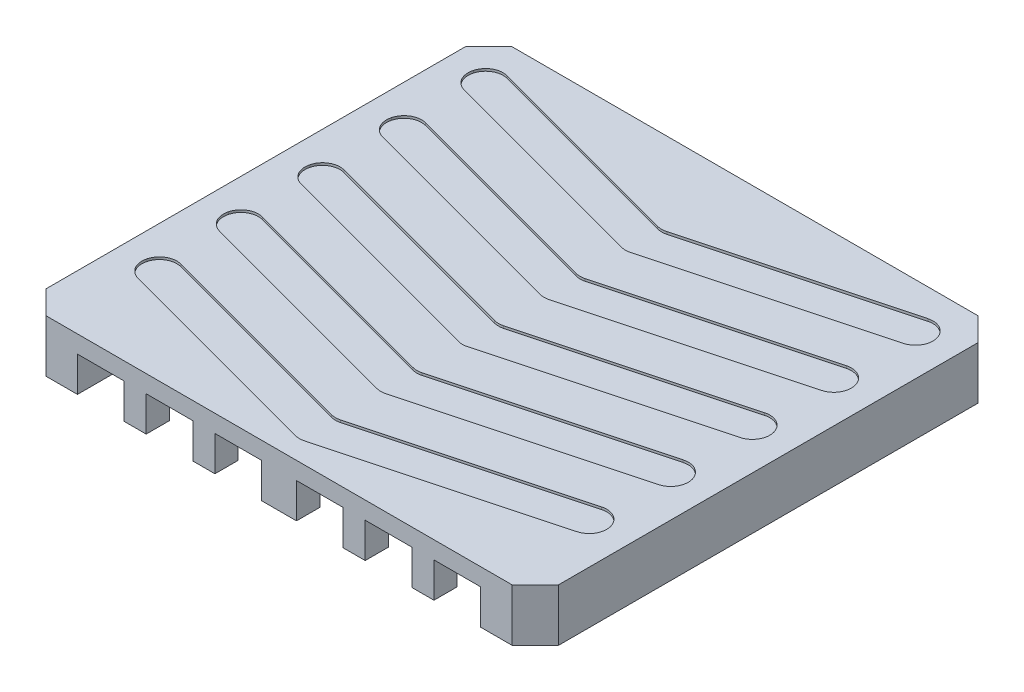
ISO-10303-21;
HEADER;
FILE_DESCRIPTION(('STEP AP214'),'2;1');
FILE_NAME('part.step','',(''),(''),'','','');
FILE_SCHEMA(('AUTOMOTIVE_DESIGN { 1 0 10303 214 1 1 1 1 }'));
ENDSEC;
DATA;
#1=APPLICATION_CONTEXT('core data for automotive mechanical design processes');
#2=APPLICATION_PROTOCOL_DEFINITION('international standard','automotive_design',2000,#1);
#3=PRODUCT_CONTEXT('',#1,'mechanical');
#4=PRODUCT('Part','Part','',(#3));
#5=PRODUCT_RELATED_PRODUCT_CATEGORY('part','',(#4));
#6=PRODUCT_DEFINITION_FORMATION('','',#4);
#7=PRODUCT_DEFINITION_CONTEXT('part definition',#1,'design');
#8=PRODUCT_DEFINITION('design','',#6,#7);
#9=PRODUCT_DEFINITION_SHAPE('','',#8);
#10=(LENGTH_UNIT() NAMED_UNIT(*) SI_UNIT(.MILLI.,.METRE.));
#11=(NAMED_UNIT(*) PLANE_ANGLE_UNIT() SI_UNIT($,.RADIAN.));
#12=(NAMED_UNIT(*) SI_UNIT($,.STERADIAN.) SOLID_ANGLE_UNIT());
#13=UNCERTAINTY_MEASURE_WITH_UNIT(LENGTH_MEASURE(1.E-05),#10,'distance_accuracy_value','');
#14=(GEOMETRIC_REPRESENTATION_CONTEXT(3) GLOBAL_UNCERTAINTY_ASSIGNED_CONTEXT((#13)) GLOBAL_UNIT_ASSIGNED_CONTEXT((#10,
#11,#12)) REPRESENTATION_CONTEXT('',''));
#15=CARTESIAN_POINT('',(0.,0.,0.));
#16=DIRECTION('',(0.,0.,1.));
#17=DIRECTION('',(1.,0.,0.));
#18=AXIS2_PLACEMENT_3D('',#15,#16,#17);
#19=CARTESIAN_POINT('',(0.,0.,0.));
#20=DIRECTION('',(0.,1.,0.));
#21=DIRECTION('',(0.,0.,1.));
#22=AXIS2_PLACEMENT_3D('',#19,#20,#21);
#23=PLANE('',#22);
#24=DIRECTION('',(1.,0.,0.));
#25=VECTOR('',#24,1.);
#26=CARTESIAN_POINT('',(-22.,0.,20.));
#27=LINE('',#26,#25);
#28=CARTESIAN_POINT('',(-7.4,0.,20.));
#29=VERTEX_POINT('',#28);
#30=CARTESIAN_POINT('',(-5.5,0.,20.));
#31=VERTEX_POINT('',#30);
#32=EDGE_CURVE('E1467',#29,#31,#27,.T.);
#33=ORIENTED_EDGE('',*,*,#32,.F.);
#34=DIRECTION('',(0.,0.,1.));
#35=VECTOR('',#34,1.);
#36=CARTESIAN_POINT('',(-7.4,0.,20.));
#37=LINE('',#36,#35);
#38=CARTESIAN_POINT('',(-7.4,0.,18.));
#39=VERTEX_POINT('',#38);
#40=EDGE_CURVE('E705',#39,#29,#37,.T.);
#41=ORIENTED_EDGE('',*,*,#40,.F.);
#42=DIRECTION('',(-1.,0.,0.));
#43=VECTOR('',#42,1.);
#44=CARTESIAN_POINT('',(-17.3,0.,18.));
#45=LINE('',#44,#43);
#46=CARTESIAN_POINT('',(-5.5,0.,18.));
#47=VERTEX_POINT('',#46);
#48=EDGE_CURVE('E993',#47,#39,#45,.T.);
#49=ORIENTED_EDGE('',*,*,#48,.F.);
#50=DIRECTION('',(0.,0.,-1.));
#51=VECTOR('',#50,1.);
#52=CARTESIAN_POINT('',(-5.5,0.,20.));
#53=LINE('',#52,#51);
#54=EDGE_CURVE('E728',#31,#47,#53,.T.);
#55=ORIENTED_EDGE('',*,*,#54,.F.);
#56=EDGE_LOOP('',(#33,#41,#49,#55));
#57=FACE_BOUND('',#56,.T.);
#58=ADVANCED_FACE('F34',(#57),#23,.F.);
#59=CARTESIAN_POINT('',(-1.5,0.,20.));
#60=VERTEX_POINT('',#59);
#61=CARTESIAN_POINT('',(1.5,0.,20.));
#62=VERTEX_POINT('',#61);
#63=EDGE_CURVE('E1512',#60,#62,#27,.T.);
#64=ORIENTED_EDGE('',*,*,#63,.F.);
#65=DIRECTION('',(0.,0.,1.));
#66=VECTOR('',#65,1.);
#67=CARTESIAN_POINT('',(-1.5,0.,20.));
#68=LINE('',#67,#66);
#69=CARTESIAN_POINT('',(-1.5,0.,18.));
#70=VERTEX_POINT('',#69);
#71=EDGE_CURVE('E722',#70,#60,#68,.T.);
#72=ORIENTED_EDGE('',*,*,#71,.F.);
#73=CARTESIAN_POINT('',(1.5,0.,18.));
#74=VERTEX_POINT('',#73);
#75=EDGE_CURVE('E1470',#74,#70,#45,.T.);
#76=ORIENTED_EDGE('',*,*,#75,.F.);
#77=DIRECTION('',(0.,0.,-1.));
#78=VECTOR('',#77,1.);
#79=CARTESIAN_POINT('',(1.5,0.,20.));
#80=LINE('',#79,#78);
#81=EDGE_CURVE('E752',#62,#74,#80,.T.);
#82=ORIENTED_EDGE('',*,*,#81,.F.);
#83=EDGE_LOOP('',(#64,#72,#76,#82));
#84=FACE_BOUND('',#83,.T.);
#85=ADVANCED_FACE('F1579',(#84),#23,.F.);
#86=CARTESIAN_POINT('',(-11.4,0.,18.));
#87=VERTEX_POINT('',#86);
#88=CARTESIAN_POINT('',(-13.3,0.,18.));
#89=VERTEX_POINT('',#88);
#90=EDGE_CURVE('E991',#87,#89,#45,.T.);
#91=ORIENTED_EDGE('',*,*,#90,.F.);
#92=DIRECTION('',(0.,0.,-1.));
#93=VECTOR('',#92,1.);
#94=CARTESIAN_POINT('',(-11.4,0.,20.));
#95=LINE('',#94,#93);
#96=CARTESIAN_POINT('',(-11.4,0.,20.));
#97=VERTEX_POINT('',#96);
#98=EDGE_CURVE('E735',#97,#87,#95,.T.);
#99=ORIENTED_EDGE('',*,*,#98,.F.);
#100=CARTESIAN_POINT('',(-13.3,0.,20.));
#101=VERTEX_POINT('',#100);
#102=EDGE_CURVE('E711',#101,#97,#27,.T.);
#103=ORIENTED_EDGE('',*,*,#102,.F.);
#104=DIRECTION('',(0.,0.,1.));
#105=VECTOR('',#104,1.);
#106=CARTESIAN_POINT('',(-13.3,0.,20.));
#107=LINE('',#106,#105);
#108=EDGE_CURVE('E922',#89,#101,#107,.T.);
#109=ORIENTED_EDGE('',*,*,#108,.F.);
#110=EDGE_LOOP('',(#91,#99,#103,#109));
#111=FACE_BOUND('',#110,.T.);
#112=ADVANCED_FACE('F1576',(#111),#23,.F.);
#113=CARTESIAN_POINT('',(5.5,0.,20.));
#114=VERTEX_POINT('',#113);
#115=CARTESIAN_POINT('',(7.4,0.,20.));
#116=VERTEX_POINT('',#115);
#117=EDGE_CURVE('E1514',#114,#116,#27,.T.);
#118=ORIENTED_EDGE('',*,*,#117,.F.);
#119=DIRECTION('',(0.,0.,1.));
#120=VECTOR('',#119,1.);
#121=CARTESIAN_POINT('',(5.5,0.,20.));
#122=LINE('',#121,#120);
#123=CARTESIAN_POINT('',(5.5,0.,18.));
#124=VERTEX_POINT('',#123);
#125=EDGE_CURVE('E745',#124,#114,#122,.T.);
#126=ORIENTED_EDGE('',*,*,#125,.F.);
#127=CARTESIAN_POINT('',(7.4,0.,18.));
#128=VERTEX_POINT('',#127);
#129=EDGE_CURVE('E1472',#128,#124,#45,.T.);
#130=ORIENTED_EDGE('',*,*,#129,.F.);
#131=DIRECTION('',(0.,0.,-1.));
#132=VECTOR('',#131,1.);
#133=CARTESIAN_POINT('',(7.4,0.,20.));
#134=LINE('',#133,#132);
#135=EDGE_CURVE('E774',#116,#128,#134,.T.);
#136=ORIENTED_EDGE('',*,*,#135,.F.);
#137=EDGE_LOOP('',(#118,#126,#130,#136));
#138=FACE_BOUND('',#137,.T.);
#139=ADVANCED_FACE('F1578',(#138),#23,.F.);
#140=CARTESIAN_POINT('',(11.4,0.,20.));
#141=VERTEX_POINT('',#140);
#142=CARTESIAN_POINT('',(13.3,0.,20.));
#143=VERTEX_POINT('',#142);
#144=EDGE_CURVE('E1494',#141,#143,#27,.T.);
#145=ORIENTED_EDGE('',*,*,#144,.F.);
#146=DIRECTION('',(0.,0.,1.));
#147=VECTOR('',#146,1.);
#148=CARTESIAN_POINT('',(11.4,0.,20.));
#149=LINE('',#148,#147);
#150=CARTESIAN_POINT('',(11.4,0.,18.));
#151=VERTEX_POINT('',#150);
#152=EDGE_CURVE('E767',#151,#141,#149,.T.);
#153=ORIENTED_EDGE('',*,*,#152,.F.);
#154=CARTESIAN_POINT('',(13.3,0.,18.));
#155=VERTEX_POINT('',#154);
#156=EDGE_CURVE('E972',#155,#151,#45,.T.);
#157=ORIENTED_EDGE('',*,*,#156,.F.);
#158=DIRECTION('',(0.,0.,-1.));
#159=VECTOR('',#158,1.);
#160=CARTESIAN_POINT('',(13.3,0.,20.));
#161=LINE('',#160,#159);
#162=EDGE_CURVE('E789',#143,#155,#161,.T.);
#163=ORIENTED_EDGE('',*,*,#162,.F.);
#164=EDGE_LOOP('',(#145,#153,#157,#163));
#165=FACE_BOUND('',#164,.T.);
#166=ADVANCED_FACE('F1492',(#165),#23,.F.);
#167=DIRECTION('',(-1.,0.,0.));
#168=VECTOR('',#167,1.);
#169=CARTESIAN_POINT('',(-22.,0.,-20.));
#170=LINE('',#169,#168);
#171=CARTESIAN_POINT('',(-3.69999999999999,0.,-20.));
#172=VERTEX_POINT('',#171);
#173=CARTESIAN_POINT('',(-8.15,0.,-20.));
#174=VERTEX_POINT('',#173);
#175=EDGE_CURVE('E1637',#172,#174,#170,.T.);
#176=ORIENTED_EDGE('',*,*,#175,.F.);
#177=DIRECTION('',(0.,0.,-1.));
#178=VECTOR('',#177,1.);
#179=CARTESIAN_POINT('',(-3.69999999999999,0.,-18.));
#180=LINE('',#179,#178);
#181=CARTESIAN_POINT('',(-3.69999999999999,0.,-18.));
#182=VERTEX_POINT('',#181);
#183=EDGE_CURVE('E811',#182,#172,#180,.T.);
#184=ORIENTED_EDGE('',*,*,#183,.F.);
#185=DIRECTION('',(1.,0.,0.));
#186=VECTOR('',#185,1.);
#187=CARTESIAN_POINT('',(17.3,0.,-18.));
#188=LINE('',#187,#186);
#189=CARTESIAN_POINT('',(-8.15,0.,-18.));
#190=VERTEX_POINT('',#189);
#191=EDGE_CURVE('E2635',#190,#182,#188,.T.);
#192=ORIENTED_EDGE('',*,*,#191,.F.);
#193=DIRECTION('',(0.,0.,1.));
#194=VECTOR('',#193,1.);
#195=CARTESIAN_POINT('',(-8.15,0.,-18.));
#196=LINE('',#195,#194);
#197=EDGE_CURVE('E827',#174,#190,#196,.T.);
#198=ORIENTED_EDGE('',*,*,#197,.F.);
#199=EDGE_LOOP('',(#176,#184,#192,#198));
#200=FACE_BOUND('',#199,.T.);
#201=ADVANCED_FACE('F2524',(#200),#23,.F.);
#202=CARTESIAN_POINT('',(-10.65,0.,-20.));
#203=VERTEX_POINT('',#202);
#204=CARTESIAN_POINT('',(-15.1,0.,-20.));
#205=VERTEX_POINT('',#204);
#206=EDGE_CURVE('E1641',#203,#205,#170,.T.);
#207=ORIENTED_EDGE('',*,*,#206,.F.);
#208=DIRECTION('',(0.,0.,-1.));
#209=VECTOR('',#208,1.);
#210=CARTESIAN_POINT('',(-10.65,0.,-18.));
#211=LINE('',#210,#209);
#212=CARTESIAN_POINT('',(-10.65,0.,-18.));
#213=VERTEX_POINT('',#212);
#214=EDGE_CURVE('E833',#213,#203,#211,.T.);
#215=ORIENTED_EDGE('',*,*,#214,.F.);
#216=CARTESIAN_POINT('',(-15.1,0.,-18.));
#217=VERTEX_POINT('',#216);
#218=EDGE_CURVE('E988',#217,#213,#188,.T.);
#219=ORIENTED_EDGE('',*,*,#218,.F.);
#220=DIRECTION('',(0.,0.,1.));
#221=VECTOR('',#220,1.);
#222=CARTESIAN_POINT('',(-15.1,0.,-18.));
#223=LINE('',#222,#221);
#224=EDGE_CURVE('E849',#205,#217,#223,.T.);
#225=ORIENTED_EDGE('',*,*,#224,.F.);
#226=EDGE_LOOP('',(#207,#215,#219,#225));
#227=FACE_BOUND('',#226,.T.);
#228=ADVANCED_FACE('F1652',(#227),#23,.F.);
#229=CARTESIAN_POINT('',(-19.3,0.,15.));
#230=DIRECTION('',(0.,-1.,0.));
#231=DIRECTION('',(0.,0.,-1.));
#232=AXIS2_PLACEMENT_3D('',#229,#230,#231);
#233=CIRCLE('',#232,1.);
#234=CARTESIAN_POINT('',(-19.3,0.,14.));
#235=VERTEX_POINT('',#234);
#236=EDGE_CURVE('E1441',#235,#235,#233,.T.);
#237=ORIENTED_EDGE('',*,*,#236,.F.);
#238=EDGE_LOOP('',(#237));
#239=FACE_BOUND('',#238,.T.);
#240=CARTESIAN_POINT('',(-19.3,0.,-12.));
#241=DIRECTION('',(0.,-1.,0.));
#242=DIRECTION('',(0.,0.,-1.));
#243=AXIS2_PLACEMENT_3D('',#240,#241,#242);
#244=CIRCLE('',#243,1.);
#245=CARTESIAN_POINT('',(-19.3,0.,-13.));
#246=VERTEX_POINT('',#245);
#247=EDGE_CURVE('E1420',#246,#246,#244,.T.);
#248=ORIENTED_EDGE('',*,*,#247,.F.);
#249=EDGE_LOOP('',(#248));
#250=FACE_BOUND('',#249,.T.);
#251=CARTESIAN_POINT('',(-17.3,0.,-20.));
#252=VERTEX_POINT('',#251);
#253=CARTESIAN_POINT('',(-20.,0.,-20.));
#254=VERTEX_POINT('',#253);
#255=EDGE_CURVE('E1011',#252,#254,#170,.T.);
#256=ORIENTED_EDGE('',*,*,#255,.F.);
#257=DIRECTION('',(0.,0.,-1.));
#258=VECTOR('',#257,1.);
#259=CARTESIAN_POINT('',(-17.3,0.,18.));
#260=LINE('',#259,#258);
#261=CARTESIAN_POINT('',(-17.3,0.,20.));
#262=VERTEX_POINT('',#261);
#263=EDGE_CURVE('E962',#262,#252,#260,.T.);
#264=ORIENTED_EDGE('',*,*,#263,.F.);
#265=CARTESIAN_POINT('',(-20.,0.,20.));
#266=VERTEX_POINT('',#265);
#267=EDGE_CURVE('E998',#266,#262,#27,.T.);
#268=ORIENTED_EDGE('',*,*,#267,.F.);
#269=DIRECTION('',(0.707106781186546,0.,0.707106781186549));
#270=VECTOR('',#269,1.);
#271=CARTESIAN_POINT('',(-20.,0.,20.));
#272=LINE('',#271,#270);
#273=CARTESIAN_POINT('',(-22.,0.,18.));
#274=VERTEX_POINT('',#273);
#275=EDGE_CURVE('E1026',#266,#274,#272,.F.);
#276=ORIENTED_EDGE('',*,*,#275,.T.);
#277=DIRECTION('',(0.,0.,1.));
#278=VECTOR('',#277,1.);
#279=CARTESIAN_POINT('',(-22.,0.,-20.));
#280=LINE('',#279,#278);
#281=CARTESIAN_POINT('',(-22.,0.,-18.));
#282=VERTEX_POINT('',#281);
#283=EDGE_CURVE('E1015',#282,#274,#280,.T.);
#284=ORIENTED_EDGE('',*,*,#283,.F.);
#285=DIRECTION('',(-0.707106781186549,0.,0.707106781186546));
#286=VECTOR('',#285,1.);
#287=CARTESIAN_POINT('',(-22.,0.,-18.));
#288=LINE('',#287,#286);
#289=EDGE_CURVE('E1033',#282,#254,#288,.F.);
#290=ORIENTED_EDGE('',*,*,#289,.T.);
#291=EDGE_LOOP('',(#256,#264,#268,#276,#284,#290));
#292=FACE_BOUND('',#291,.T.);
#293=ADVANCED_FACE('F1562',(#239,#250,#292),#23,.F.);
#294=CARTESIAN_POINT('',(19.3,0.,-12.));
#295=DIRECTION('',(0.,-1.,0.));
#296=DIRECTION('',(0.,0.,-1.));
#297=AXIS2_PLACEMENT_3D('',#294,#295,#296);
#298=CIRCLE('',#297,1.);
#299=CARTESIAN_POINT('',(19.3,0.,-13.));
#300=VERTEX_POINT('',#299);
#301=EDGE_CURVE('E1435',#300,#300,#298,.T.);
#302=ORIENTED_EDGE('',*,*,#301,.F.);
#303=EDGE_LOOP('',(#302));
#304=FACE_BOUND('',#303,.T.);
#305=CARTESIAN_POINT('',(19.3,0.,15.));
#306=DIRECTION('',(0.,-1.,0.));
#307=DIRECTION('',(0.,0.,-1.));
#308=AXIS2_PLACEMENT_3D('',#305,#306,#307);
#309=CIRCLE('',#308,1.);
#310=CARTESIAN_POINT('',(19.3,0.,14.));
#311=VERTEX_POINT('',#310);
#312=EDGE_CURVE('E1434',#311,#311,#309,.T.);
#313=ORIENTED_EDGE('',*,*,#312,.F.);
#314=EDGE_LOOP('',(#313));
#315=FACE_BOUND('',#314,.T.);
#316=CARTESIAN_POINT('',(17.3,0.,20.));
#317=VERTEX_POINT('',#316);
#318=CARTESIAN_POINT('',(20.,0.,20.));
#319=VERTEX_POINT('',#318);
#320=EDGE_CURVE('E1019',#317,#319,#27,.T.);
#321=ORIENTED_EDGE('',*,*,#320,.F.);
#322=DIRECTION('',(0.,0.,1.));
#323=VECTOR('',#322,1.);
#324=CARTESIAN_POINT('',(17.3,0.,18.));
#325=LINE('',#324,#323);
#326=CARTESIAN_POINT('',(17.3,0.,-20.));
#327=VERTEX_POINT('',#326);
#328=EDGE_CURVE('E989',#327,#317,#325,.T.);
#329=ORIENTED_EDGE('',*,*,#328,.F.);
#330=CARTESIAN_POINT('',(20.,0.,-20.));
#331=VERTEX_POINT('',#330);
#332=EDGE_CURVE('E1012',#331,#327,#170,.T.);
#333=ORIENTED_EDGE('',*,*,#332,.F.);
#334=DIRECTION('',(-0.707106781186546,0.,-0.707106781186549));
#335=VECTOR('',#334,1.);
#336=CARTESIAN_POINT('',(20.,0.,-20.));
#337=LINE('',#336,#335);
#338=CARTESIAN_POINT('',(22.,0.,-18.));
#339=VERTEX_POINT('',#338);
#340=EDGE_CURVE('E1031',#331,#339,#337,.F.);
#341=ORIENTED_EDGE('',*,*,#340,.T.);
#342=DIRECTION('',(0.,0.,-1.));
#343=VECTOR('',#342,1.);
#344=CARTESIAN_POINT('',(22.,0.,-20.));
#345=LINE('',#344,#343);
#346=CARTESIAN_POINT('',(22.,0.,18.));
#347=VERTEX_POINT('',#346);
#348=EDGE_CURVE('E1008',#347,#339,#345,.T.);
#349=ORIENTED_EDGE('',*,*,#348,.F.);
#350=DIRECTION('',(0.707106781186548,0.,-0.707106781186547));
#351=VECTOR('',#350,1.);
#352=CARTESIAN_POINT('',(22.,0.,18.));
#353=LINE('',#352,#351);
#354=EDGE_CURVE('E1028',#347,#319,#353,.F.);
#355=ORIENTED_EDGE('',*,*,#354,.T.);
#356=EDGE_LOOP('',(#321,#329,#333,#341,#349,#355));
#357=FACE_BOUND('',#356,.T.);
#358=ADVANCED_FACE('F1525',(#304,#315,#357),#23,.F.);
#359=CARTESIAN_POINT('',(15.1,0.,-20.));
#360=VERTEX_POINT('',#359);
#361=CARTESIAN_POINT('',(10.65,0.,-20.));
#362=VERTEX_POINT('',#361);
#363=EDGE_CURVE('E1016',#360,#362,#170,.T.);
#364=ORIENTED_EDGE('',*,*,#363,.F.);
#365=DIRECTION('',(0.,0.,-1.));
#366=VECTOR('',#365,1.);
#367=CARTESIAN_POINT('',(15.1,0.,-18.));
#368=LINE('',#367,#366);
#369=CARTESIAN_POINT('',(15.1,0.,-18.));
#370=VERTEX_POINT('',#369);
#371=EDGE_CURVE('E864',#370,#360,#368,.T.);
#372=ORIENTED_EDGE('',*,*,#371,.F.);
#373=CARTESIAN_POINT('',(10.65,0.,-18.));
#374=VERTEX_POINT('',#373);
#375=EDGE_CURVE('E984',#374,#370,#188,.T.);
#376=ORIENTED_EDGE('',*,*,#375,.F.);
#377=DIRECTION('',(0.,0.,1.));
#378=VECTOR('',#377,1.);
#379=CARTESIAN_POINT('',(10.65,0.,-18.));
#380=LINE('',#379,#378);
#381=EDGE_CURVE('E880',#362,#374,#380,.T.);
#382=ORIENTED_EDGE('',*,*,#381,.F.);
#383=EDGE_LOOP('',(#364,#372,#376,#382));
#384=FACE_BOUND('',#383,.T.);
#385=ADVANCED_FACE('F1617',(#384),#23,.F.);
#386=CARTESIAN_POINT('',(8.15,0.,-20.));
#387=VERTEX_POINT('',#386);
#388=CARTESIAN_POINT('',(3.69999999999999,0.,-20.));
#389=VERTEX_POINT('',#388);
#390=EDGE_CURVE('E1630',#387,#389,#170,.T.);
#391=ORIENTED_EDGE('',*,*,#390,.F.);
#392=DIRECTION('',(0.,0.,-1.));
#393=VECTOR('',#392,1.);
#394=CARTESIAN_POINT('',(8.15,0.,-18.));
#395=LINE('',#394,#393);
#396=CARTESIAN_POINT('',(8.15,0.,-18.));
#397=VERTEX_POINT('',#396);
#398=EDGE_CURVE('E885',#397,#387,#395,.T.);
#399=ORIENTED_EDGE('',*,*,#398,.F.);
#400=CARTESIAN_POINT('',(3.69999999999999,0.,-18.));
#401=VERTEX_POINT('',#400);
#402=EDGE_CURVE('E987',#401,#397,#188,.T.);
#403=ORIENTED_EDGE('',*,*,#402,.F.);
#404=DIRECTION('',(0.,0.,1.));
#405=VECTOR('',#404,1.);
#406=CARTESIAN_POINT('',(3.69999999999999,0.,-18.));
#407=LINE('',#406,#405);
#408=EDGE_CURVE('E901',#389,#401,#407,.T.);
#409=ORIENTED_EDGE('',*,*,#408,.F.);
#410=EDGE_LOOP('',(#391,#399,#403,#409));
#411=FACE_BOUND('',#410,.T.);
#412=ADVANCED_FACE('F1606',(#411),#23,.F.);
#413=CARTESIAN_POINT('',(-17.3,3.,18.));
#414=DIRECTION('',(0.,0.,1.));
#415=DIRECTION('',(1.,0.,0.));
#416=AXIS2_PLACEMENT_3D('',#413,#414,#415);
#417=PLANE('',#416);
#418=ORIENTED_EDGE('',*,*,#48,.T.);
#419=DIRECTION('',(0.,-1.,0.));
#420=VECTOR('',#419,1.);
#421=CARTESIAN_POINT('',(-7.4,3.,18.));
#422=LINE('',#421,#420);
#423=CARTESIAN_POINT('',(-7.4,3.,18.));
#424=VERTEX_POINT('',#423);
#425=EDGE_CURVE('E713',#424,#39,#422,.T.);
#426=ORIENTED_EDGE('',*,*,#425,.F.);
#427=DIRECTION('',(-1.,0.,0.));
#428=VECTOR('',#427,1.);
#429=CARTESIAN_POINT('',(-17.3,3.,18.));
#430=LINE('',#429,#428);
#431=CARTESIAN_POINT('',(-5.5,3.,18.));
#432=VERTEX_POINT('',#431);
#433=EDGE_CURVE('E981',#432,#424,#430,.T.);
#434=ORIENTED_EDGE('',*,*,#433,.F.);
#435=DIRECTION('',(0.,-1.,0.));
#436=VECTOR('',#435,1.);
#437=CARTESIAN_POINT('',(-5.5,3.,18.));
#438=LINE('',#437,#436);
#439=EDGE_CURVE('E738',#432,#47,#438,.T.);
#440=ORIENTED_EDGE('',*,*,#439,.T.);
#441=EDGE_LOOP('',(#418,#426,#434,#440));
#442=FACE_BOUND('',#441,.T.);
#443=ADVANCED_FACE('F1468',(#442),#417,.F.);
#444=ORIENTED_EDGE('',*,*,#75,.T.);
#445=DIRECTION('',(0.,-1.,0.));
#446=VECTOR('',#445,1.);
#447=CARTESIAN_POINT('',(-1.5,3.,18.));
#448=LINE('',#447,#446);
#449=CARTESIAN_POINT('',(-1.5,3.,18.));
#450=VERTEX_POINT('',#449);
#451=EDGE_CURVE('E736',#450,#70,#448,.T.);
#452=ORIENTED_EDGE('',*,*,#451,.F.);
#453=CARTESIAN_POINT('',(1.5,3.,18.));
#454=VERTEX_POINT('',#453);
#455=EDGE_CURVE('E1504',#454,#450,#430,.T.);
#456=ORIENTED_EDGE('',*,*,#455,.F.);
#457=DIRECTION('',(0.,-1.,0.));
#458=VECTOR('',#457,1.);
#459=CARTESIAN_POINT('',(1.5,3.,18.));
#460=LINE('',#459,#458);
#461=EDGE_CURVE('E751',#454,#74,#460,.T.);
#462=ORIENTED_EDGE('',*,*,#461,.T.);
#463=EDGE_LOOP('',(#444,#452,#456,#462));
#464=FACE_BOUND('',#463,.T.);
#465=ADVANCED_FACE('F1623',(#464),#417,.F.);
#466=CARTESIAN_POINT('',(-11.4,3.,18.));
#467=VERTEX_POINT('',#466);
#468=CARTESIAN_POINT('',(-13.3,3.,18.));
#469=VERTEX_POINT('',#468);
#470=EDGE_CURVE('E979',#467,#469,#430,.T.);
#471=ORIENTED_EDGE('',*,*,#470,.F.);
#472=DIRECTION('',(0.,-1.,0.));
#473=VECTOR('',#472,1.);
#474=CARTESIAN_POINT('',(-11.4,3.,18.));
#475=LINE('',#474,#473);
#476=EDGE_CURVE('E693',#467,#87,#475,.T.);
#477=ORIENTED_EDGE('',*,*,#476,.T.);
#478=ORIENTED_EDGE('',*,*,#90,.T.);
#479=DIRECTION('',(0.,-1.,0.));
#480=VECTOR('',#479,1.);
#481=CARTESIAN_POINT('',(-13.3,3.,18.));
#482=LINE('',#481,#480);
#483=EDGE_CURVE('E925',#469,#89,#482,.T.);
#484=ORIENTED_EDGE('',*,*,#483,.F.);
#485=EDGE_LOOP('',(#471,#477,#478,#484));
#486=FACE_BOUND('',#485,.T.);
#487=ADVANCED_FACE('F1573',(#486),#417,.F.);
#488=ORIENTED_EDGE('',*,*,#129,.T.);
#489=DIRECTION('',(0.,-1.,0.));
#490=VECTOR('',#489,1.);
#491=CARTESIAN_POINT('',(5.5,3.,18.));
#492=LINE('',#491,#490);
#493=CARTESIAN_POINT('',(5.5,3.,18.));
#494=VERTEX_POINT('',#493);
#495=EDGE_CURVE('E760',#494,#124,#492,.T.);
#496=ORIENTED_EDGE('',*,*,#495,.F.);
#497=CARTESIAN_POINT('',(7.4,3.,18.));
#498=VERTEX_POINT('',#497);
#499=EDGE_CURVE('E1503',#498,#494,#430,.T.);
#500=ORIENTED_EDGE('',*,*,#499,.F.);
#501=DIRECTION('',(0.,-1.,0.));
#502=VECTOR('',#501,1.);
#503=CARTESIAN_POINT('',(7.4,3.,18.));
#504=LINE('',#503,#502);
#505=EDGE_CURVE('E773',#498,#128,#504,.T.);
#506=ORIENTED_EDGE('',*,*,#505,.T.);
#507=EDGE_LOOP('',(#488,#496,#500,#506));
#508=FACE_BOUND('',#507,.T.);
#509=ADVANCED_FACE('F1756',(#508),#417,.F.);
#510=CARTESIAN_POINT('',(17.3,3.,-18.));
#511=DIRECTION('',(0.,0.,-1.));
#512=DIRECTION('',(-1.,0.,0.));
#513=AXIS2_PLACEMENT_3D('',#510,#511,#512);
#514=PLANE('',#513);
#515=ORIENTED_EDGE('',*,*,#191,.T.);
#516=DIRECTION('',(0.,-1.,0.));
#517=VECTOR('',#516,1.);
#518=CARTESIAN_POINT('',(-3.69999999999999,3.,-18.));
#519=LINE('',#518,#517);
#520=CARTESIAN_POINT('',(-3.69999999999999,3.,-18.));
#521=VERTEX_POINT('',#520);
#522=EDGE_CURVE('E794',#521,#182,#519,.T.);
#523=ORIENTED_EDGE('',*,*,#522,.F.);
#524=DIRECTION('',(1.,0.,0.));
#525=VECTOR('',#524,1.);
#526=CARTESIAN_POINT('',(17.3,3.,-18.));
#527=LINE('',#526,#525);
#528=CARTESIAN_POINT('',(-8.14999999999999,3.,-18.));
#529=VERTEX_POINT('',#528);
#530=EDGE_CURVE('E1663',#529,#521,#527,.T.);
#531=ORIENTED_EDGE('',*,*,#530,.F.);
#532=DIRECTION('',(0.,-1.,0.));
#533=VECTOR('',#532,1.);
#534=CARTESIAN_POINT('',(-8.15,3.,-18.));
#535=LINE('',#534,#533);
#536=EDGE_CURVE('E838',#529,#190,#535,.T.);
#537=ORIENTED_EDGE('',*,*,#536,.T.);
#538=EDGE_LOOP('',(#515,#523,#531,#537));
#539=FACE_BOUND('',#538,.T.);
#540=ADVANCED_FACE('F1762',(#539),#514,.F.);
#541=ORIENTED_EDGE('',*,*,#218,.T.);
#542=DIRECTION('',(0.,-1.,0.));
#543=VECTOR('',#542,1.);
#544=CARTESIAN_POINT('',(-10.65,3.,-18.));
#545=LINE('',#544,#543);
#546=CARTESIAN_POINT('',(-10.65,3.,-18.));
#547=VERTEX_POINT('',#546);
#548=EDGE_CURVE('E813',#547,#213,#545,.T.);
#549=ORIENTED_EDGE('',*,*,#548,.F.);
#550=CARTESIAN_POINT('',(-15.1,3.,-18.));
#551=VERTEX_POINT('',#550);
#552=EDGE_CURVE('E976',#551,#547,#527,.T.);
#553=ORIENTED_EDGE('',*,*,#552,.F.);
#554=DIRECTION('',(0.,-1.,0.));
#555=VECTOR('',#554,1.);
#556=CARTESIAN_POINT('',(-15.1,3.,-18.));
#557=LINE('',#556,#555);
#558=EDGE_CURVE('E835',#551,#217,#557,.T.);
#559=ORIENTED_EDGE('',*,*,#558,.T.);
#560=EDGE_LOOP('',(#541,#549,#553,#559));
#561=FACE_BOUND('',#560,.T.);
#562=ADVANCED_FACE('F1660',(#561),#514,.F.);
#563=ORIENTED_EDGE('',*,*,#375,.T.);
#564=DIRECTION('',(0.,-1.,0.));
#565=VECTOR('',#564,1.);
#566=CARTESIAN_POINT('',(15.1,3.,-18.));
#567=LINE('',#566,#565);
#568=CARTESIAN_POINT('',(15.1,3.,-18.));
#569=VERTEX_POINT('',#568);
#570=EDGE_CURVE('E867',#569,#370,#567,.T.);
#571=ORIENTED_EDGE('',*,*,#570,.F.);
#572=CARTESIAN_POINT('',(10.65,3.,-18.));
#573=VERTEX_POINT('',#572);
#574=EDGE_CURVE('E971',#573,#569,#527,.T.);
#575=ORIENTED_EDGE('',*,*,#574,.F.);
#576=DIRECTION('',(0.,-1.,0.));
#577=VECTOR('',#576,1.);
#578=CARTESIAN_POINT('',(10.65,3.,-18.));
#579=LINE('',#578,#577);
#580=EDGE_CURVE('E869',#573,#374,#579,.T.);
#581=ORIENTED_EDGE('',*,*,#580,.T.);
#582=EDGE_LOOP('',(#563,#571,#575,#581));
#583=FACE_BOUND('',#582,.T.);
#584=ADVANCED_FACE('F1689',(#583),#514,.F.);
#585=ORIENTED_EDGE('',*,*,#402,.T.);
#586=DIRECTION('',(0.,-1.,0.));
#587=VECTOR('',#586,1.);
#588=CARTESIAN_POINT('',(8.15,3.,-18.));
#589=LINE('',#588,#587);
#590=CARTESIAN_POINT('',(8.15,3.,-18.));
#591=VERTEX_POINT('',#590);
#592=EDGE_CURVE('E884',#591,#397,#589,.T.);
#593=ORIENTED_EDGE('',*,*,#592,.F.);
#594=CARTESIAN_POINT('',(3.69999999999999,3.,-18.));
#595=VERTEX_POINT('',#594);
#596=EDGE_CURVE('E975',#595,#591,#527,.T.);
#597=ORIENTED_EDGE('',*,*,#596,.F.);
#598=DIRECTION('',(0.,-1.,0.));
#599=VECTOR('',#598,1.);
#600=CARTESIAN_POINT('',(3.69999999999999,3.,-18.));
#601=LINE('',#600,#599);
#602=EDGE_CURVE('E887',#595,#401,#601,.T.);
#603=ORIENTED_EDGE('',*,*,#602,.T.);
#604=EDGE_LOOP('',(#585,#593,#597,#603));
#605=FACE_BOUND('',#604,.T.);
#606=ADVANCED_FACE('F1676',(#605),#514,.F.);
#607=CARTESIAN_POINT('',(22.,4.5,-20.));
#608=DIRECTION('',(-1.,0.,0.));
#609=DIRECTION('',(0.,0.,1.));
#610=AXIS2_PLACEMENT_3D('',#607,#608,#609);
#611=PLANE('',#610);
#612=ORIENTED_EDGE('',*,*,#348,.T.);
#613=DIRECTION('',(0.,1.,0.));
#614=VECTOR('',#613,1.);
#615=CARTESIAN_POINT('',(22.,4.5,-18.));
#616=LINE('',#615,#614);
#617=CARTESIAN_POINT('',(22.,4.5,-18.));
#618=VERTEX_POINT('',#617);
#619=EDGE_CURVE('E1052',#339,#618,#616,.T.);
#620=ORIENTED_EDGE('',*,*,#619,.T.);
#621=DIRECTION('',(0.,0.,-1.));
#622=VECTOR('',#621,1.);
#623=CARTESIAN_POINT('',(22.,4.5,-20.));
#624=LINE('',#623,#622);
#625=CARTESIAN_POINT('',(22.,4.5,18.));
#626=VERTEX_POINT('',#625);
#627=EDGE_CURVE('E994',#626,#618,#624,.T.);
#628=ORIENTED_EDGE('',*,*,#627,.F.);
#629=DIRECTION('',(0.,-1.,0.));
#630=VECTOR('',#629,1.);
#631=CARTESIAN_POINT('',(22.,4.5,18.));
#632=LINE('',#631,#630);
#633=EDGE_CURVE('E1049',#626,#347,#632,.T.);
#634=ORIENTED_EDGE('',*,*,#633,.T.);
#635=EDGE_LOOP('',(#612,#620,#628,#634));
#636=FACE_BOUND('',#635,.T.);
#637=ADVANCED_FACE('F1534',(#636),#611,.F.);
#638=CARTESIAN_POINT('',(-22.,4.5,-20.));
#639=DIRECTION('',(0.,0.,1.));
#640=DIRECTION('',(1.,0.,0.));
#641=AXIS2_PLACEMENT_3D('',#638,#639,#640);
#642=PLANE('',#641);
#643=DIRECTION('',(1.,0.,0.));
#644=VECTOR('',#643,1.);
#645=CARTESIAN_POINT('',(-3.69999999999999,3.,-20.));
#646=LINE('',#645,#644);
#647=CARTESIAN_POINT('',(-3.69999999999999,3.,-20.));
#648=VERTEX_POINT('',#647);
#649=CARTESIAN_POINT('',(-1.49999999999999,3.,-20.));
#650=VERTEX_POINT('',#649);
#651=EDGE_CURVE('E804',#648,#650,#646,.T.);
#652=ORIENTED_EDGE('',*,*,#651,.F.);
#653=DIRECTION('',(0.,-1.,0.));
#654=VECTOR('',#653,1.);
#655=CARTESIAN_POINT('',(-3.69999999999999,3.,-20.));
#656=LINE('',#655,#654);
#657=EDGE_CURVE('E810',#648,#172,#656,.T.);
#658=ORIENTED_EDGE('',*,*,#657,.T.);
#659=ORIENTED_EDGE('',*,*,#175,.T.);
#660=DIRECTION('',(0.,-1.,0.));
#661=VECTOR('',#660,1.);
#662=CARTESIAN_POINT('',(-8.15,3.,-20.));
#663=LINE('',#662,#661);
#664=CARTESIAN_POINT('',(-8.15,3.,-20.));
#665=VERTEX_POINT('',#664);
#666=EDGE_CURVE('E841',#665,#174,#663,.T.);
#667=ORIENTED_EDGE('',*,*,#666,.F.);
#668=DIRECTION('',(1.,0.,0.));
#669=VECTOR('',#668,1.);
#670=CARTESIAN_POINT('',(-10.65,3.,-20.));
#671=LINE('',#670,#669);
#672=CARTESIAN_POINT('',(-10.65,3.,-20.));
#673=VERTEX_POINT('',#672);
#674=EDGE_CURVE('E826',#673,#665,#671,.T.);
#675=ORIENTED_EDGE('',*,*,#674,.F.);
#676=DIRECTION('',(0.,-1.,0.));
#677=VECTOR('',#676,1.);
#678=CARTESIAN_POINT('',(-10.65,3.,-20.));
#679=LINE('',#678,#677);
#680=EDGE_CURVE('E832',#673,#203,#679,.T.);
#681=ORIENTED_EDGE('',*,*,#680,.T.);
#682=ORIENTED_EDGE('',*,*,#206,.T.);
#683=DIRECTION('',(0.,-1.,0.));
#684=VECTOR('',#683,1.);
#685=CARTESIAN_POINT('',(-15.1,3.,-20.));
#686=LINE('',#685,#684);
#687=CARTESIAN_POINT('',(-15.1,3.,-20.));
#688=VERTEX_POINT('',#687);
#689=EDGE_CURVE('E856',#688,#205,#686,.T.);
#690=ORIENTED_EDGE('',*,*,#689,.F.);
#691=DIRECTION('',(1.,0.,0.));
#692=VECTOR('',#691,1.);
#693=CARTESIAN_POINT('',(-17.3,3.,-20.));
#694=LINE('',#693,#692);
#695=CARTESIAN_POINT('',(-17.3,3.,-20.));
#696=VERTEX_POINT('',#695);
#697=EDGE_CURVE('E845',#696,#688,#694,.T.);
#698=ORIENTED_EDGE('',*,*,#697,.F.);
#699=DIRECTION('',(0.,-1.,0.));
#700=VECTOR('',#699,1.);
#701=CARTESIAN_POINT('',(-17.3,3.,-20.));
#702=LINE('',#701,#700);
#703=EDGE_CURVE('E851',#696,#252,#702,.T.);
#704=ORIENTED_EDGE('',*,*,#703,.T.);
#705=ORIENTED_EDGE('',*,*,#255,.T.);
#706=DIRECTION('',(0.,1.,0.));
#707=VECTOR('',#706,1.);
#708=CARTESIAN_POINT('',(-20.,4.5,-20.));
#709=LINE('',#708,#707);
#710=CARTESIAN_POINT('',(-20.,4.5,-20.));
#711=VERTEX_POINT('',#710);
#712=EDGE_CURVE('E1039',#254,#711,#709,.T.);
#713=ORIENTED_EDGE('',*,*,#712,.T.);
#714=DIRECTION('',(-1.,0.,0.));
#715=VECTOR('',#714,1.);
#716=CARTESIAN_POINT('',(-22.,4.5,-20.));
#717=LINE('',#716,#715);
#718=CARTESIAN_POINT('',(20.,4.5,-20.));
#719=VERTEX_POINT('',#718);
#720=EDGE_CURVE('E997',#719,#711,#717,.T.);
#721=ORIENTED_EDGE('',*,*,#720,.F.);
#722=DIRECTION('',(0.,-1.,0.));
#723=VECTOR('',#722,1.);
#724=CARTESIAN_POINT('',(20.,4.5,-20.));
#725=LINE('',#724,#723);
#726=EDGE_CURVE('E1036',#719,#331,#725,.T.);
#727=ORIENTED_EDGE('',*,*,#726,.T.);
#728=ORIENTED_EDGE('',*,*,#332,.T.);
#729=DIRECTION('',(0.,-1.,0.));
#730=VECTOR('',#729,1.);
#731=CARTESIAN_POINT('',(17.3,3.,-20.));
#732=LINE('',#731,#730);
#733=CARTESIAN_POINT('',(17.3,3.,-20.));
#734=VERTEX_POINT('',#733);
#735=EDGE_CURVE('E853',#734,#327,#732,.T.);
#736=ORIENTED_EDGE('',*,*,#735,.F.);
#737=DIRECTION('',(1.,0.,0.));
#738=VECTOR('',#737,1.);
#739=CARTESIAN_POINT('',(17.3,3.,-20.));
#740=LINE('',#739,#738);
#741=CARTESIAN_POINT('',(15.1,3.,-20.));
#742=VERTEX_POINT('',#741);
#743=EDGE_CURVE('E863',#742,#734,#740,.T.);
#744=ORIENTED_EDGE('',*,*,#743,.F.);
#745=DIRECTION('',(0.,-1.,0.));
#746=VECTOR('',#745,1.);
#747=CARTESIAN_POINT('',(15.1,3.,-20.));
#748=LINE('',#747,#746);
#749=EDGE_CURVE('E872',#742,#360,#748,.T.);
#750=ORIENTED_EDGE('',*,*,#749,.T.);
#751=ORIENTED_EDGE('',*,*,#363,.T.);
#752=DIRECTION('',(0.,-1.,0.));
#753=VECTOR('',#752,1.);
#754=CARTESIAN_POINT('',(10.65,3.,-20.));
#755=LINE('',#754,#753);
#756=CARTESIAN_POINT('',(10.65,3.,-20.));
#757=VERTEX_POINT('',#756);
#758=EDGE_CURVE('E891',#757,#362,#755,.T.);
#759=ORIENTED_EDGE('',*,*,#758,.F.);
#760=DIRECTION('',(1.,0.,0.));
#761=VECTOR('',#760,1.);
#762=CARTESIAN_POINT('',(10.65,3.,-20.));
#763=LINE('',#762,#761);
#764=CARTESIAN_POINT('',(8.15,3.,-20.));
#765=VERTEX_POINT('',#764);
#766=EDGE_CURVE('E879',#765,#757,#763,.T.);
#767=ORIENTED_EDGE('',*,*,#766,.F.);
#768=DIRECTION('',(0.,-1.,0.));
#769=VECTOR('',#768,1.);
#770=CARTESIAN_POINT('',(8.15,3.,-20.));
#771=LINE('',#770,#769);
#772=EDGE_CURVE('E893',#765,#387,#771,.T.);
#773=ORIENTED_EDGE('',*,*,#772,.T.);
#774=ORIENTED_EDGE('',*,*,#390,.T.);
#775=DIRECTION('',(0.,-1.,0.));
#776=VECTOR('',#775,1.);
#777=CARTESIAN_POINT('',(3.69999999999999,3.,-20.));
#778=LINE('',#777,#776);
#779=CARTESIAN_POINT('',(3.69999999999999,3.,-20.));
#780=VERTEX_POINT('',#779);
#781=EDGE_CURVE('E912',#780,#389,#778,.T.);
#782=ORIENTED_EDGE('',*,*,#781,.F.);
#783=DIRECTION('',(1.,0.,0.));
#784=VECTOR('',#783,1.);
#785=CARTESIAN_POINT('',(3.69999999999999,3.,-20.));
#786=LINE('',#785,#784);
#787=CARTESIAN_POINT('',(1.49999999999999,3.,-20.));
#788=VERTEX_POINT('',#787);
#789=EDGE_CURVE('E900',#788,#780,#786,.T.);
#790=ORIENTED_EDGE('',*,*,#789,.F.);
#791=DIRECTION('',(0.,-1.,0.));
#792=VECTOR('',#791,1.);
#793=CARTESIAN_POINT('',(1.49999999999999,3.,-20.));
#794=LINE('',#793,#792);
#795=CARTESIAN_POINT('',(1.49999999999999,0.,-20.));
#796=VERTEX_POINT('',#795);
#797=EDGE_CURVE('E914',#788,#796,#794,.T.);
#798=ORIENTED_EDGE('',*,*,#797,.T.);
#799=CARTESIAN_POINT('',(-1.49999999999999,0.,-20.));
#800=VERTEX_POINT('',#799);
#801=EDGE_CURVE('E1634',#796,#800,#170,.T.);
#802=ORIENTED_EDGE('',*,*,#801,.T.);
#803=DIRECTION('',(0.,-1.,0.));
#804=VECTOR('',#803,1.);
#805=CARTESIAN_POINT('',(-1.49999999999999,3.,-20.));
#806=LINE('',#805,#804);
#807=EDGE_CURVE('E819',#650,#800,#806,.T.);
#808=ORIENTED_EDGE('',*,*,#807,.F.);
#809=EDGE_LOOP('',(#652,#658,#659,#667,#675,#681,#682,#690,#698,#704,#705,#713,#721,#727,#728,
#736,#744,#750,#751,#759,#767,#773,#774,#782,#790,#798,#802,#808));
#810=FACE_BOUND('',#809,.T.);
#811=ADVANCED_FACE('F1543',(#810),#642,.F.);
#812=CARTESIAN_POINT('',(-22.,4.5,-20.));
#813=DIRECTION('',(1.,0.,0.));
#814=DIRECTION('',(0.,0.,-1.));
#815=AXIS2_PLACEMENT_3D('',#812,#813,#814);
#816=PLANE('',#815);
#817=DIRECTION('',(0.,0.,1.));
#818=VECTOR('',#817,1.);
#819=CARTESIAN_POINT('',(-22.,4.5,-20.));
#820=LINE('',#819,#818);
#821=CARTESIAN_POINT('',(-22.,4.5,-18.));
#822=VERTEX_POINT('',#821);
#823=CARTESIAN_POINT('',(-22.,4.5,18.));
#824=VERTEX_POINT('',#823);
#825=EDGE_CURVE('E1001',#822,#824,#820,.T.);
#826=ORIENTED_EDGE('',*,*,#825,.F.);
#827=DIRECTION('',(0.,-1.,0.));
#828=VECTOR('',#827,1.);
#829=CARTESIAN_POINT('',(-22.,4.5,-18.));
#830=LINE('',#829,#828);
#831=EDGE_CURVE('E1023',#822,#282,#830,.T.);
#832=ORIENTED_EDGE('',*,*,#831,.T.);
#833=ORIENTED_EDGE('',*,*,#283,.T.);
#834=DIRECTION('',(0.,1.,0.));
#835=VECTOR('',#834,1.);
#836=CARTESIAN_POINT('',(-22.,4.5,18.));
#837=LINE('',#836,#835);
#838=EDGE_CURVE('E1007',#274,#824,#837,.T.);
#839=ORIENTED_EDGE('',*,*,#838,.T.);
#840=EDGE_LOOP('',(#826,#832,#833,#839));
#841=FACE_BOUND('',#840,.T.);
#842=ADVANCED_FACE('F1553',(#841),#816,.F.);
#843=CARTESIAN_POINT('',(-22.,4.5,20.));
#844=DIRECTION('',(0.,0.,-1.));
#845=DIRECTION('',(-1.,0.,0.));
#846=AXIS2_PLACEMENT_3D('',#843,#844,#845);
#847=PLANE('',#846);
#848=DIRECTION('',(-1.,0.,0.));
#849=VECTOR('',#848,1.);
#850=CARTESIAN_POINT('',(-11.4,3.,20.));
#851=LINE('',#850,#849);
#852=CARTESIAN_POINT('',(-7.4,3.,20.));
#853=VERTEX_POINT('',#852);
#854=CARTESIAN_POINT('',(-11.4,3.,20.));
#855=VERTEX_POINT('',#854);
#856=EDGE_CURVE('E697',#853,#855,#851,.T.);
#857=ORIENTED_EDGE('',*,*,#856,.F.);
#858=DIRECTION('',(0.,-1.,0.));
#859=VECTOR('',#858,1.);
#860=CARTESIAN_POINT('',(-7.4,3.,20.));
#861=LINE('',#860,#859);
#862=EDGE_CURVE('E927',#853,#29,#861,.T.);
#863=ORIENTED_EDGE('',*,*,#862,.T.);
#864=ORIENTED_EDGE('',*,*,#32,.T.);
#865=DIRECTION('',(0.,-1.,0.));
#866=VECTOR('',#865,1.);
#867=CARTESIAN_POINT('',(-5.5,3.,20.));
#868=LINE('',#867,#866);
#869=CARTESIAN_POINT('',(-5.5,3.,20.));
#870=VERTEX_POINT('',#869);
#871=EDGE_CURVE('E727',#870,#31,#868,.T.);
#872=ORIENTED_EDGE('',*,*,#871,.F.);
#873=DIRECTION('',(-1.,0.,0.));
#874=VECTOR('',#873,1.);
#875=CARTESIAN_POINT('',(-5.5,3.,20.));
#876=LINE('',#875,#874);
#877=CARTESIAN_POINT('',(-1.5,3.,20.));
#878=VERTEX_POINT('',#877);
#879=EDGE_CURVE('E718',#878,#870,#876,.T.);
#880=ORIENTED_EDGE('',*,*,#879,.F.);
#881=DIRECTION('',(0.,-1.,0.));
#882=VECTOR('',#881,1.);
#883=CARTESIAN_POINT('',(-1.5,3.,20.));
#884=LINE('',#883,#882);
#885=EDGE_CURVE('E732',#878,#60,#884,.T.);
#886=ORIENTED_EDGE('',*,*,#885,.T.);
#887=ORIENTED_EDGE('',*,*,#63,.T.);
#888=DIRECTION('',(0.,-1.,0.));
#889=VECTOR('',#888,1.);
#890=CARTESIAN_POINT('',(1.5,3.,20.));
#891=LINE('',#890,#889);
#892=CARTESIAN_POINT('',(1.5,3.,20.));
#893=VERTEX_POINT('',#892);
#894=EDGE_CURVE('E730',#893,#62,#891,.T.);
#895=ORIENTED_EDGE('',*,*,#894,.F.);
#896=DIRECTION('',(-1.,0.,0.));
#897=VECTOR('',#896,1.);
#898=CARTESIAN_POINT('',(5.5,3.,20.));
#899=LINE('',#898,#897);
#900=CARTESIAN_POINT('',(5.5,3.,20.));
#901=VERTEX_POINT('',#900);
#902=EDGE_CURVE('E748',#901,#893,#899,.T.);
#903=ORIENTED_EDGE('',*,*,#902,.F.);
#904=DIRECTION('',(0.,-1.,0.));
#905=VECTOR('',#904,1.);
#906=CARTESIAN_POINT('',(5.5,3.,20.));
#907=LINE('',#906,#905);
#908=EDGE_CURVE('E757',#901,#114,#907,.T.);
#909=ORIENTED_EDGE('',*,*,#908,.T.);
#910=ORIENTED_EDGE('',*,*,#117,.T.);
#911=DIRECTION('',(0.,-1.,0.));
#912=VECTOR('',#911,1.);
#913=CARTESIAN_POINT('',(7.4,3.,20.));
#914=LINE('',#913,#912);
#915=CARTESIAN_POINT('',(7.4,3.,20.));
#916=VERTEX_POINT('',#915);
#917=EDGE_CURVE('E754',#916,#116,#914,.T.);
#918=ORIENTED_EDGE('',*,*,#917,.F.);
#919=DIRECTION('',(-1.,0.,0.));
#920=VECTOR('',#919,1.);
#921=CARTESIAN_POINT('',(11.4,3.,20.));
#922=LINE('',#921,#920);
#923=CARTESIAN_POINT('',(11.4,3.,20.));
#924=VERTEX_POINT('',#923);
#925=EDGE_CURVE('E770',#924,#916,#922,.T.);
#926=ORIENTED_EDGE('',*,*,#925,.F.);
#927=DIRECTION('',(0.,-1.,0.));
#928=VECTOR('',#927,1.);
#929=CARTESIAN_POINT('',(11.4,3.,20.));
#930=LINE('',#929,#928);
#931=EDGE_CURVE('E779',#924,#141,#930,.T.);
#932=ORIENTED_EDGE('',*,*,#931,.T.);
#933=ORIENTED_EDGE('',*,*,#144,.T.);
#934=DIRECTION('',(0.,-1.,0.));
#935=VECTOR('',#934,1.);
#936=CARTESIAN_POINT('',(13.3,3.,20.));
#937=LINE('',#936,#935);
#938=CARTESIAN_POINT('',(13.3,3.,20.));
#939=VERTEX_POINT('',#938);
#940=EDGE_CURVE('E776',#939,#143,#937,.T.);
#941=ORIENTED_EDGE('',*,*,#940,.F.);
#942=DIRECTION('',(-1.,0.,0.));
#943=VECTOR('',#942,1.);
#944=CARTESIAN_POINT('',(17.3,3.,20.));
#945=LINE('',#944,#943);
#946=CARTESIAN_POINT('',(17.3,3.,20.));
#947=VERTEX_POINT('',#946);
#948=EDGE_CURVE('E788',#947,#939,#945,.T.);
#949=ORIENTED_EDGE('',*,*,#948,.F.);
#950=DIRECTION('',(0.,-1.,0.));
#951=VECTOR('',#950,1.);
#952=CARTESIAN_POINT('',(17.3,3.,20.));
#953=LINE('',#952,#951);
#954=EDGE_CURVE('E796',#947,#317,#953,.T.);
#955=ORIENTED_EDGE('',*,*,#954,.T.);
#956=ORIENTED_EDGE('',*,*,#320,.T.);
#957=DIRECTION('',(0.,1.,0.));
#958=VECTOR('',#957,1.);
#959=CARTESIAN_POINT('',(20.,4.5,20.));
#960=LINE('',#959,#958);
#961=CARTESIAN_POINT('',(20.,4.5,20.));
#962=VERTEX_POINT('',#961);
#963=EDGE_CURVE('E1057',#319,#962,#960,.T.);
#964=ORIENTED_EDGE('',*,*,#963,.T.);
#965=DIRECTION('',(1.,0.,0.));
#966=VECTOR('',#965,1.);
#967=CARTESIAN_POINT('',(-22.,4.5,20.));
#968=LINE('',#967,#966);
#969=CARTESIAN_POINT('',(-20.,4.5,20.));
#970=VERTEX_POINT('',#969);
#971=EDGE_CURVE('E1004',#970,#962,#968,.T.);
#972=ORIENTED_EDGE('',*,*,#971,.F.);
#973=DIRECTION('',(0.,-1.,0.));
#974=VECTOR('',#973,1.);
#975=CARTESIAN_POINT('',(-20.,4.5,20.));
#976=LINE('',#975,#974);
#977=EDGE_CURVE('E1054',#970,#266,#976,.T.);
#978=ORIENTED_EDGE('',*,*,#977,.T.);
#979=ORIENTED_EDGE('',*,*,#267,.T.);
#980=DIRECTION('',(0.,-1.,0.));
#981=VECTOR('',#980,1.);
#982=CARTESIAN_POINT('',(-17.3,3.,20.));
#983=LINE('',#982,#981);
#984=CARTESIAN_POINT('',(-17.3,3.,20.));
#985=VERTEX_POINT('',#984);
#986=EDGE_CURVE('E928',#985,#262,#983,.T.);
#987=ORIENTED_EDGE('',*,*,#986,.F.);
#988=DIRECTION('',(-1.,0.,0.));
#989=VECTOR('',#988,1.);
#990=CARTESIAN_POINT('',(-17.3,3.,20.));
#991=LINE('',#990,#989);
#992=CARTESIAN_POINT('',(-13.3,3.,20.));
#993=VERTEX_POINT('',#992);
#994=EDGE_CURVE('E921',#993,#985,#991,.T.);
#995=ORIENTED_EDGE('',*,*,#994,.F.);
#996=DIRECTION('',(0.,-1.,0.));
#997=VECTOR('',#996,1.);
#998=CARTESIAN_POINT('',(-13.3,3.,20.));
#999=LINE('',#998,#997);
#1000=EDGE_CURVE('E932',#993,#101,#999,.T.);
#1001=ORIENTED_EDGE('',*,*,#1000,.T.);
#1002=ORIENTED_EDGE('',*,*,#102,.T.);
#1003=DIRECTION('',(0.,-1.,0.));
#1004=VECTOR('',#1003,1.);
#1005=CARTESIAN_POINT('',(-11.4,3.,20.));
#1006=LINE('',#1005,#1004);
#1007=EDGE_CURVE('E690',#855,#97,#1006,.T.);
#1008=ORIENTED_EDGE('',*,*,#1007,.F.);
#1009=EDGE_LOOP('',(#857,#863,#864,#872,#880,#886,#887,#895,#903,#909,#910,#918,#926,#932,#933,
#941,#949,#955,#956,#964,#972,#978,#979,#987,#995,#1001,#1002,#1008));
#1010=FACE_BOUND('',#1009,.T.);
#1011=ADVANCED_FACE('F708',(#1010),#847,.F.);
#1012=CARTESIAN_POINT('',(0.,4.5,0.));
#1013=DIRECTION('',(0.,1.,0.));
#1014=DIRECTION('',(0.,0.,1.));
#1015=AXIS2_PLACEMENT_3D('',#1012,#1013,#1014);
#1016=PLANE('',#1015);
#1017=DIRECTION('',(-0.965925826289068,0.,-0.258819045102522));
#1018=VECTOR('',#1017,1.);
#1019=CARTESIAN_POINT('',(-19.5079852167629,4.5,-11.0217550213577));
#1020=LINE('',#1019,#1018);
#1021=CARTESIAN_POINT('',(-0.388228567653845,4.5,-5.89863166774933));
#1022=VERTEX_POINT('',#1021);
#1023=CARTESIAN_POINT('',(-18.0590964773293,4.5,-10.6335264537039));
#1024=VERTEX_POINT('',#1023);
#1025=EDGE_CURVE('E1337',#1022,#1024,#1020,.T.);
#1026=ORIENTED_EDGE('',*,*,#1025,.F.);
#1027=CARTESIAN_POINT('',(0.,4.5,-7.34752040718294));
#1028=DIRECTION('',(0.,1.,0.));
#1029=DIRECTION('',(0.,0.,1.));
#1030=AXIS2_PLACEMENT_3D('',#1027,#1028,#1029);
#1031=CIRCLE('',#1030,1.5);
#1032=CARTESIAN_POINT('',(0.388228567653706,4.5,-5.89863166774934));
#1033=VERTEX_POINT('',#1032);
#1034=EDGE_CURVE('E1171',#1022,#1033,#1031,.T.);
#1035=ORIENTED_EDGE('',*,*,#1034,.T.);
#1036=DIRECTION('',(-0.965925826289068,0.,0.258819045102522));
#1037=VECTOR('',#1036,1.);
#1038=CARTESIAN_POINT('',(19.5079852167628,4.5,-11.0217550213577));
#1039=LINE('',#1038,#1037);
#1040=CARTESIAN_POINT('',(18.0590964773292,4.5,-10.6335264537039));
#1041=VERTEX_POINT('',#1040);
#1042=EDGE_CURVE('E1354',#1041,#1033,#1039,.T.);
#1043=ORIENTED_EDGE('',*,*,#1042,.F.);
#1044=CARTESIAN_POINT('',(18.447325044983,4.5,-9.18463771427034));
#1045=DIRECTION('',(0.,1.,0.));
#1046=DIRECTION('',(0.,0.,1.));
#1047=AXIS2_PLACEMENT_3D('',#1044,#1045,#1046);
#1048=CIRCLE('',#1047,1.5);
#1049=CARTESIAN_POINT('',(19.8962137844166,4.5,-9.57286628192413));
#1050=VERTEX_POINT('',#1049);
#1051=EDGE_CURVE('E1267',#1041,#1050,#1048,.F.);
#1052=ORIENTED_EDGE('',*,*,#1051,.T.);
#1053=CARTESIAN_POINT('',(18.447325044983,4.5,-9.18463771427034));
#1054=DIRECTION('',(0.,1.,0.));
#1055=DIRECTION('',(0.,0.,1.));
#1056=AXIS2_PLACEMENT_3D('',#1053,#1054,#1055);
#1057=CIRCLE('',#1056,1.5);
#1058=CARTESIAN_POINT('',(18.8355536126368,4.5,-7.73574897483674));
#1059=VERTEX_POINT('',#1058);
#1060=EDGE_CURVE('E1269',#1050,#1059,#1057,.F.);
#1061=ORIENTED_EDGE('',*,*,#1060,.T.);
#1062=DIRECTION('',(0.965925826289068,0.,-0.258819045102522));
#1063=VECTOR('',#1062,1.);
#1064=CARTESIAN_POINT('',(0.,4.5,-2.68877759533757));
#1065=LINE('',#1064,#1063);
#1066=CARTESIAN_POINT('',(0.388228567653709,4.5,-2.79280312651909));
#1067=VERTEX_POINT('',#1066);
#1068=EDGE_CURVE('E1350',#1067,#1059,#1065,.T.);
#1069=ORIENTED_EDGE('',*,*,#1068,.F.);
#1070=CARTESIAN_POINT('',(0.,4.5,-4.2416918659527));
#1071=DIRECTION('',(0.,1.,0.));
#1072=DIRECTION('',(0.,0.,1.));
#1073=AXIS2_PLACEMENT_3D('',#1070,#1071,#1072);
#1074=CIRCLE('',#1073,1.5);
#1075=CARTESIAN_POINT('',(-0.388228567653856,4.5,-2.79280312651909));
#1076=VERTEX_POINT('',#1075);
#1077=EDGE_CURVE('E1241',#1067,#1076,#1074,.F.);
#1078=ORIENTED_EDGE('',*,*,#1077,.T.);
#1079=DIRECTION('',(0.965925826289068,0.,0.258819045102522));
#1080=VECTOR('',#1079,1.);
#1081=CARTESIAN_POINT('',(0.,4.5,-2.68877759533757));
#1082=LINE('',#1081,#1080);
#1083=CARTESIAN_POINT('',(-18.8355536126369,4.5,-7.73574897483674));
#1084=VERTEX_POINT('',#1083);
#1085=EDGE_CURVE('E1347',#1084,#1076,#1082,.T.);
#1086=ORIENTED_EDGE('',*,*,#1085,.F.);
#1087=CARTESIAN_POINT('',(-18.4473250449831,4.5,-9.18463771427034));
#1088=DIRECTION('',(0.,1.,0.));
#1089=DIRECTION('',(0.,0.,1.));
#1090=AXIS2_PLACEMENT_3D('',#1087,#1088,#1089);
#1091=CIRCLE('',#1090,1.5);
#1092=CARTESIAN_POINT('',(-19.8962137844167,4.5,-9.57286628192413));
#1093=VERTEX_POINT('',#1092);
#1094=EDGE_CURVE('E1231',#1084,#1093,#1091,.F.);
#1095=ORIENTED_EDGE('',*,*,#1094,.T.);
#1096=CARTESIAN_POINT('',(-18.4473250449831,4.5,-9.18463771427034));
#1097=DIRECTION('',(0.,1.,0.));
#1098=DIRECTION('',(0.,0.,1.));
#1099=AXIS2_PLACEMENT_3D('',#1096,#1097,#1098);
#1100=CIRCLE('',#1099,1.5);
#1101=EDGE_CURVE('E1233',#1093,#1024,#1100,.F.);
#1102=ORIENTED_EDGE('',*,*,#1101,.T.);
#1103=EDGE_LOOP('',(#1026,#1035,#1043,#1052,#1061,#1069,#1078,#1086,#1095,#1102));
#1104=FACE_BOUND('',#1103,.T.);
#1105=DIRECTION('',(-0.965925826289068,0.,-0.258819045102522));
#1106=VECTOR('',#1105,1.);
#1107=CARTESIAN_POINT('',(-19.507985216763,4.5,-18.0217550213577));
#1108=LINE('',#1107,#1106);
#1109=CARTESIAN_POINT('',(-0.388228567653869,4.5,-12.8986316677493));
#1110=VERTEX_POINT('',#1109);
#1111=CARTESIAN_POINT('',(-18.0590964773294,4.5,-17.6335264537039));
#1112=VERTEX_POINT('',#1111);
#1113=EDGE_CURVE('E1316',#1110,#1112,#1108,.T.);
#1114=ORIENTED_EDGE('',*,*,#1113,.F.);
#1115=CARTESIAN_POINT('',(0.,4.5,-14.3475204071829));
#1116=DIRECTION('',(0.,1.,0.));
#1117=DIRECTION('',(0.,0.,1.));
#1118=AXIS2_PLACEMENT_3D('',#1115,#1116,#1117);
#1119=CIRCLE('',#1118,1.5);
#1120=CARTESIAN_POINT('',(0.388228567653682,4.5,-12.8986316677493));
#1121=VERTEX_POINT('',#1120);
#1122=EDGE_CURVE('E1173',#1110,#1121,#1119,.T.);
#1123=ORIENTED_EDGE('',*,*,#1122,.T.);
#1124=DIRECTION('',(-0.965925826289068,0.,0.258819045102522));
#1125=VECTOR('',#1124,1.);
#1126=CARTESIAN_POINT('',(19.5079852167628,4.5,-18.0217550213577));
#1127=LINE('',#1126,#1125);
#1128=CARTESIAN_POINT('',(18.0590964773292,4.5,-17.6335264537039));
#1129=VERTEX_POINT('',#1128);
#1130=EDGE_CURVE('E1323',#1129,#1121,#1127,.T.);
#1131=ORIENTED_EDGE('',*,*,#1130,.F.);
#1132=CARTESIAN_POINT('',(18.447325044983,4.5,-16.1846377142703));
#1133=DIRECTION('',(0.,1.,0.));
#1134=DIRECTION('',(0.,0.,1.));
#1135=AXIS2_PLACEMENT_3D('',#1132,#1133,#1134);
#1136=CIRCLE('',#1135,1.5);
#1137=CARTESIAN_POINT('',(19.8962137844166,4.5,-16.5728662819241));
#1138=VERTEX_POINT('',#1137);
#1139=EDGE_CURVE('E56',#1129,#1138,#1136,.F.);
#1140=ORIENTED_EDGE('',*,*,#1139,.T.);
#1141=CARTESIAN_POINT('',(18.447325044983,4.5,-16.1846377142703));
#1142=DIRECTION('',(0.,1.,0.));
#1143=DIRECTION('',(0.,0.,1.));
#1144=AXIS2_PLACEMENT_3D('',#1141,#1142,#1143);
#1145=CIRCLE('',#1144,1.5);
#1146=CARTESIAN_POINT('',(18.8355536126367,4.5,-14.7357489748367));
#1147=VERTEX_POINT('',#1146);
#1148=EDGE_CURVE('E1271',#1138,#1147,#1145,.F.);
#1149=ORIENTED_EDGE('',*,*,#1148,.T.);
#1150=DIRECTION('',(0.965925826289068,0.,-0.258819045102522));
#1151=VECTOR('',#1150,1.);
#1152=CARTESIAN_POINT('',(0.,4.5,-9.68877759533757));
#1153=LINE('',#1152,#1151);
#1154=CARTESIAN_POINT('',(0.388228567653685,4.5,-9.79280312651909));
#1155=VERTEX_POINT('',#1154);
#1156=EDGE_CURVE('E1329',#1155,#1147,#1153,.T.);
#1157=ORIENTED_EDGE('',*,*,#1156,.F.);
#1158=CARTESIAN_POINT('',(0.,4.5,-11.2416918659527));
#1159=DIRECTION('',(0.,1.,0.));
#1160=DIRECTION('',(0.,0.,1.));
#1161=AXIS2_PLACEMENT_3D('',#1158,#1159,#1160);
#1162=CIRCLE('',#1161,1.5);
#1163=CARTESIAN_POINT('',(-0.38822856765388,4.5,-9.79280312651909));
#1164=VERTEX_POINT('',#1163);
#1165=EDGE_CURVE('E1235',#1155,#1164,#1162,.F.);
#1166=ORIENTED_EDGE('',*,*,#1165,.T.);
#1167=DIRECTION('',(0.965925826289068,0.,0.258819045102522));
#1168=VECTOR('',#1167,1.);
#1169=CARTESIAN_POINT('',(0.,4.5,-9.68877759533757));
#1170=LINE('',#1169,#1168);
#1171=CARTESIAN_POINT('',(-18.8355536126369,4.5,-14.7357489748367));
#1172=VERTEX_POINT('',#1171);
#1173=EDGE_CURVE('E1278',#1172,#1164,#1170,.T.);
#1174=ORIENTED_EDGE('',*,*,#1173,.F.);
#1175=CARTESIAN_POINT('',(-18.4473250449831,4.5,-16.1846377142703));
#1176=DIRECTION('',(0.,1.,0.));
#1177=DIRECTION('',(0.,0.,1.));
#1178=AXIS2_PLACEMENT_3D('',#1175,#1176,#1177);
#1179=CIRCLE('',#1178,1.5);
#1180=CARTESIAN_POINT('',(-19.8962137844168,4.5,-16.5728662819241));
#1181=VERTEX_POINT('',#1180);
#1182=EDGE_CURVE('E43',#1172,#1181,#1179,.F.);
#1183=ORIENTED_EDGE('',*,*,#1182,.T.);
#1184=CARTESIAN_POINT('',(-18.4473250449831,4.5,-16.1846377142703));
#1185=DIRECTION('',(0.,1.,0.));
#1186=DIRECTION('',(0.,0.,1.));
#1187=AXIS2_PLACEMENT_3D('',#1184,#1185,#1186);
#1188=CIRCLE('',#1187,1.5);
#1189=EDGE_CURVE('E11',#1181,#1112,#1188,.F.);
#1190=ORIENTED_EDGE('',*,*,#1189,.T.);
#1191=EDGE_LOOP('',(#1114,#1123,#1131,#1140,#1149,#1157,#1166,#1174,#1183,#1190));
#1192=FACE_BOUND('',#1191,.T.);
#1193=DIRECTION('',(-0.965925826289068,0.,-0.258819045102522));
#1194=VECTOR('',#1193,1.);
#1195=CARTESIAN_POINT('',(-19.5079852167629,4.5,2.97824497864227));
#1196=LINE('',#1195,#1194);
#1197=CARTESIAN_POINT('',(-0.388228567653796,4.5,8.10136833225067));
#1198=VERTEX_POINT('',#1197);
#1199=CARTESIAN_POINT('',(-18.0590964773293,4.5,3.36647354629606));
#1200=VERTEX_POINT('',#1199);
#1201=EDGE_CURVE('E1387',#1198,#1200,#1196,.T.);
#1202=ORIENTED_EDGE('',*,*,#1201,.F.);
#1203=CARTESIAN_POINT('',(0.,4.5,6.65247959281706));
#1204=DIRECTION('',(0.,1.,0.));
#1205=DIRECTION('',(0.,0.,1.));
#1206=AXIS2_PLACEMENT_3D('',#1203,#1204,#1205);
#1207=CIRCLE('',#1206,1.5);
#1208=CARTESIAN_POINT('',(0.388228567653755,4.5,8.10136833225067));
#1209=VERTEX_POINT('',#1208);
#1210=EDGE_CURVE('E1167',#1198,#1209,#1207,.T.);
#1211=ORIENTED_EDGE('',*,*,#1210,.T.);
#1212=DIRECTION('',(-0.965925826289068,0.,0.258819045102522));
#1213=VECTOR('',#1212,1.);
#1214=CARTESIAN_POINT('',(19.5079852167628,4.5,2.97824497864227));
#1215=LINE('',#1214,#1213);
#1216=CARTESIAN_POINT('',(18.0590964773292,4.5,3.36647354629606));
#1217=VERTEX_POINT('',#1216);
#1218=EDGE_CURVE('E1402',#1217,#1209,#1215,.T.);
#1219=ORIENTED_EDGE('',*,*,#1218,.F.);
#1220=CARTESIAN_POINT('',(18.447325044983,4.5,4.81536228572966));
#1221=DIRECTION('',(0.,1.,0.));
#1222=DIRECTION('',(0.,0.,1.));
#1223=AXIS2_PLACEMENT_3D('',#1220,#1221,#1222);
#1224=CIRCLE('',#1223,1.5);
#1225=CARTESIAN_POINT('',(19.8962137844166,4.5,4.42713371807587));
#1226=VERTEX_POINT('',#1225);
#1227=EDGE_CURVE('E1259',#1217,#1226,#1224,.F.);
#1228=ORIENTED_EDGE('',*,*,#1227,.T.);
#1229=CARTESIAN_POINT('',(18.447325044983,4.5,4.81536228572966));
#1230=DIRECTION('',(0.,1.,0.));
#1231=DIRECTION('',(0.,0.,1.));
#1232=AXIS2_PLACEMENT_3D('',#1229,#1230,#1231);
#1233=CIRCLE('',#1232,1.5);
#1234=CARTESIAN_POINT('',(18.8355536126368,4.5,6.26425102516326));
#1235=VERTEX_POINT('',#1234);
#1236=EDGE_CURVE('E1261',#1226,#1235,#1233,.F.);
#1237=ORIENTED_EDGE('',*,*,#1236,.T.);
#1238=DIRECTION('',(0.965925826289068,0.,-0.258819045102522));
#1239=VECTOR('',#1238,1.);
#1240=CARTESIAN_POINT('',(0.,4.5,11.3112224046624));
#1241=LINE('',#1240,#1239);
#1242=CARTESIAN_POINT('',(0.388228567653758,4.5,11.2071968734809));
#1243=VERTEX_POINT('',#1242);
#1244=EDGE_CURVE('E1399',#1243,#1235,#1241,.T.);
#1245=ORIENTED_EDGE('',*,*,#1244,.F.);
#1246=CARTESIAN_POINT('',(0.,4.5,9.75830813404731));
#1247=DIRECTION('',(0.,1.,0.));
#1248=DIRECTION('',(0.,0.,1.));
#1249=AXIS2_PLACEMENT_3D('',#1246,#1247,#1248);
#1250=CIRCLE('',#1249,1.5);
#1251=CARTESIAN_POINT('',(-0.388228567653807,4.5,11.2071968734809));
#1252=VERTEX_POINT('',#1251);
#1253=EDGE_CURVE('E1247',#1243,#1252,#1250,.F.);
#1254=ORIENTED_EDGE('',*,*,#1253,.T.);
#1255=DIRECTION('',(0.965925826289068,0.,0.258819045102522));
#1256=VECTOR('',#1255,1.);
#1257=CARTESIAN_POINT('',(0.,4.5,11.3112224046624));
#1258=LINE('',#1257,#1256);
#1259=CARTESIAN_POINT('',(-18.8355536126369,4.5,6.26425102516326));
#1260=VERTEX_POINT('',#1259);
#1261=EDGE_CURVE('E1372',#1260,#1252,#1258,.T.);
#1262=ORIENTED_EDGE('',*,*,#1261,.F.);
#1263=CARTESIAN_POINT('',(-18.4473250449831,4.5,4.81536228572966));
#1264=DIRECTION('',(0.,1.,0.));
#1265=DIRECTION('',(0.,0.,1.));
#1266=AXIS2_PLACEMENT_3D('',#1263,#1264,#1265);
#1267=CIRCLE('',#1266,1.5);
#1268=CARTESIAN_POINT('',(-19.8962137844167,4.5,4.42713371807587));
#1269=VERTEX_POINT('',#1268);
#1270=EDGE_CURVE('E1223',#1260,#1269,#1267,.F.);
#1271=ORIENTED_EDGE('',*,*,#1270,.T.);
#1272=CARTESIAN_POINT('',(-18.4473250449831,4.5,4.81536228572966));
#1273=DIRECTION('',(0.,1.,0.));
#1274=DIRECTION('',(0.,0.,1.));
#1275=AXIS2_PLACEMENT_3D('',#1272,#1273,#1274);
#1276=CIRCLE('',#1275,1.5);
#1277=EDGE_CURVE('E1225',#1269,#1200,#1276,.F.);
#1278=ORIENTED_EDGE('',*,*,#1277,.T.);
#1279=EDGE_LOOP('',(#1202,#1211,#1219,#1228,#1237,#1245,#1254,#1262,#1271,#1278));
#1280=FACE_BOUND('',#1279,.T.);
#1281=DIRECTION('',(-0.965925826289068,0.,-0.258819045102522));
#1282=VECTOR('',#1281,1.);
#1283=CARTESIAN_POINT('',(-19.5079852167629,4.5,-4.02175502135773));
#1284=LINE('',#1283,#1282);
#1285=CARTESIAN_POINT('',(-0.388228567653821,4.5,1.10136833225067));
#1286=VERTEX_POINT('',#1285);
#1287=CARTESIAN_POINT('',(-18.0590964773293,4.5,-3.63352645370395));
#1288=VERTEX_POINT('',#1287);
#1289=EDGE_CURVE('E1363',#1286,#1288,#1284,.T.);
#1290=ORIENTED_EDGE('',*,*,#1289,.F.);
#1291=CARTESIAN_POINT('',(0.,4.5,-0.347520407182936));
#1292=DIRECTION('',(0.,1.,0.));
#1293=DIRECTION('',(0.,0.,1.));
#1294=AXIS2_PLACEMENT_3D('',#1291,#1292,#1293);
#1295=CIRCLE('',#1294,1.5);
#1296=CARTESIAN_POINT('',(0.38822856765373,4.5,1.10136833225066));
#1297=VERTEX_POINT('',#1296);
#1298=EDGE_CURVE('E1169',#1286,#1297,#1295,.T.);
#1299=ORIENTED_EDGE('',*,*,#1298,.T.);
#1300=DIRECTION('',(-0.965925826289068,0.,0.258819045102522));
#1301=VECTOR('',#1300,1.);
#1302=CARTESIAN_POINT('',(19.5079852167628,4.5,-4.02175502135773));
#1303=LINE('',#1302,#1301);
#1304=CARTESIAN_POINT('',(18.0590964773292,4.5,-3.63352645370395));
#1305=VERTEX_POINT('',#1304);
#1306=EDGE_CURVE('E1378',#1305,#1297,#1303,.T.);
#1307=ORIENTED_EDGE('',*,*,#1306,.F.);
#1308=CARTESIAN_POINT('',(18.447325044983,4.5,-2.18463771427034));
#1309=DIRECTION('',(0.,1.,0.));
#1310=DIRECTION('',(0.,0.,1.));
#1311=AXIS2_PLACEMENT_3D('',#1308,#1309,#1310);
#1312=CIRCLE('',#1311,1.5);
#1313=CARTESIAN_POINT('',(19.8962137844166,4.5,-2.57286628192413));
#1314=VERTEX_POINT('',#1313);
#1315=EDGE_CURVE('E1265',#1305,#1314,#1312,.F.);
#1316=ORIENTED_EDGE('',*,*,#1315,.T.);
#1317=CARTESIAN_POINT('',(18.447325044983,4.5,-2.18463771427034));
#1318=DIRECTION('',(0.,1.,0.));
#1319=DIRECTION('',(0.,0.,1.));
#1320=AXIS2_PLACEMENT_3D('',#1317,#1318,#1319);
#1321=CIRCLE('',#1320,1.5);
#1322=CARTESIAN_POINT('',(18.8355536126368,4.5,-0.735748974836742));
#1323=VERTEX_POINT('',#1322);
#1324=EDGE_CURVE('E1263',#1314,#1323,#1321,.F.);
#1325=ORIENTED_EDGE('',*,*,#1324,.T.);
#1326=DIRECTION('',(0.965925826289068,0.,-0.258819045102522));
#1327=VECTOR('',#1326,1.);
#1328=CARTESIAN_POINT('',(0.,4.5,4.31122240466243));
#1329=LINE('',#1328,#1327);
#1330=CARTESIAN_POINT('',(0.388228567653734,4.5,4.20719687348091));
#1331=VERTEX_POINT('',#1330);
#1332=EDGE_CURVE('E1375',#1331,#1323,#1329,.T.);
#1333=ORIENTED_EDGE('',*,*,#1332,.F.);
#1334=CARTESIAN_POINT('',(0.,4.5,2.7583081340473));
#1335=DIRECTION('',(0.,1.,0.));
#1336=DIRECTION('',(0.,0.,1.));
#1337=AXIS2_PLACEMENT_3D('',#1334,#1335,#1336);
#1338=CIRCLE('',#1337,1.5);
#1339=CARTESIAN_POINT('',(-0.388228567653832,4.5,4.20719687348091));
#1340=VERTEX_POINT('',#1339);
#1341=EDGE_CURVE('E1245',#1331,#1340,#1338,.F.);
#1342=ORIENTED_EDGE('',*,*,#1341,.T.);
#1343=DIRECTION('',(0.965925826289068,0.,0.258819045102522));
#1344=VECTOR('',#1343,1.);
#1345=CARTESIAN_POINT('',(0.,4.5,4.31122240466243));
#1346=LINE('',#1345,#1344);
#1347=CARTESIAN_POINT('',(-18.8355536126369,4.5,-0.735748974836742));
#1348=VERTEX_POINT('',#1347);
#1349=EDGE_CURVE('E1346',#1348,#1340,#1346,.T.);
#1350=ORIENTED_EDGE('',*,*,#1349,.F.);
#1351=CARTESIAN_POINT('',(-18.4473250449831,4.5,-2.18463771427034));
#1352=DIRECTION('',(0.,1.,0.));
#1353=DIRECTION('',(0.,0.,1.));
#1354=AXIS2_PLACEMENT_3D('',#1351,#1352,#1353);
#1355=CIRCLE('',#1354,1.5);
#1356=CARTESIAN_POINT('',(-19.8962137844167,4.5,-2.57286628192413));
#1357=VERTEX_POINT('',#1356);
#1358=EDGE_CURVE('E1227',#1348,#1357,#1355,.F.);
#1359=ORIENTED_EDGE('',*,*,#1358,.T.);
#1360=CARTESIAN_POINT('',(-18.4473250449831,4.5,-2.18463771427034));
#1361=DIRECTION('',(0.,1.,0.));
#1362=DIRECTION('',(0.,0.,1.));
#1363=AXIS2_PLACEMENT_3D('',#1360,#1361,#1362);
#1364=CIRCLE('',#1363,1.5);
#1365=EDGE_CURVE('E1229',#1357,#1288,#1364,.F.);
#1366=ORIENTED_EDGE('',*,*,#1365,.T.);
#1367=EDGE_LOOP('',(#1290,#1299,#1307,#1316,#1325,#1333,#1342,#1350,#1359,#1366));
#1368=FACE_BOUND('',#1367,.T.);
#1369=DIRECTION('',(-0.965925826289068,0.,-0.258819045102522));
#1370=VECTOR('',#1369,1.);
#1371=CARTESIAN_POINT('',(-19.5079852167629,4.5,9.97824497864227));
#1372=LINE('',#1371,#1370);
#1373=CARTESIAN_POINT('',(-0.388228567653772,4.5,15.1013683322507));
#1374=VERTEX_POINT('',#1373);
#1375=CARTESIAN_POINT('',(-18.0590964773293,4.5,10.3664735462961));
#1376=VERTEX_POINT('',#1375);
#1377=EDGE_CURVE('E1411',#1374,#1376,#1372,.T.);
#1378=ORIENTED_EDGE('',*,*,#1377,.F.);
#1379=CARTESIAN_POINT('',(0.,4.5,13.6524795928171));
#1380=DIRECTION('',(0.,1.,0.));
#1381=DIRECTION('',(0.,0.,1.));
#1382=AXIS2_PLACEMENT_3D('',#1379,#1380,#1381);
#1383=CIRCLE('',#1382,1.5);
#1384=CARTESIAN_POINT('',(0.388228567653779,4.5,15.1013683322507));
#1385=VERTEX_POINT('',#1384);
#1386=EDGE_CURVE('E1165',#1374,#1385,#1383,.T.);
#1387=ORIENTED_EDGE('',*,*,#1386,.T.);
#1388=DIRECTION('',(-0.965925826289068,0.,0.258819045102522));
#1389=VECTOR('',#1388,1.);
#1390=CARTESIAN_POINT('',(19.5079852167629,4.5,9.97824497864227));
#1391=LINE('',#1390,#1389);
#1392=CARTESIAN_POINT('',(18.0590964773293,4.5,10.3664735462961));
#1393=VERTEX_POINT('',#1392);
#1394=EDGE_CURVE('E1426',#1393,#1385,#1391,.T.);
#1395=ORIENTED_EDGE('',*,*,#1394,.F.);
#1396=CARTESIAN_POINT('',(18.447325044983,4.5,11.8153622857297));
#1397=DIRECTION('',(0.,1.,0.));
#1398=DIRECTION('',(0.,0.,1.));
#1399=AXIS2_PLACEMENT_3D('',#1396,#1397,#1398);
#1400=CIRCLE('',#1399,1.5);
#1401=CARTESIAN_POINT('',(19.8962137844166,4.5,11.4271337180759));
#1402=VERTEX_POINT('',#1401);
#1403=EDGE_CURVE('E1257',#1393,#1402,#1400,.F.);
#1404=ORIENTED_EDGE('',*,*,#1403,.T.);
#1405=CARTESIAN_POINT('',(18.447325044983,4.5,11.8153622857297));
#1406=DIRECTION('',(0.,1.,0.));
#1407=DIRECTION('',(0.,0.,1.));
#1408=AXIS2_PLACEMENT_3D('',#1405,#1406,#1407);
#1409=CIRCLE('',#1408,1.5);
#1410=CARTESIAN_POINT('',(18.8355536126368,4.5,13.2642510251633));
#1411=VERTEX_POINT('',#1410);
#1412=EDGE_CURVE('E1255',#1402,#1411,#1409,.F.);
#1413=ORIENTED_EDGE('',*,*,#1412,.T.);
#1414=DIRECTION('',(0.965925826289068,0.,-0.258819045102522));
#1415=VECTOR('',#1414,1.);
#1416=CARTESIAN_POINT('',(0.,4.5,18.3112224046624));
#1417=LINE('',#1416,#1415);
#1418=CARTESIAN_POINT('',(0.388228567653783,4.5,18.2071968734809));
#1419=VERTEX_POINT('',#1418);
#1420=EDGE_CURVE('E1423',#1419,#1411,#1417,.T.);
#1421=ORIENTED_EDGE('',*,*,#1420,.F.);
#1422=CARTESIAN_POINT('',(0.,4.5,16.7583081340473));
#1423=DIRECTION('',(0.,1.,0.));
#1424=DIRECTION('',(0.,0.,1.));
#1425=AXIS2_PLACEMENT_3D('',#1422,#1423,#1424);
#1426=CIRCLE('',#1425,1.5);
#1427=CARTESIAN_POINT('',(-0.388228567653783,4.5,18.2071968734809));
#1428=VERTEX_POINT('',#1427);
#1429=EDGE_CURVE('E1253',#1419,#1428,#1426,.F.);
#1430=ORIENTED_EDGE('',*,*,#1429,.T.);
#1431=DIRECTION('',(0.965925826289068,0.,0.258819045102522));
#1432=VECTOR('',#1431,1.);
#1433=CARTESIAN_POINT('',(0.,4.5,18.3112224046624));
#1434=LINE('',#1433,#1432);
#1435=CARTESIAN_POINT('',(-18.8355536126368,4.5,13.2642510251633));
#1436=VERTEX_POINT('',#1435);
#1437=EDGE_CURVE('E1396',#1436,#1428,#1434,.T.);
#1438=ORIENTED_EDGE('',*,*,#1437,.F.);
#1439=CARTESIAN_POINT('',(-18.447325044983,4.5,11.8153622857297));
#1440=DIRECTION('',(0.,1.,0.));
#1441=DIRECTION('',(0.,0.,1.));
#1442=AXIS2_PLACEMENT_3D('',#1439,#1440,#1441);
#1443=CIRCLE('',#1442,1.5);
#1444=CARTESIAN_POINT('',(-19.8962137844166,4.5,11.4271337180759));
#1445=VERTEX_POINT('',#1444);
#1446=EDGE_CURVE('E1219',#1436,#1445,#1443,.F.);
#1447=ORIENTED_EDGE('',*,*,#1446,.T.);
#1448=CARTESIAN_POINT('',(-18.447325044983,4.5,11.8153622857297));
#1449=DIRECTION('',(0.,1.,0.));
#1450=DIRECTION('',(0.,0.,1.));
#1451=AXIS2_PLACEMENT_3D('',#1448,#1449,#1450);
#1452=CIRCLE('',#1451,1.5);
#1453=EDGE_CURVE('E1221',#1445,#1376,#1452,.F.);
#1454=ORIENTED_EDGE('',*,*,#1453,.T.);
#1455=EDGE_LOOP('',(#1378,#1387,#1395,#1404,#1413,#1421,#1430,#1438,#1447,#1454));
#1456=FACE_BOUND('',#1455,.T.);
#1457=ORIENTED_EDGE('',*,*,#720,.T.);
#1458=DIRECTION('',(0.707106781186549,0.,-0.707106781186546));
#1459=VECTOR('',#1458,1.);
#1460=CARTESIAN_POINT('',(-20.,4.5,-20.));
#1461=LINE('',#1460,#1459);
#1462=EDGE_CURVE('E1047',#711,#822,#1461,.F.);
#1463=ORIENTED_EDGE('',*,*,#1462,.T.);
#1464=ORIENTED_EDGE('',*,*,#825,.T.);
#1465=DIRECTION('',(-0.707106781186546,0.,-0.707106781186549));
#1466=VECTOR('',#1465,1.);
#1467=CARTESIAN_POINT('',(-20.,4.5,20.));
#1468=LINE('',#1467,#1466);
#1469=EDGE_CURVE('E1041',#824,#970,#1468,.F.);
#1470=ORIENTED_EDGE('',*,*,#1469,.T.);
#1471=ORIENTED_EDGE('',*,*,#971,.T.);
#1472=DIRECTION('',(-0.707106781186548,0.,0.707106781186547));
#1473=VECTOR('',#1472,1.);
#1474=CARTESIAN_POINT('',(20.,4.5,20.));
#1475=LINE('',#1474,#1473);
#1476=EDGE_CURVE('E1043',#962,#626,#1475,.F.);
#1477=ORIENTED_EDGE('',*,*,#1476,.T.);
#1478=ORIENTED_EDGE('',*,*,#627,.T.);
#1479=DIRECTION('',(0.707106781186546,0.,0.707106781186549));
#1480=VECTOR('',#1479,1.);
#1481=CARTESIAN_POINT('',(20.,4.5,-20.));
#1482=LINE('',#1481,#1480);
#1483=EDGE_CURVE('E1045',#618,#719,#1482,.F.);
#1484=ORIENTED_EDGE('',*,*,#1483,.T.);
#1485=EDGE_LOOP('',(#1457,#1463,#1464,#1470,#1471,#1477,#1478,#1484));
#1486=FACE_BOUND('',#1485,.T.);
#1487=ADVANCED_FACE('F1314',(#1104,#1192,#1280,#1368,#1456,#1486),#1016,.T.);
#1488=CARTESIAN_POINT('',(-1.49999999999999,0.,-18.));
#1489=VERTEX_POINT('',#1488);
#1490=CARTESIAN_POINT('',(1.49999999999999,0.,-18.));
#1491=VERTEX_POINT('',#1490);
#1492=EDGE_CURVE('E2642',#1489,#1491,#188,.T.);
#1493=ORIENTED_EDGE('',*,*,#1492,.F.);
#1494=DIRECTION('',(0.,0.,1.));
#1495=VECTOR('',#1494,1.);
#1496=CARTESIAN_POINT('',(-1.49999999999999,0.,-18.));
#1497=LINE('',#1496,#1495);
#1498=EDGE_CURVE('E805',#800,#1489,#1497,.T.);
#1499=ORIENTED_EDGE('',*,*,#1498,.F.);
#1500=ORIENTED_EDGE('',*,*,#801,.F.);
#1501=DIRECTION('',(0.,0.,-1.));
#1502=VECTOR('',#1501,1.);
#1503=CARTESIAN_POINT('',(1.49999999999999,0.,-18.));
#1504=LINE('',#1503,#1502);
#1505=EDGE_CURVE('E906',#1491,#796,#1504,.T.);
#1506=ORIENTED_EDGE('',*,*,#1505,.F.);
#1507=EDGE_LOOP('',(#1493,#1499,#1500,#1506));
#1508=FACE_BOUND('',#1507,.T.);
#1509=ADVANCED_FACE('F1587',(#1508),#23,.F.);
#1510=CARTESIAN_POINT('',(-22.,4.5,-18.));
#1511=DIRECTION('',(0.707106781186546,0.,0.707106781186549));
#1512=DIRECTION('',(0.,-1.,0.));
#1513=AXIS2_PLACEMENT_3D('',#1510,#1511,#1512);
#1514=PLANE('',#1513);
#1515=ORIENTED_EDGE('',*,*,#1462,.F.);
#1516=ORIENTED_EDGE('',*,*,#712,.F.);
#1517=ORIENTED_EDGE('',*,*,#289,.F.);
#1518=ORIENTED_EDGE('',*,*,#831,.F.);
#1519=EDGE_LOOP('',(#1515,#1516,#1517,#1518));
#1520=FACE_BOUND('',#1519,.T.);
#1521=ADVANCED_FACE('F1548',(#1520),#1514,.F.);
#1522=CARTESIAN_POINT('',(20.,4.5,-20.));
#1523=DIRECTION('',(-0.707106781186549,0.,0.707106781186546));
#1524=DIRECTION('',(0.,-1.,0.));
#1525=AXIS2_PLACEMENT_3D('',#1522,#1523,#1524);
#1526=PLANE('',#1525);
#1527=ORIENTED_EDGE('',*,*,#1483,.F.);
#1528=ORIENTED_EDGE('',*,*,#619,.F.);
#1529=ORIENTED_EDGE('',*,*,#340,.F.);
#1530=ORIENTED_EDGE('',*,*,#726,.F.);
#1531=EDGE_LOOP('',(#1527,#1528,#1529,#1530));
#1532=FACE_BOUND('',#1531,.T.);
#1533=ADVANCED_FACE('F1537',(#1532),#1526,.F.);
#1534=CARTESIAN_POINT('',(22.,4.5,18.));
#1535=DIRECTION('',(-0.707106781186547,0.,-0.707106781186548));
#1536=DIRECTION('',(0.,-1.,0.));
#1537=AXIS2_PLACEMENT_3D('',#1534,#1535,#1536);
#1538=PLANE('',#1537);
#1539=ORIENTED_EDGE('',*,*,#1476,.F.);
#1540=ORIENTED_EDGE('',*,*,#963,.F.);
#1541=ORIENTED_EDGE('',*,*,#354,.F.);
#1542=ORIENTED_EDGE('',*,*,#633,.F.);
#1543=EDGE_LOOP('',(#1539,#1540,#1541,#1542));
#1544=FACE_BOUND('',#1543,.T.);
#1545=ADVANCED_FACE('F1529',(#1544),#1538,.F.);
#1546=CARTESIAN_POINT('',(-20.,4.5,20.));
#1547=DIRECTION('',(0.707106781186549,0.,-0.707106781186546));
#1548=DIRECTION('',(0.,-1.,0.));
#1549=AXIS2_PLACEMENT_3D('',#1546,#1547,#1548);
#1550=PLANE('',#1549);
#1551=ORIENTED_EDGE('',*,*,#1469,.F.);
#1552=ORIENTED_EDGE('',*,*,#838,.F.);
#1553=ORIENTED_EDGE('',*,*,#275,.F.);
#1554=ORIENTED_EDGE('',*,*,#977,.F.);
#1555=EDGE_LOOP('',(#1551,#1552,#1553,#1554));
#1556=FACE_BOUND('',#1555,.T.);
#1557=ADVANCED_FACE('F1557',(#1556),#1550,.F.);
#1558=CARTESIAN_POINT('',(-17.3,3.,18.));
#1559=DIRECTION('',(-1.,0.,0.));
#1560=DIRECTION('',(0.,0.,1.));
#1561=AXIS2_PLACEMENT_3D('',#1558,#1559,#1560);
#1562=PLANE('',#1561);
#1563=ORIENTED_EDGE('',*,*,#263,.T.);
#1564=ORIENTED_EDGE('',*,*,#703,.F.);
#1565=DIRECTION('',(0.,0.,-1.));
#1566=VECTOR('',#1565,1.);
#1567=CARTESIAN_POINT('',(-17.3,3.,18.));
#1568=LINE('',#1567,#1566);
#1569=EDGE_CURVE('E969',#985,#696,#1568,.T.);
#1570=ORIENTED_EDGE('',*,*,#1569,.F.);
#1571=ORIENTED_EDGE('',*,*,#986,.T.);
#1572=EDGE_LOOP('',(#1563,#1564,#1570,#1571));
#1573=FACE_BOUND('',#1572,.T.);
#1574=ADVANCED_FACE('F1565',(#1573),#1562,.F.);
#1575=ORIENTED_EDGE('',*,*,#156,.T.);
#1576=DIRECTION('',(0.,-1.,0.));
#1577=VECTOR('',#1576,1.);
#1578=CARTESIAN_POINT('',(11.4,3.,18.));
#1579=LINE('',#1578,#1577);
#1580=CARTESIAN_POINT('',(11.4,3.,18.));
#1581=VERTEX_POINT('',#1580);
#1582=EDGE_CURVE('E782',#1581,#151,#1579,.T.);
#1583=ORIENTED_EDGE('',*,*,#1582,.F.);
#1584=CARTESIAN_POINT('',(13.3,3.,18.));
#1585=VERTEX_POINT('',#1584);
#1586=EDGE_CURVE('E982',#1585,#1581,#430,.T.);
#1587=ORIENTED_EDGE('',*,*,#1586,.F.);
#1588=DIRECTION('',(0.,-1.,0.));
#1589=VECTOR('',#1588,1.);
#1590=CARTESIAN_POINT('',(13.3,3.,18.));
#1591=LINE('',#1590,#1589);
#1592=EDGE_CURVE('E792',#1585,#155,#1591,.T.);
#1593=ORIENTED_EDGE('',*,*,#1592,.T.);
#1594=EDGE_LOOP('',(#1575,#1583,#1587,#1593));
#1595=FACE_BOUND('',#1594,.T.);
#1596=ADVANCED_FACE('F1484',(#1595),#417,.F.);
#1597=CARTESIAN_POINT('',(17.3,3.,18.));
#1598=DIRECTION('',(1.,0.,0.));
#1599=DIRECTION('',(0.,0.,-1.));
#1600=AXIS2_PLACEMENT_3D('',#1597,#1598,#1599);
#1601=PLANE('',#1600);
#1602=ORIENTED_EDGE('',*,*,#328,.T.);
#1603=ORIENTED_EDGE('',*,*,#954,.F.);
#1604=DIRECTION('',(0.,0.,1.));
#1605=VECTOR('',#1604,1.);
#1606=CARTESIAN_POINT('',(17.3,3.,18.));
#1607=LINE('',#1606,#1605);
#1608=EDGE_CURVE('E977',#734,#947,#1607,.T.);
#1609=ORIENTED_EDGE('',*,*,#1608,.F.);
#1610=ORIENTED_EDGE('',*,*,#735,.T.);
#1611=EDGE_LOOP('',(#1602,#1603,#1609,#1610));
#1612=FACE_BOUND('',#1611,.T.);
#1613=ADVANCED_FACE('F1695',(#1612),#1601,.F.);
#1614=CARTESIAN_POINT('',(-1.49999999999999,3.,-18.));
#1615=VERTEX_POINT('',#1614);
#1616=CARTESIAN_POINT('',(1.49999999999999,3.,-18.));
#1617=VERTEX_POINT('',#1616);
#1618=EDGE_CURVE('E1665',#1615,#1617,#527,.T.);
#1619=ORIENTED_EDGE('',*,*,#1618,.F.);
#1620=DIRECTION('',(0.,-1.,0.));
#1621=VECTOR('',#1620,1.);
#1622=CARTESIAN_POINT('',(-1.49999999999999,3.,-18.));
#1623=LINE('',#1622,#1621);
#1624=EDGE_CURVE('E816',#1615,#1489,#1623,.T.);
#1625=ORIENTED_EDGE('',*,*,#1624,.T.);
#1626=ORIENTED_EDGE('',*,*,#1492,.T.);
#1627=DIRECTION('',(0.,-1.,0.));
#1628=VECTOR('',#1627,1.);
#1629=CARTESIAN_POINT('',(1.49999999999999,3.,-18.));
#1630=LINE('',#1629,#1628);
#1631=EDGE_CURVE('E905',#1617,#1491,#1630,.T.);
#1632=ORIENTED_EDGE('',*,*,#1631,.F.);
#1633=EDGE_LOOP('',(#1619,#1625,#1626,#1632));
#1634=FACE_BOUND('',#1633,.T.);
#1635=ADVANCED_FACE('F1752',(#1634),#514,.F.);
#1636=CARTESIAN_POINT('',(0.,3.,0.));
#1637=DIRECTION('',(0.,1.,0.));
#1638=DIRECTION('',(0.,0.,1.));
#1639=AXIS2_PLACEMENT_3D('',#1636,#1637,#1638);
#1640=PLANE('',#1639);
#1641=DIRECTION('',(1.,0.,0.));
#1642=VECTOR('',#1641,1.);
#1643=CARTESIAN_POINT('',(-1.5,3.,-10.));
#1644=LINE('',#1643,#1642);
#1645=CARTESIAN_POINT('',(-1.5,3.,-10.));
#1646=VERTEX_POINT('',#1645);
#1647=CARTESIAN_POINT('',(1.5,3.,-10.));
#1648=VERTEX_POINT('',#1647);
#1649=EDGE_CURVE('E936',#1646,#1648,#1644,.T.);
#1650=ORIENTED_EDGE('',*,*,#1649,.F.);
#1651=DIRECTION('',(0.,0.,-1.));
#1652=VECTOR('',#1651,1.);
#1653=CARTESIAN_POINT('',(-1.5,3.,10.));
#1654=LINE('',#1653,#1652);
#1655=CARTESIAN_POINT('',(-1.5,3.,10.));
#1656=VERTEX_POINT('',#1655);
#1657=EDGE_CURVE('E946',#1656,#1646,#1654,.T.);
#1658=ORIENTED_EDGE('',*,*,#1657,.F.);
#1659=DIRECTION('',(-1.,0.,0.));
#1660=VECTOR('',#1659,1.);
#1661=CARTESIAN_POINT('',(-1.5,3.,10.));
#1662=LINE('',#1661,#1660);
#1663=CARTESIAN_POINT('',(1.5,3.,10.));
#1664=VERTEX_POINT('',#1663);
#1665=EDGE_CURVE('E943',#1664,#1656,#1662,.T.);
#1666=ORIENTED_EDGE('',*,*,#1665,.F.);
#1667=DIRECTION('',(0.,0.,1.));
#1668=VECTOR('',#1667,1.);
#1669=CARTESIAN_POINT('',(1.5,3.,10.));
#1670=LINE('',#1669,#1668);
#1671=EDGE_CURVE('E939',#1648,#1664,#1670,.T.);
#1672=ORIENTED_EDGE('',*,*,#1671,.F.);
#1673=EDGE_LOOP('',(#1650,#1658,#1666,#1672));
#1674=FACE_BOUND('',#1673,.T.);
#1675=ORIENTED_EDGE('',*,*,#1569,.T.);
#1676=ORIENTED_EDGE('',*,*,#697,.T.);
#1677=DIRECTION('',(0.,0.,1.));
#1678=VECTOR('',#1677,1.);
#1679=CARTESIAN_POINT('',(-15.1,3.,-18.));
#1680=LINE('',#1679,#1678);
#1681=EDGE_CURVE('E848',#688,#551,#1680,.T.);
#1682=ORIENTED_EDGE('',*,*,#1681,.T.);
#1683=ORIENTED_EDGE('',*,*,#552,.T.);
#1684=DIRECTION('',(0.,0.,-1.));
#1685=VECTOR('',#1684,1.);
#1686=CARTESIAN_POINT('',(-10.65,3.,-18.));
#1687=LINE('',#1686,#1685);
#1688=EDGE_CURVE('E823',#547,#673,#1687,.T.);
#1689=ORIENTED_EDGE('',*,*,#1688,.T.);
#1690=ORIENTED_EDGE('',*,*,#674,.T.);
#1691=DIRECTION('',(0.,0.,1.));
#1692=VECTOR('',#1691,1.);
#1693=CARTESIAN_POINT('',(-8.15,3.,-18.));
#1694=LINE('',#1693,#1692);
#1695=EDGE_CURVE('E830',#665,#529,#1694,.T.);
#1696=ORIENTED_EDGE('',*,*,#1695,.T.);
#1697=ORIENTED_EDGE('',*,*,#530,.T.);
#1698=DIRECTION('',(0.,0.,-1.));
#1699=VECTOR('',#1698,1.);
#1700=CARTESIAN_POINT('',(-3.69999999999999,3.,-18.));
#1701=LINE('',#1700,#1699);
#1702=EDGE_CURVE('E801',#521,#648,#1701,.T.);
#1703=ORIENTED_EDGE('',*,*,#1702,.T.);
#1704=ORIENTED_EDGE('',*,*,#651,.T.);
#1705=DIRECTION('',(0.,0.,1.));
#1706=VECTOR('',#1705,1.);
#1707=CARTESIAN_POINT('',(-1.49999999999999,3.,-18.));
#1708=LINE('',#1707,#1706);
#1709=EDGE_CURVE('E808',#650,#1615,#1708,.T.);
#1710=ORIENTED_EDGE('',*,*,#1709,.T.);
#1711=ORIENTED_EDGE('',*,*,#1618,.T.);
#1712=DIRECTION('',(0.,0.,-1.));
#1713=VECTOR('',#1712,1.);
#1714=CARTESIAN_POINT('',(1.49999999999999,3.,-18.));
#1715=LINE('',#1714,#1713);
#1716=EDGE_CURVE('E897',#1617,#788,#1715,.T.);
#1717=ORIENTED_EDGE('',*,*,#1716,.T.);
#1718=ORIENTED_EDGE('',*,*,#789,.T.);
#1719=DIRECTION('',(0.,0.,1.));
#1720=VECTOR('',#1719,1.);
#1721=CARTESIAN_POINT('',(3.69999999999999,3.,-18.));
#1722=LINE('',#1721,#1720);
#1723=EDGE_CURVE('E903',#780,#595,#1722,.T.);
#1724=ORIENTED_EDGE('',*,*,#1723,.T.);
#1725=ORIENTED_EDGE('',*,*,#596,.T.);
#1726=DIRECTION('',(0.,0.,-1.));
#1727=VECTOR('',#1726,1.);
#1728=CARTESIAN_POINT('',(8.15,3.,-18.));
#1729=LINE('',#1728,#1727);
#1730=EDGE_CURVE('E876',#591,#765,#1729,.T.);
#1731=ORIENTED_EDGE('',*,*,#1730,.T.);
#1732=ORIENTED_EDGE('',*,*,#766,.T.);
#1733=DIRECTION('',(0.,0.,1.));
#1734=VECTOR('',#1733,1.);
#1735=CARTESIAN_POINT('',(10.65,3.,-18.));
#1736=LINE('',#1735,#1734);
#1737=EDGE_CURVE('E882',#757,#573,#1736,.T.);
#1738=ORIENTED_EDGE('',*,*,#1737,.T.);
#1739=ORIENTED_EDGE('',*,*,#574,.T.);
#1740=DIRECTION('',(0.,0.,-1.));
#1741=VECTOR('',#1740,1.);
#1742=CARTESIAN_POINT('',(15.1,3.,-18.));
#1743=LINE('',#1742,#1741);
#1744=EDGE_CURVE('E860',#569,#742,#1743,.T.);
#1745=ORIENTED_EDGE('',*,*,#1744,.T.);
#1746=ORIENTED_EDGE('',*,*,#743,.T.);
#1747=ORIENTED_EDGE('',*,*,#1608,.T.);
#1748=ORIENTED_EDGE('',*,*,#948,.T.);
#1749=DIRECTION('',(0.,0.,-1.));
#1750=VECTOR('',#1749,1.);
#1751=CARTESIAN_POINT('',(13.3,3.,20.));
#1752=LINE('',#1751,#1750);
#1753=EDGE_CURVE('E786',#939,#1585,#1752,.T.);
#1754=ORIENTED_EDGE('',*,*,#1753,.T.);
#1755=ORIENTED_EDGE('',*,*,#1586,.T.);
#1756=DIRECTION('',(0.,0.,1.));
#1757=VECTOR('',#1756,1.);
#1758=CARTESIAN_POINT('',(11.4,3.,20.));
#1759=LINE('',#1758,#1757);
#1760=EDGE_CURVE('E766',#1581,#924,#1759,.T.);
#1761=ORIENTED_EDGE('',*,*,#1760,.T.);
#1762=ORIENTED_EDGE('',*,*,#925,.T.);
#1763=DIRECTION('',(0.,0.,-1.));
#1764=VECTOR('',#1763,1.);
#1765=CARTESIAN_POINT('',(7.4,3.,20.));
#1766=LINE('',#1765,#1764);
#1767=EDGE_CURVE('E764',#916,#498,#1766,.T.);
#1768=ORIENTED_EDGE('',*,*,#1767,.T.);
#1769=ORIENTED_EDGE('',*,*,#499,.T.);
#1770=DIRECTION('',(0.,0.,1.));
#1771=VECTOR('',#1770,1.);
#1772=CARTESIAN_POINT('',(5.5,3.,20.));
#1773=LINE('',#1772,#1771);
#1774=EDGE_CURVE('E744',#494,#901,#1773,.T.);
#1775=ORIENTED_EDGE('',*,*,#1774,.T.);
#1776=ORIENTED_EDGE('',*,*,#902,.T.);
#1777=DIRECTION('',(0.,0.,-1.));
#1778=VECTOR('',#1777,1.);
#1779=CARTESIAN_POINT('',(1.5,3.,20.));
#1780=LINE('',#1779,#1778);
#1781=EDGE_CURVE('E742',#893,#454,#1780,.T.);
#1782=ORIENTED_EDGE('',*,*,#1781,.T.);
#1783=ORIENTED_EDGE('',*,*,#455,.T.);
#1784=DIRECTION('',(0.,0.,1.));
#1785=VECTOR('',#1784,1.);
#1786=CARTESIAN_POINT('',(-1.5,3.,20.));
#1787=LINE('',#1786,#1785);
#1788=EDGE_CURVE('E724',#450,#878,#1787,.T.);
#1789=ORIENTED_EDGE('',*,*,#1788,.T.);
#1790=ORIENTED_EDGE('',*,*,#879,.T.);
#1791=DIRECTION('',(0.,0.,-1.));
#1792=VECTOR('',#1791,1.);
#1793=CARTESIAN_POINT('',(-5.5,3.,20.));
#1794=LINE('',#1793,#1792);
#1795=EDGE_CURVE('E721',#870,#432,#1794,.T.);
#1796=ORIENTED_EDGE('',*,*,#1795,.T.);
#1797=ORIENTED_EDGE('',*,*,#433,.T.);
#1798=DIRECTION('',(0.,0.,1.));
#1799=VECTOR('',#1798,1.);
#1800=CARTESIAN_POINT('',(-7.4,3.,20.));
#1801=LINE('',#1800,#1799);
#1802=EDGE_CURVE('E696',#424,#853,#1801,.T.);
#1803=ORIENTED_EDGE('',*,*,#1802,.T.);
#1804=ORIENTED_EDGE('',*,*,#856,.T.);
#1805=DIRECTION('',(0.,0.,-1.));
#1806=VECTOR('',#1805,1.);
#1807=CARTESIAN_POINT('',(-11.4,3.,20.));
#1808=LINE('',#1807,#1806);
#1809=EDGE_CURVE('E686',#855,#467,#1808,.T.);
#1810=ORIENTED_EDGE('',*,*,#1809,.T.);
#1811=ORIENTED_EDGE('',*,*,#470,.T.);
#1812=DIRECTION('',(0.,0.,1.));
#1813=VECTOR('',#1812,1.);
#1814=CARTESIAN_POINT('',(-13.3,3.,20.));
#1815=LINE('',#1814,#1813);
#1816=EDGE_CURVE('E918',#469,#993,#1815,.T.);
#1817=ORIENTED_EDGE('',*,*,#1816,.T.);
#1818=ORIENTED_EDGE('',*,*,#994,.T.);
#1819=EDGE_LOOP('',(#1675,#1676,#1682,#1683,#1689,#1690,#1696,#1697,#1703,#1704,#1710,#1711,
#1717,#1718,#1724,#1725,#1731,#1732,#1738,#1739,#1745,#1746,#1747,#1748,#1754,#1755,#1761,#1762,
#1768,#1769,#1775,#1776,#1782,#1783,#1789,#1790,#1796,#1797,#1803,#1804,#1810,#1811,#1817,#1818));
#1820=FACE_BOUND('',#1819,.T.);
#1821=ADVANCED_FACE('F701',(#1674,#1820),#1640,.F.);
#1822=CARTESIAN_POINT('',(-1.5,3.,-10.));
#1823=DIRECTION('',(0.,0.,-1.));
#1824=DIRECTION('',(-1.,0.,0.));
#1825=AXIS2_PLACEMENT_3D('',#1822,#1823,#1824);
#1826=PLANE('',#1825);
#1827=DIRECTION('',(1.,0.,0.));
#1828=VECTOR('',#1827,1.);
#1829=CARTESIAN_POINT('',(-1.5,0.,-10.));
#1830=LINE('',#1829,#1828);
#1831=CARTESIAN_POINT('',(-1.5,0.,-10.));
#1832=VERTEX_POINT('',#1831);
#1833=CARTESIAN_POINT('',(1.5,0.,-10.));
#1834=VERTEX_POINT('',#1833);
#1835=EDGE_CURVE('E931',#1832,#1834,#1830,.T.);
#1836=ORIENTED_EDGE('',*,*,#1835,.F.);
#1837=DIRECTION('',(0.,-1.,0.));
#1838=VECTOR('',#1837,1.);
#1839=CARTESIAN_POINT('',(-1.5,3.,-10.));
#1840=LINE('',#1839,#1838);
#1841=EDGE_CURVE('E960',#1646,#1832,#1840,.T.);
#1842=ORIENTED_EDGE('',*,*,#1841,.F.);
#1843=ORIENTED_EDGE('',*,*,#1649,.T.);
#1844=DIRECTION('',(0.,-1.,0.));
#1845=VECTOR('',#1844,1.);
#1846=CARTESIAN_POINT('',(1.5,3.,-10.));
#1847=LINE('',#1846,#1845);
#1848=EDGE_CURVE('E949',#1648,#1834,#1847,.T.);
#1849=ORIENTED_EDGE('',*,*,#1848,.T.);
#1850=EDGE_LOOP('',(#1836,#1842,#1843,#1849));
#1851=FACE_BOUND('',#1850,.T.);
#1852=ADVANCED_FACE('F1743',(#1851),#1826,.T.);
#1853=CARTESIAN_POINT('',(-1.5,3.,10.));
#1854=DIRECTION('',(-1.,0.,0.));
#1855=DIRECTION('',(0.,0.,1.));
#1856=AXIS2_PLACEMENT_3D('',#1853,#1854,#1855);
#1857=PLANE('',#1856);
#1858=DIRECTION('',(0.,0.,-1.));
#1859=VECTOR('',#1858,1.);
#1860=CARTESIAN_POINT('',(-1.5,0.,10.));
#1861=LINE('',#1860,#1859);
#1862=CARTESIAN_POINT('',(-1.5,0.,10.));
#1863=VERTEX_POINT('',#1862);
#1864=EDGE_CURVE('E940',#1863,#1832,#1861,.T.);
#1865=ORIENTED_EDGE('',*,*,#1864,.F.);
#1866=DIRECTION('',(0.,-1.,0.));
#1867=VECTOR('',#1866,1.);
#1868=CARTESIAN_POINT('',(-1.5,3.,10.));
#1869=LINE('',#1868,#1867);
#1870=EDGE_CURVE('E963',#1656,#1863,#1869,.T.);
#1871=ORIENTED_EDGE('',*,*,#1870,.F.);
#1872=ORIENTED_EDGE('',*,*,#1657,.T.);
#1873=ORIENTED_EDGE('',*,*,#1841,.T.);
#1874=EDGE_LOOP('',(#1865,#1871,#1872,#1873));
#1875=FACE_BOUND('',#1874,.T.);
#1876=ADVANCED_FACE('F1740',(#1875),#1857,.T.);
#1877=CARTESIAN_POINT('',(-1.5,3.,10.));
#1878=DIRECTION('',(0.,0.,1.));
#1879=DIRECTION('',(1.,0.,0.));
#1880=AXIS2_PLACEMENT_3D('',#1877,#1878,#1879);
#1881=PLANE('',#1880);
#1882=DIRECTION('',(-1.,0.,0.));
#1883=VECTOR('',#1882,1.);
#1884=CARTESIAN_POINT('',(-1.5,0.,10.));
#1885=LINE('',#1884,#1883);
#1886=CARTESIAN_POINT('',(1.5,0.,10.));
#1887=VERTEX_POINT('',#1886);
#1888=EDGE_CURVE('E955',#1887,#1863,#1885,.T.);
#1889=ORIENTED_EDGE('',*,*,#1888,.F.);
#1890=DIRECTION('',(0.,-1.,0.));
#1891=VECTOR('',#1890,1.);
#1892=CARTESIAN_POINT('',(1.5,3.,10.));
#1893=LINE('',#1892,#1891);
#1894=EDGE_CURVE('E965',#1664,#1887,#1893,.T.);
#1895=ORIENTED_EDGE('',*,*,#1894,.F.);
#1896=ORIENTED_EDGE('',*,*,#1665,.T.);
#1897=ORIENTED_EDGE('',*,*,#1870,.T.);
#1898=EDGE_LOOP('',(#1889,#1895,#1896,#1897));
#1899=FACE_BOUND('',#1898,.T.);
#1900=ADVANCED_FACE('F1613',(#1899),#1881,.T.);
#1901=CARTESIAN_POINT('',(1.5,3.,10.));
#1902=DIRECTION('',(1.,0.,0.));
#1903=DIRECTION('',(0.,0.,-1.));
#1904=AXIS2_PLACEMENT_3D('',#1901,#1902,#1903);
#1905=PLANE('',#1904);
#1906=DIRECTION('',(0.,0.,1.));
#1907=VECTOR('',#1906,1.);
#1908=CARTESIAN_POINT('',(1.5,0.,10.));
#1909=LINE('',#1908,#1907);
#1910=EDGE_CURVE('E952',#1834,#1887,#1909,.T.);
#1911=ORIENTED_EDGE('',*,*,#1910,.F.);
#1912=ORIENTED_EDGE('',*,*,#1848,.F.);
#1913=ORIENTED_EDGE('',*,*,#1671,.T.);
#1914=ORIENTED_EDGE('',*,*,#1894,.T.);
#1915=EDGE_LOOP('',(#1911,#1912,#1913,#1914));
#1916=FACE_BOUND('',#1915,.T.);
#1917=ADVANCED_FACE('F1604',(#1916),#1905,.T.);
#1918=ORIENTED_EDGE('',*,*,#1835,.T.);
#1919=ORIENTED_EDGE('',*,*,#1910,.T.);
#1920=ORIENTED_EDGE('',*,*,#1888,.T.);
#1921=ORIENTED_EDGE('',*,*,#1864,.T.);
#1922=EDGE_LOOP('',(#1918,#1919,#1920,#1921));
#1923=FACE_BOUND('',#1922,.T.);
#1924=ADVANCED_FACE('F1595',(#1923),#23,.F.);
#1925=CARTESIAN_POINT('',(-13.3,3.,20.));
#1926=DIRECTION('',(1.,0.,0.));
#1927=DIRECTION('',(0.,0.,-1.));
#1928=AXIS2_PLACEMENT_3D('',#1925,#1926,#1927);
#1929=PLANE('',#1928);
#1930=ORIENTED_EDGE('',*,*,#108,.T.);
#1931=ORIENTED_EDGE('',*,*,#1000,.F.);
#1932=ORIENTED_EDGE('',*,*,#1816,.F.);
#1933=ORIENTED_EDGE('',*,*,#483,.T.);
#1934=EDGE_LOOP('',(#1930,#1931,#1932,#1933));
#1935=FACE_BOUND('',#1934,.T.);
#1936=ADVANCED_FACE('F1570',(#1935),#1929,.F.);
#1937=CARTESIAN_POINT('',(3.69999999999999,3.,-18.));
#1938=DIRECTION('',(1.,0.,0.));
#1939=DIRECTION('',(0.,0.,-1.));
#1940=AXIS2_PLACEMENT_3D('',#1937,#1938,#1939);
#1941=PLANE('',#1940);
#1942=ORIENTED_EDGE('',*,*,#408,.T.);
#1943=ORIENTED_EDGE('',*,*,#602,.F.);
#1944=ORIENTED_EDGE('',*,*,#1723,.F.);
#1945=ORIENTED_EDGE('',*,*,#781,.T.);
#1946=EDGE_LOOP('',(#1942,#1943,#1944,#1945));
#1947=FACE_BOUND('',#1946,.T.);
#1948=ADVANCED_FACE('F1611',(#1947),#1941,.F.);
#1949=CARTESIAN_POINT('',(1.49999999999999,3.,-18.));
#1950=DIRECTION('',(-1.,0.,0.));
#1951=DIRECTION('',(0.,0.,1.));
#1952=AXIS2_PLACEMENT_3D('',#1949,#1950,#1951);
#1953=PLANE('',#1952);
#1954=ORIENTED_EDGE('',*,*,#1505,.T.);
#1955=ORIENTED_EDGE('',*,*,#797,.F.);
#1956=ORIENTED_EDGE('',*,*,#1716,.F.);
#1957=ORIENTED_EDGE('',*,*,#1631,.T.);
#1958=EDGE_LOOP('',(#1954,#1955,#1956,#1957));
#1959=FACE_BOUND('',#1958,.T.);
#1960=ADVANCED_FACE('F1731',(#1959),#1953,.F.);
#1961=CARTESIAN_POINT('',(10.65,3.,-18.));
#1962=DIRECTION('',(1.,0.,0.));
#1963=DIRECTION('',(0.,0.,-1.));
#1964=AXIS2_PLACEMENT_3D('',#1961,#1962,#1963);
#1965=PLANE('',#1964);
#1966=ORIENTED_EDGE('',*,*,#381,.T.);
#1967=ORIENTED_EDGE('',*,*,#580,.F.);
#1968=ORIENTED_EDGE('',*,*,#1737,.F.);
#1969=ORIENTED_EDGE('',*,*,#758,.T.);
#1970=EDGE_LOOP('',(#1966,#1967,#1968,#1969));
#1971=FACE_BOUND('',#1970,.T.);
#1972=ADVANCED_FACE('F1683',(#1971),#1965,.F.);
#1973=CARTESIAN_POINT('',(8.15,3.,-18.));
#1974=DIRECTION('',(-1.,0.,0.));
#1975=DIRECTION('',(0.,0.,1.));
#1976=AXIS2_PLACEMENT_3D('',#1973,#1974,#1975);
#1977=PLANE('',#1976);
#1978=ORIENTED_EDGE('',*,*,#398,.T.);
#1979=ORIENTED_EDGE('',*,*,#772,.F.);
#1980=ORIENTED_EDGE('',*,*,#1730,.F.);
#1981=ORIENTED_EDGE('',*,*,#592,.T.);
#1982=EDGE_LOOP('',(#1978,#1979,#1980,#1981));
#1983=FACE_BOUND('',#1982,.T.);
#1984=ADVANCED_FACE('F1678',(#1983),#1977,.F.);
#1985=CARTESIAN_POINT('',(15.1,3.,-18.));
#1986=DIRECTION('',(-1.,0.,0.));
#1987=DIRECTION('',(0.,0.,1.));
#1988=AXIS2_PLACEMENT_3D('',#1985,#1986,#1987);
#1989=PLANE('',#1988);
#1990=ORIENTED_EDGE('',*,*,#371,.T.);
#1991=ORIENTED_EDGE('',*,*,#749,.F.);
#1992=ORIENTED_EDGE('',*,*,#1744,.F.);
#1993=ORIENTED_EDGE('',*,*,#570,.T.);
#1994=EDGE_LOOP('',(#1990,#1991,#1992,#1993));
#1995=FACE_BOUND('',#1994,.T.);
#1996=ADVANCED_FACE('F1726',(#1995),#1989,.F.);
#1997=CARTESIAN_POINT('',(-15.1,3.,-18.));
#1998=DIRECTION('',(1.,0.,0.));
#1999=DIRECTION('',(0.,0.,-1.));
#2000=AXIS2_PLACEMENT_3D('',#1997,#1998,#1999);
#2001=PLANE('',#2000);
#2002=ORIENTED_EDGE('',*,*,#224,.T.);
#2003=ORIENTED_EDGE('',*,*,#558,.F.);
#2004=ORIENTED_EDGE('',*,*,#1681,.F.);
#2005=ORIENTED_EDGE('',*,*,#689,.T.);
#2006=EDGE_LOOP('',(#2002,#2003,#2004,#2005));
#2007=FACE_BOUND('',#2006,.T.);
#2008=ADVANCED_FACE('F1657',(#2007),#2001,.F.);
#2009=CARTESIAN_POINT('',(-10.65,3.,-18.));
#2010=DIRECTION('',(-1.,0.,0.));
#2011=DIRECTION('',(0.,0.,1.));
#2012=AXIS2_PLACEMENT_3D('',#2009,#2010,#2011);
#2013=PLANE('',#2012);
#2014=ORIENTED_EDGE('',*,*,#214,.T.);
#2015=ORIENTED_EDGE('',*,*,#680,.F.);
#2016=ORIENTED_EDGE('',*,*,#1688,.F.);
#2017=ORIENTED_EDGE('',*,*,#548,.T.);
#2018=EDGE_LOOP('',(#2014,#2015,#2016,#2017));
#2019=FACE_BOUND('',#2018,.T.);
#2020=ADVANCED_FACE('F1719',(#2019),#2013,.F.);
#2021=CARTESIAN_POINT('',(-8.15,3.,-18.));
#2022=DIRECTION('',(1.,0.,0.));
#2023=DIRECTION('',(0.,0.,-1.));
#2024=AXIS2_PLACEMENT_3D('',#2021,#2022,#2023);
#2025=PLANE('',#2024);
#2026=ORIENTED_EDGE('',*,*,#197,.T.);
#2027=ORIENTED_EDGE('',*,*,#536,.F.);
#2028=ORIENTED_EDGE('',*,*,#1695,.F.);
#2029=ORIENTED_EDGE('',*,*,#666,.T.);
#2030=EDGE_LOOP('',(#2026,#2027,#2028,#2029));
#2031=FACE_BOUND('',#2030,.T.);
#2032=ADVANCED_FACE('F1715',(#2031),#2025,.F.);
#2033=CARTESIAN_POINT('',(-3.69999999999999,3.,-18.));
#2034=DIRECTION('',(-1.,0.,0.));
#2035=DIRECTION('',(0.,0.,1.));
#2036=AXIS2_PLACEMENT_3D('',#2033,#2034,#2035);
#2037=PLANE('',#2036);
#2038=ORIENTED_EDGE('',*,*,#183,.T.);
#2039=ORIENTED_EDGE('',*,*,#657,.F.);
#2040=ORIENTED_EDGE('',*,*,#1702,.F.);
#2041=ORIENTED_EDGE('',*,*,#522,.T.);
#2042=EDGE_LOOP('',(#2038,#2039,#2040,#2041));
#2043=FACE_BOUND('',#2042,.T.);
#2044=ADVANCED_FACE('F1708',(#2043),#2037,.F.);
#2045=CARTESIAN_POINT('',(-1.49999999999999,3.,-18.));
#2046=DIRECTION('',(1.,0.,0.));
#2047=DIRECTION('',(0.,0.,-1.));
#2048=AXIS2_PLACEMENT_3D('',#2045,#2046,#2047);
#2049=PLANE('',#2048);
#2050=ORIENTED_EDGE('',*,*,#1498,.T.);
#2051=ORIENTED_EDGE('',*,*,#1624,.F.);
#2052=ORIENTED_EDGE('',*,*,#1709,.F.);
#2053=ORIENTED_EDGE('',*,*,#807,.T.);
#2054=EDGE_LOOP('',(#2050,#2051,#2052,#2053));
#2055=FACE_BOUND('',#2054,.T.);
#2056=ADVANCED_FACE('F1700',(#2055),#2049,.F.);
#2057=CARTESIAN_POINT('',(13.3,3.,20.));
#2058=DIRECTION('',(-1.,0.,0.));
#2059=DIRECTION('',(0.,0.,1.));
#2060=AXIS2_PLACEMENT_3D('',#2057,#2058,#2059);
#2061=PLANE('',#2060);
#2062=ORIENTED_EDGE('',*,*,#162,.T.);
#2063=ORIENTED_EDGE('',*,*,#1592,.F.);
#2064=ORIENTED_EDGE('',*,*,#1753,.F.);
#2065=ORIENTED_EDGE('',*,*,#940,.T.);
#2066=EDGE_LOOP('',(#2062,#2063,#2064,#2065));
#2067=FACE_BOUND('',#2066,.T.);
#2068=ADVANCED_FACE('F1697',(#2067),#2061,.F.);
#2069=CARTESIAN_POINT('',(7.4,3.,20.));
#2070=DIRECTION('',(-1.,0.,0.));
#2071=DIRECTION('',(0.,0.,1.));
#2072=AXIS2_PLACEMENT_3D('',#2069,#2070,#2071);
#2073=PLANE('',#2072);
#2074=ORIENTED_EDGE('',*,*,#135,.T.);
#2075=ORIENTED_EDGE('',*,*,#505,.F.);
#2076=ORIENTED_EDGE('',*,*,#1767,.F.);
#2077=ORIENTED_EDGE('',*,*,#917,.T.);
#2078=EDGE_LOOP('',(#2074,#2075,#2076,#2077));
#2079=FACE_BOUND('',#2078,.T.);
#2080=ADVANCED_FACE('F1699',(#2079),#2073,.F.);
#2081=CARTESIAN_POINT('',(11.4,3.,20.));
#2082=DIRECTION('',(1.,0.,0.));
#2083=DIRECTION('',(0.,0.,-1.));
#2084=AXIS2_PLACEMENT_3D('',#2081,#2082,#2083);
#2085=PLANE('',#2084);
#2086=ORIENTED_EDGE('',*,*,#152,.T.);
#2087=ORIENTED_EDGE('',*,*,#931,.F.);
#2088=ORIENTED_EDGE('',*,*,#1760,.F.);
#2089=ORIENTED_EDGE('',*,*,#1582,.T.);
#2090=EDGE_LOOP('',(#2086,#2087,#2088,#2089));
#2091=FACE_BOUND('',#2090,.T.);
#2092=ADVANCED_FACE('F1496',(#2091),#2085,.F.);
#2093=CARTESIAN_POINT('',(1.5,3.,20.));
#2094=DIRECTION('',(-1.,0.,0.));
#2095=DIRECTION('',(0.,0.,1.));
#2096=AXIS2_PLACEMENT_3D('',#2093,#2094,#2095);
#2097=PLANE('',#2096);
#2098=ORIENTED_EDGE('',*,*,#81,.T.);
#2099=ORIENTED_EDGE('',*,*,#461,.F.);
#2100=ORIENTED_EDGE('',*,*,#1781,.F.);
#2101=ORIENTED_EDGE('',*,*,#894,.T.);
#2102=EDGE_LOOP('',(#2098,#2099,#2100,#2101));
#2103=FACE_BOUND('',#2102,.T.);
#2104=ADVANCED_FACE('F2300',(#2103),#2097,.F.);
#2105=CARTESIAN_POINT('',(5.5,3.,20.));
#2106=DIRECTION('',(1.,0.,0.));
#2107=DIRECTION('',(0.,0.,-1.));
#2108=AXIS2_PLACEMENT_3D('',#2105,#2106,#2107);
#2109=PLANE('',#2108);
#2110=ORIENTED_EDGE('',*,*,#125,.T.);
#2111=ORIENTED_EDGE('',*,*,#908,.F.);
#2112=ORIENTED_EDGE('',*,*,#1774,.F.);
#2113=ORIENTED_EDGE('',*,*,#495,.T.);
#2114=EDGE_LOOP('',(#2110,#2111,#2112,#2113));
#2115=FACE_BOUND('',#2114,.T.);
#2116=ADVANCED_FACE('F2292',(#2115),#2109,.F.);
#2117=CARTESIAN_POINT('',(-1.5,3.,20.));
#2118=DIRECTION('',(1.,0.,0.));
#2119=DIRECTION('',(0.,0.,-1.));
#2120=AXIS2_PLACEMENT_3D('',#2117,#2118,#2119);
#2121=PLANE('',#2120);
#2122=ORIENTED_EDGE('',*,*,#71,.T.);
#2123=ORIENTED_EDGE('',*,*,#885,.F.);
#2124=ORIENTED_EDGE('',*,*,#1788,.F.);
#2125=ORIENTED_EDGE('',*,*,#451,.T.);
#2126=EDGE_LOOP('',(#2122,#2123,#2124,#2125));
#2127=FACE_BOUND('',#2126,.T.);
#2128=ADVANCED_FACE('F2285',(#2127),#2121,.F.);
#2129=CARTESIAN_POINT('',(-5.5,3.,20.));
#2130=DIRECTION('',(-1.,0.,0.));
#2131=DIRECTION('',(0.,0.,1.));
#2132=AXIS2_PLACEMENT_3D('',#2129,#2130,#2131);
#2133=PLANE('',#2132);
#2134=ORIENTED_EDGE('',*,*,#54,.T.);
#2135=ORIENTED_EDGE('',*,*,#439,.F.);
#2136=ORIENTED_EDGE('',*,*,#1795,.F.);
#2137=ORIENTED_EDGE('',*,*,#871,.T.);
#2138=EDGE_LOOP('',(#2134,#2135,#2136,#2137));
#2139=FACE_BOUND('',#2138,.T.);
#2140=ADVANCED_FACE('F1511',(#2139),#2133,.F.);
#2141=CARTESIAN_POINT('',(-7.4,3.,20.));
#2142=DIRECTION('',(1.,0.,0.));
#2143=DIRECTION('',(0.,0.,-1.));
#2144=AXIS2_PLACEMENT_3D('',#2141,#2142,#2143);
#2145=PLANE('',#2144);
#2146=ORIENTED_EDGE('',*,*,#40,.T.);
#2147=ORIENTED_EDGE('',*,*,#862,.F.);
#2148=ORIENTED_EDGE('',*,*,#1802,.F.);
#2149=ORIENTED_EDGE('',*,*,#425,.T.);
#2150=EDGE_LOOP('',(#2146,#2147,#2148,#2149));
#2151=FACE_BOUND('',#2150,.T.);
#2152=ADVANCED_FACE('F1458',(#2151),#2145,.F.);
#2153=CARTESIAN_POINT('',(-11.4,3.,20.));
#2154=DIRECTION('',(-1.,0.,0.));
#2155=DIRECTION('',(0.,0.,1.));
#2156=AXIS2_PLACEMENT_3D('',#2153,#2154,#2155);
#2157=PLANE('',#2156);
#2158=ORIENTED_EDGE('',*,*,#98,.T.);
#2159=ORIENTED_EDGE('',*,*,#476,.F.);
#2160=ORIENTED_EDGE('',*,*,#1809,.F.);
#2161=ORIENTED_EDGE('',*,*,#1007,.T.);
#2162=EDGE_LOOP('',(#2158,#2159,#2160,#2161));
#2163=FACE_BOUND('',#2162,.T.);
#2164=ADVANCED_FACE('F688',(#2163),#2157,.F.);
#2165=CARTESIAN_POINT('',(19.3,3.5,15.));
#2166=DIRECTION('',(0.,-1.,0.));
#2167=DIRECTION('',(0.,0.,-1.));
#2168=AXIS2_PLACEMENT_3D('',#2165,#2166,#2167);
#2169=CYLINDRICAL_SURFACE('',#2168,1.);
#2170=CARTESIAN_POINT('',(19.3,3.5,15.));
#2171=DIRECTION('',(0.,-1.,0.));
#2172=DIRECTION('',(0.,0.,-1.));
#2173=AXIS2_PLACEMENT_3D('',#2170,#2171,#2172);
#2174=CIRCLE('',#2173,1.);
#2175=CARTESIAN_POINT('',(19.3,3.5,14.));
#2176=VERTEX_POINT('',#2175);
#2177=EDGE_CURVE('E908',#2176,#2176,#2174,.T.);
#2178=ORIENTED_EDGE('',*,*,#2177,.F.);
#2179=EDGE_LOOP('',(#2178));
#2180=FACE_BOUND('',#2179,.T.);
#2181=ORIENTED_EDGE('',*,*,#312,.T.);
#2182=EDGE_LOOP('',(#2181));
#2183=FACE_BOUND('',#2182,.T.);
#2184=ADVANCED_FACE('F2256',(#2180,#2183),#2169,.F.);
#2185=CARTESIAN_POINT('',(19.3,3.5,15.));
#2186=DIRECTION('',(0.,-1.,0.));
#2187=DIRECTION('',(0.,0.,-1.));
#2188=AXIS2_PLACEMENT_3D('',#2185,#2186,#2187);
#2189=PLANE('',#2188);
#2190=ORIENTED_EDGE('',*,*,#2177,.T.);
#2191=EDGE_LOOP('',(#2190));
#2192=FACE_BOUND('',#2191,.T.);
#2193=ADVANCED_FACE('F2248',(#2192),#2189,.T.);
#2194=CARTESIAN_POINT('',(19.3,3.5,-12.));
#2195=DIRECTION('',(0.,-1.,0.));
#2196=DIRECTION('',(0.,0.,-1.));
#2197=AXIS2_PLACEMENT_3D('',#2194,#2195,#2196);
#2198=CYLINDRICAL_SURFACE('',#2197,1.);
#2199=CARTESIAN_POINT('',(19.3,3.5,-12.));
#2200=DIRECTION('',(0.,-1.,0.));
#2201=DIRECTION('',(0.,0.,-1.));
#2202=AXIS2_PLACEMENT_3D('',#2199,#2200,#2201);
#2203=CIRCLE('',#2202,1.);
#2204=CARTESIAN_POINT('',(19.3,3.5,-13.));
#2205=VERTEX_POINT('',#2204);
#2206=EDGE_CURVE('E1431',#2205,#2205,#2203,.T.);
#2207=ORIENTED_EDGE('',*,*,#2206,.F.);
#2208=EDGE_LOOP('',(#2207));
#2209=FACE_BOUND('',#2208,.T.);
#2210=ORIENTED_EDGE('',*,*,#301,.T.);
#2211=EDGE_LOOP('',(#2210));
#2212=FACE_BOUND('',#2211,.T.);
#2213=ADVANCED_FACE('F2240',(#2209,#2212),#2198,.F.);
#2214=CARTESIAN_POINT('',(19.3,3.5,-12.));
#2215=DIRECTION('',(0.,-1.,0.));
#2216=DIRECTION('',(0.,0.,-1.));
#2217=AXIS2_PLACEMENT_3D('',#2214,#2215,#2216);
#2218=PLANE('',#2217);
#2219=ORIENTED_EDGE('',*,*,#2206,.T.);
#2220=EDGE_LOOP('',(#2219));
#2221=FACE_BOUND('',#2220,.T.);
#2222=ADVANCED_FACE('F2232',(#2221),#2218,.T.);
#2223=CARTESIAN_POINT('',(-19.3,3.5,-12.));
#2224=DIRECTION('',(0.,-1.,0.));
#2225=DIRECTION('',(0.,0.,-1.));
#2226=AXIS2_PLACEMENT_3D('',#2223,#2224,#2225);
#2227=CYLINDRICAL_SURFACE('',#2226,1.);
#2228=CARTESIAN_POINT('',(-19.3,3.5,-12.));
#2229=DIRECTION('',(0.,-1.,0.));
#2230=DIRECTION('',(0.,0.,-1.));
#2231=AXIS2_PLACEMENT_3D('',#2228,#2229,#2230);
#2232=CIRCLE('',#2231,1.);
#2233=CARTESIAN_POINT('',(-19.3,3.5,-13.));
#2234=VERTEX_POINT('',#2233);
#2235=EDGE_CURVE('E1444',#2234,#2234,#2232,.T.);
#2236=ORIENTED_EDGE('',*,*,#2235,.F.);
#2237=EDGE_LOOP('',(#2236));
#2238=FACE_BOUND('',#2237,.T.);
#2239=ORIENTED_EDGE('',*,*,#247,.T.);
#2240=EDGE_LOOP('',(#2239));
#2241=FACE_BOUND('',#2240,.T.);
#2242=ADVANCED_FACE('F2224',(#2238,#2241),#2227,.F.);
#2243=CARTESIAN_POINT('',(-19.3,3.5,-12.));
#2244=DIRECTION('',(0.,-1.,0.));
#2245=DIRECTION('',(0.,0.,-1.));
#2246=AXIS2_PLACEMENT_3D('',#2243,#2244,#2245);
#2247=PLANE('',#2246);
#2248=ORIENTED_EDGE('',*,*,#2235,.T.);
#2249=EDGE_LOOP('',(#2248));
#2250=FACE_BOUND('',#2249,.T.);
#2251=ADVANCED_FACE('F2216',(#2250),#2247,.T.);
#2252=CARTESIAN_POINT('',(-19.3,3.5,15.));
#2253=DIRECTION('',(0.,-1.,0.));
#2254=DIRECTION('',(0.,0.,-1.));
#2255=AXIS2_PLACEMENT_3D('',#2252,#2253,#2254);
#2256=CYLINDRICAL_SURFACE('',#2255,1.);
#2257=CARTESIAN_POINT('',(-19.3,3.5,15.));
#2258=DIRECTION('',(0.,-1.,0.));
#2259=DIRECTION('',(0.,0.,-1.));
#2260=AXIS2_PLACEMENT_3D('',#2257,#2258,#2259);
#2261=CIRCLE('',#2260,1.);
#2262=CARTESIAN_POINT('',(-19.3,3.5,14.));
#2263=VERTEX_POINT('',#2262);
#2264=EDGE_CURVE('E1438',#2263,#2263,#2261,.T.);
#2265=ORIENTED_EDGE('',*,*,#2264,.F.);
#2266=EDGE_LOOP('',(#2265));
#2267=FACE_BOUND('',#2266,.T.);
#2268=ORIENTED_EDGE('',*,*,#236,.T.);
#2269=EDGE_LOOP('',(#2268));
#2270=FACE_BOUND('',#2269,.T.);
#2271=ADVANCED_FACE('F2208',(#2267,#2270),#2256,.F.);
#2272=CARTESIAN_POINT('',(-19.3,3.5,15.));
#2273=DIRECTION('',(0.,-1.,0.));
#2274=DIRECTION('',(0.,0.,-1.));
#2275=AXIS2_PLACEMENT_3D('',#2272,#2273,#2274);
#2276=PLANE('',#2275);
#2277=ORIENTED_EDGE('',*,*,#2264,.T.);
#2278=EDGE_LOOP('',(#2277));
#2279=FACE_BOUND('',#2278,.T.);
#2280=ADVANCED_FACE('F2199',(#2279),#2276,.T.);
#2281=CARTESIAN_POINT('',(0.,4.3,18.3112224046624));
#2282=DIRECTION('',(-0.258819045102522,0.,0.965925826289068));
#2283=DIRECTION('',(0.965925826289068,0.,0.258819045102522));
#2284=AXIS2_PLACEMENT_3D('',#2281,#2282,#2283);
#2285=PLANE('',#2284);
#2286=DIRECTION('',(0.965925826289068,0.,0.258819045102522));
#2287=VECTOR('',#2286,1.);
#2288=CARTESIAN_POINT('',(0.,4.3,18.3112224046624));
#2289=LINE('',#2288,#2287);
#2290=CARTESIAN_POINT('',(-18.8355536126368,4.3,13.2642510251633));
#2291=VERTEX_POINT('',#2290);
#2292=CARTESIAN_POINT('',(-0.388228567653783,4.3,18.2071968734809));
#2293=VERTEX_POINT('',#2292);
#2294=EDGE_CURVE('E1407',#2291,#2293,#2289,.T.);
#2295=ORIENTED_EDGE('',*,*,#2294,.F.);
#2296=DIRECTION('',(0.,1.,0.));
#2297=VECTOR('',#2296,1.);
#2298=CARTESIAN_POINT('',(-18.8355536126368,4.5,13.2642510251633));
#2299=LINE('',#2298,#2297);
#2300=EDGE_CURVE('E1061',#2291,#1436,#2299,.T.);
#2301=ORIENTED_EDGE('',*,*,#2300,.T.);
#2302=ORIENTED_EDGE('',*,*,#1437,.T.);
#2303=DIRECTION('',(0.,1.,0.));
#2304=VECTOR('',#2303,1.);
#2305=CARTESIAN_POINT('',(-0.388228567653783,4.3,18.2071968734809));
#2306=LINE('',#2305,#2304);
#2307=EDGE_CURVE('E1059',#1428,#2293,#2306,.F.);
#2308=ORIENTED_EDGE('',*,*,#2307,.T.);
#2309=EDGE_LOOP('',(#2295,#2301,#2302,#2308));
#2310=FACE_BOUND('',#2309,.T.);
#2311=ADVANCED_FACE('F2191',(#2310),#2285,.F.);
#2312=CARTESIAN_POINT('',(-19.5079852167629,4.3,9.97824497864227));
#2313=DIRECTION('',(0.258819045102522,0.,-0.965925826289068));
#2314=DIRECTION('',(-0.965925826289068,0.,-0.258819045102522));
#2315=AXIS2_PLACEMENT_3D('',#2312,#2313,#2314);
#2316=PLANE('',#2315);
#2317=ORIENTED_EDGE('',*,*,#1377,.T.);
#2318=DIRECTION('',(0.,1.,0.));
#2319=VECTOR('',#2318,1.);
#2320=CARTESIAN_POINT('',(-18.0590964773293,4.3,10.3664735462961));
#2321=LINE('',#2320,#2319);
#2322=CARTESIAN_POINT('',(-18.0590964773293,4.3,10.3664735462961));
#2323=VERTEX_POINT('',#2322);
#2324=EDGE_CURVE('E1077',#1376,#2323,#2321,.F.);
#2325=ORIENTED_EDGE('',*,*,#2324,.T.);
#2326=DIRECTION('',(-0.965925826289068,0.,-0.258819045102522));
#2327=VECTOR('',#2326,1.);
#2328=CARTESIAN_POINT('',(-19.5079852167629,4.3,9.97824497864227));
#2329=LINE('',#2328,#2327);
#2330=CARTESIAN_POINT('',(-0.388228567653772,4.3,15.1013683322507));
#2331=VERTEX_POINT('',#2330);
#2332=EDGE_CURVE('E1417',#2331,#2323,#2329,.T.);
#2333=ORIENTED_EDGE('',*,*,#2332,.F.);
#2334=DIRECTION('',(0.,1.,0.));
#2335=VECTOR('',#2334,1.);
#2336=CARTESIAN_POINT('',(-0.388228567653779,4.3,15.1013683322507));
#2337=LINE('',#2336,#2335);
#2338=EDGE_CURVE('E1074',#2331,#1374,#2337,.T.);
#2339=ORIENTED_EDGE('',*,*,#2338,.T.);
#2340=EDGE_LOOP('',(#2317,#2325,#2333,#2339));
#2341=FACE_BOUND('',#2340,.T.);
#2342=ADVANCED_FACE('F2183',(#2341),#2316,.F.);
#2343=CARTESIAN_POINT('',(19.5079852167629,4.3,9.97824497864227));
#2344=DIRECTION('',(-0.258819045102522,0.,-0.965925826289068));
#2345=DIRECTION('',(-0.965925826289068,0.,0.258819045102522));
#2346=AXIS2_PLACEMENT_3D('',#2343,#2344,#2345);
#2347=PLANE('',#2346);
#2348=ORIENTED_EDGE('',*,*,#1394,.T.);
#2349=DIRECTION('',(0.,1.,0.));
#2350=VECTOR('',#2349,1.);
#2351=CARTESIAN_POINT('',(0.388228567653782,4.3,15.1013683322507));
#2352=LINE('',#2351,#2350);
#2353=CARTESIAN_POINT('',(0.388228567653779,4.3,15.1013683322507));
#2354=VERTEX_POINT('',#2353);
#2355=EDGE_CURVE('E1211',#1385,#2354,#2352,.F.);
#2356=ORIENTED_EDGE('',*,*,#2355,.T.);
#2357=DIRECTION('',(-0.965925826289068,0.,0.258819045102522));
#2358=VECTOR('',#2357,1.);
#2359=CARTESIAN_POINT('',(19.5079852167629,4.3,9.97824497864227));
#2360=LINE('',#2359,#2358);
#2361=CARTESIAN_POINT('',(18.0590964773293,4.3,10.3664735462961));
#2362=VERTEX_POINT('',#2361);
#2363=EDGE_CURVE('E1414',#2362,#2354,#2360,.T.);
#2364=ORIENTED_EDGE('',*,*,#2363,.F.);
#2365=DIRECTION('',(0.,1.,0.));
#2366=VECTOR('',#2365,1.);
#2367=CARTESIAN_POINT('',(18.0590964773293,4.5,10.3664735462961));
#2368=LINE('',#2367,#2366);
#2369=EDGE_CURVE('E1209',#2362,#1393,#2368,.T.);
#2370=ORIENTED_EDGE('',*,*,#2369,.T.);
#2371=EDGE_LOOP('',(#2348,#2356,#2364,#2370));
#2372=FACE_BOUND('',#2371,.T.);
#2373=ADVANCED_FACE('F2175',(#2372),#2347,.F.);
#2374=CARTESIAN_POINT('',(0.,4.3,18.3112224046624));
#2375=DIRECTION('',(0.258819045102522,0.,0.965925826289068));
#2376=DIRECTION('',(0.965925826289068,0.,-0.258819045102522));
#2377=AXIS2_PLACEMENT_3D('',#2374,#2375,#2376);
#2378=PLANE('',#2377);
#2379=DIRECTION('',(0.965925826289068,0.,-0.258819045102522));
#2380=VECTOR('',#2379,1.);
#2381=CARTESIAN_POINT('',(0.,4.3,18.3112224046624));
#2382=LINE('',#2381,#2380);
#2383=CARTESIAN_POINT('',(0.388228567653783,4.3,18.2071968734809));
#2384=VERTEX_POINT('',#2383);
#2385=CARTESIAN_POINT('',(18.8355536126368,4.3,13.2642510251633));
#2386=VERTEX_POINT('',#2385);
#2387=EDGE_CURVE('E1410',#2384,#2386,#2382,.T.);
#2388=ORIENTED_EDGE('',*,*,#2387,.F.);
#2389=DIRECTION('',(0.,1.,0.));
#2390=VECTOR('',#2389,1.);
#2391=CARTESIAN_POINT('',(0.388228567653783,4.5,18.2071968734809));
#2392=LINE('',#2391,#2390);
#2393=EDGE_CURVE('E1216',#2384,#1419,#2392,.T.);
#2394=ORIENTED_EDGE('',*,*,#2393,.T.);
#2395=ORIENTED_EDGE('',*,*,#1420,.T.);
#2396=DIRECTION('',(0.,1.,0.));
#2397=VECTOR('',#2396,1.);
#2398=CARTESIAN_POINT('',(18.8355536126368,4.3,13.2642510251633));
#2399=LINE('',#2398,#2397);
#2400=EDGE_CURVE('E1213',#1411,#2386,#2399,.F.);
#2401=ORIENTED_EDGE('',*,*,#2400,.T.);
#2402=EDGE_LOOP('',(#2388,#2394,#2395,#2401));
#2403=FACE_BOUND('',#2402,.T.);
#2404=ADVANCED_FACE('F2167',(#2403),#2378,.F.);
#2405=CARTESIAN_POINT('',(0.,4.3,0.));
#2406=DIRECTION('',(0.,-1.,0.));
#2407=DIRECTION('',(0.,0.,-1.));
#2408=AXIS2_PLACEMENT_3D('',#2405,#2406,#2407);
#2409=PLANE('',#2408);
#2410=CARTESIAN_POINT('',(-18.447325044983,4.3,11.8153622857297));
#2411=DIRECTION('',(0.,-1.,0.));
#2412=DIRECTION('',(0.,0.,-1.));
#2413=AXIS2_PLACEMENT_3D('',#2410,#2411,#2412);
#2414=CIRCLE('',#2413,1.5);
#2415=CARTESIAN_POINT('',(-19.8962137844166,4.3,11.4271337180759));
#2416=VERTEX_POINT('',#2415);
#2417=EDGE_CURVE('E1070',#2323,#2416,#2414,.F.);
#2418=ORIENTED_EDGE('',*,*,#2417,.T.);
#2419=CARTESIAN_POINT('',(-18.447325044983,4.3,11.8153622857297));
#2420=DIRECTION('',(0.,-1.,0.));
#2421=DIRECTION('',(0.,0.,-1.));
#2422=AXIS2_PLACEMENT_3D('',#2419,#2420,#2421);
#2423=CIRCLE('',#2422,1.5);
#2424=EDGE_CURVE('E1072',#2416,#2291,#2423,.F.);
#2425=ORIENTED_EDGE('',*,*,#2424,.T.);
#2426=ORIENTED_EDGE('',*,*,#2294,.T.);
#2427=CARTESIAN_POINT('',(0.,4.3,16.7583081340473));
#2428=DIRECTION('',(0.,-1.,0.));
#2429=DIRECTION('',(0.,0.,-1.));
#2430=AXIS2_PLACEMENT_3D('',#2427,#2428,#2429);
#2431=CIRCLE('',#2430,1.5);
#2432=EDGE_CURVE('E1068',#2293,#2384,#2431,.F.);
#2433=ORIENTED_EDGE('',*,*,#2432,.T.);
#2434=ORIENTED_EDGE('',*,*,#2387,.T.);
#2435=CARTESIAN_POINT('',(18.447325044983,4.3,11.8153622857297));
#2436=DIRECTION('',(0.,-1.,0.));
#2437=DIRECTION('',(0.,0.,-1.));
#2438=AXIS2_PLACEMENT_3D('',#2435,#2436,#2437);
#2439=CIRCLE('',#2438,1.5);
#2440=CARTESIAN_POINT('',(19.8962137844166,4.3,11.4271337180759));
#2441=VERTEX_POINT('',#2440);
#2442=EDGE_CURVE('E1066',#2386,#2441,#2439,.F.);
#2443=ORIENTED_EDGE('',*,*,#2442,.T.);
#2444=CARTESIAN_POINT('',(18.447325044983,4.3,11.8153622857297));
#2445=DIRECTION('',(0.,-1.,0.));
#2446=DIRECTION('',(0.,0.,-1.));
#2447=AXIS2_PLACEMENT_3D('',#2444,#2445,#2446);
#2448=CIRCLE('',#2447,1.5);
#2449=EDGE_CURVE('E1064',#2441,#2362,#2448,.F.);
#2450=ORIENTED_EDGE('',*,*,#2449,.T.);
#2451=ORIENTED_EDGE('',*,*,#2363,.T.);
#2452=CARTESIAN_POINT('',(0.,4.3,13.6524795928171));
#2453=DIRECTION('',(0.,-1.,0.));
#2454=DIRECTION('',(0.,0.,-1.));
#2455=AXIS2_PLACEMENT_3D('',#2452,#2453,#2454);
#2456=CIRCLE('',#2455,1.5);
#2457=EDGE_CURVE('E1251',#2354,#2331,#2456,.T.);
#2458=ORIENTED_EDGE('',*,*,#2457,.T.);
#2459=ORIENTED_EDGE('',*,*,#2332,.T.);
#2460=EDGE_LOOP('',(#2418,#2425,#2426,#2433,#2434,#2443,#2450,#2451,#2458,#2459));
#2461=FACE_BOUND('',#2460,.T.);
#2462=ADVANCED_FACE('F2159',(#2461),#2409,.F.);
#2463=CARTESIAN_POINT('',(0.,4.3,4.31122240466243));
#2464=DIRECTION('',(-0.258819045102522,0.,0.965925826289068));
#2465=DIRECTION('',(0.965925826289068,0.,0.258819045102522));
#2466=AXIS2_PLACEMENT_3D('',#2463,#2464,#2465);
#2467=PLANE('',#2466);
#2468=DIRECTION('',(0.965925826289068,0.,0.258819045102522));
#2469=VECTOR('',#2468,1.);
#2470=CARTESIAN_POINT('',(0.,4.3,4.31122240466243));
#2471=LINE('',#2470,#2469);
#2472=CARTESIAN_POINT('',(-18.8355536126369,4.3,-0.735748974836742));
#2473=VERTEX_POINT('',#2472);
#2474=CARTESIAN_POINT('',(-0.388228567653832,4.3,4.20719687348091));
#2475=VERTEX_POINT('',#2474);
#2476=EDGE_CURVE('E1359',#2473,#2475,#2471,.T.);
#2477=ORIENTED_EDGE('',*,*,#2476,.F.);
#2478=DIRECTION('',(0.,1.,0.));
#2479=VECTOR('',#2478,1.);
#2480=CARTESIAN_POINT('',(-18.8355536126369,4.5,-0.735748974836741));
#2481=LINE('',#2480,#2479);
#2482=EDGE_CURVE('E1101',#2473,#1348,#2481,.T.);
#2483=ORIENTED_EDGE('',*,*,#2482,.T.);
#2484=ORIENTED_EDGE('',*,*,#1349,.T.);
#2485=DIRECTION('',(0.,1.,0.));
#2486=VECTOR('',#2485,1.);
#2487=CARTESIAN_POINT('',(-0.388228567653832,4.3,4.20719687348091));
#2488=LINE('',#2487,#2486);
#2489=EDGE_CURVE('E1099',#1340,#2475,#2488,.F.);
#2490=ORIENTED_EDGE('',*,*,#2489,.T.);
#2491=EDGE_LOOP('',(#2477,#2483,#2484,#2490));
#2492=FACE_BOUND('',#2491,.T.);
#2493=ADVANCED_FACE('F2151',(#2492),#2467,.F.);
#2494=CARTESIAN_POINT('',(-19.5079852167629,4.3,-4.02175502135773));
#2495=DIRECTION('',(0.258819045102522,0.,-0.965925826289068));
#2496=DIRECTION('',(-0.965925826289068,0.,-0.258819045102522));
#2497=AXIS2_PLACEMENT_3D('',#2494,#2495,#2496);
#2498=PLANE('',#2497);
#2499=ORIENTED_EDGE('',*,*,#1289,.T.);
#2500=DIRECTION('',(0.,1.,0.));
#2501=VECTOR('',#2500,1.);
#2502=CARTESIAN_POINT('',(-18.0590964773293,4.3,-3.63352645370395));
#2503=LINE('',#2502,#2501);
#2504=CARTESIAN_POINT('',(-18.0590964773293,4.3,-3.63352645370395));
#2505=VERTEX_POINT('',#2504);
#2506=EDGE_CURVE('E1117',#1288,#2505,#2503,.F.);
#2507=ORIENTED_EDGE('',*,*,#2506,.T.);
#2508=DIRECTION('',(-0.965925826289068,0.,-0.258819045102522));
#2509=VECTOR('',#2508,1.);
#2510=CARTESIAN_POINT('',(-19.5079852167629,4.3,-4.02175502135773));
#2511=LINE('',#2510,#2509);
#2512=CARTESIAN_POINT('',(-0.388228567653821,4.3,1.10136833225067));
#2513=VERTEX_POINT('',#2512);
#2514=EDGE_CURVE('E1369',#2513,#2505,#2511,.T.);
#2515=ORIENTED_EDGE('',*,*,#2514,.F.);
#2516=DIRECTION('',(0.,1.,0.));
#2517=VECTOR('',#2516,1.);
#2518=CARTESIAN_POINT('',(-0.388228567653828,4.3,1.10136833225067));
#2519=LINE('',#2518,#2517);
#2520=EDGE_CURVE('E1114',#2513,#1286,#2519,.T.);
#2521=ORIENTED_EDGE('',*,*,#2520,.T.);
#2522=EDGE_LOOP('',(#2499,#2507,#2515,#2521));
#2523=FACE_BOUND('',#2522,.T.);
#2524=ADVANCED_FACE('F2143',(#2523),#2498,.F.);
#2525=CARTESIAN_POINT('',(19.5079852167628,4.3,-4.02175502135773));
#2526=DIRECTION('',(-0.258819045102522,0.,-0.965925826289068));
#2527=DIRECTION('',(-0.965925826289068,0.,0.258819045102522));
#2528=AXIS2_PLACEMENT_3D('',#2525,#2526,#2527);
#2529=PLANE('',#2528);
#2530=ORIENTED_EDGE('',*,*,#1306,.T.);
#2531=DIRECTION('',(0.,1.,0.));
#2532=VECTOR('',#2531,1.);
#2533=CARTESIAN_POINT('',(0.388228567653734,4.3,1.10136833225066));
#2534=LINE('',#2533,#2532);
#2535=CARTESIAN_POINT('',(0.38822856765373,4.3,1.10136833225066));
#2536=VERTEX_POINT('',#2535);
#2537=EDGE_CURVE('E1191',#1297,#2536,#2534,.F.);
#2538=ORIENTED_EDGE('',*,*,#2537,.T.);
#2539=DIRECTION('',(-0.965925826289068,0.,0.258819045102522));
#2540=VECTOR('',#2539,1.);
#2541=CARTESIAN_POINT('',(19.5079852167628,4.3,-4.02175502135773));
#2542=LINE('',#2541,#2540);
#2543=CARTESIAN_POINT('',(18.0590964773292,4.3,-3.63352645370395));
#2544=VERTEX_POINT('',#2543);
#2545=EDGE_CURVE('E1366',#2544,#2536,#2542,.T.);
#2546=ORIENTED_EDGE('',*,*,#2545,.F.);
#2547=DIRECTION('',(0.,1.,0.));
#2548=VECTOR('',#2547,1.);
#2549=CARTESIAN_POINT('',(18.0590964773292,4.5,-3.63352645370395));
#2550=LINE('',#2549,#2548);
#2551=EDGE_CURVE('E1189',#2544,#1305,#2550,.T.);
#2552=ORIENTED_EDGE('',*,*,#2551,.T.);
#2553=EDGE_LOOP('',(#2530,#2538,#2546,#2552));
#2554=FACE_BOUND('',#2553,.T.);
#2555=ADVANCED_FACE('F2135',(#2554),#2529,.F.);
#2556=CARTESIAN_POINT('',(0.,4.3,4.31122240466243));
#2557=DIRECTION('',(0.258819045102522,0.,0.965925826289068));
#2558=DIRECTION('',(0.965925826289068,0.,-0.258819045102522));
#2559=AXIS2_PLACEMENT_3D('',#2556,#2557,#2558);
#2560=PLANE('',#2559);
#2561=DIRECTION('',(0.965925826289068,0.,-0.258819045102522));
#2562=VECTOR('',#2561,1.);
#2563=CARTESIAN_POINT('',(0.,4.3,4.31122240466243));
#2564=LINE('',#2563,#2562);
#2565=CARTESIAN_POINT('',(0.388228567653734,4.3,4.20719687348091));
#2566=VERTEX_POINT('',#2565);
#2567=CARTESIAN_POINT('',(18.8355536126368,4.3,-0.735748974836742));
#2568=VERTEX_POINT('',#2567);
#2569=EDGE_CURVE('E1362',#2566,#2568,#2564,.T.);
#2570=ORIENTED_EDGE('',*,*,#2569,.F.);
#2571=DIRECTION('',(0.,1.,0.));
#2572=VECTOR('',#2571,1.);
#2573=CARTESIAN_POINT('',(0.388228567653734,4.5,4.20719687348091));
#2574=LINE('',#2573,#2572);
#2575=EDGE_CURVE('E1196',#2566,#1331,#2574,.T.);
#2576=ORIENTED_EDGE('',*,*,#2575,.T.);
#2577=ORIENTED_EDGE('',*,*,#1332,.T.);
#2578=DIRECTION('',(0.,1.,0.));
#2579=VECTOR('',#2578,1.);
#2580=CARTESIAN_POINT('',(18.8355536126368,4.3,-0.735748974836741));
#2581=LINE('',#2580,#2579);
#2582=EDGE_CURVE('E1193',#1323,#2568,#2581,.F.);
#2583=ORIENTED_EDGE('',*,*,#2582,.T.);
#2584=EDGE_LOOP('',(#2570,#2576,#2577,#2583));
#2585=FACE_BOUND('',#2584,.T.);
#2586=ADVANCED_FACE('F2127',(#2585),#2560,.F.);
#2587=CARTESIAN_POINT('',(0.,4.3,0.));
#2588=DIRECTION('',(0.,-1.,0.));
#2589=DIRECTION('',(0.,0.,-1.));
#2590=AXIS2_PLACEMENT_3D('',#2587,#2588,#2589);
#2591=PLANE('',#2590);
#2592=CARTESIAN_POINT('',(-18.4473250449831,4.3,-2.18463771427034));
#2593=DIRECTION('',(0.,-1.,0.));
#2594=DIRECTION('',(0.,0.,-1.));
#2595=AXIS2_PLACEMENT_3D('',#2592,#2593,#2594);
#2596=CIRCLE('',#2595,1.5);
#2597=CARTESIAN_POINT('',(-19.8962137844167,4.3,-2.57286628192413));
#2598=VERTEX_POINT('',#2597);
#2599=EDGE_CURVE('E1110',#2505,#2598,#2596,.F.);
#2600=ORIENTED_EDGE('',*,*,#2599,.T.);
#2601=CARTESIAN_POINT('',(-18.4473250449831,4.3,-2.18463771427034));
#2602=DIRECTION('',(0.,-1.,0.));
#2603=DIRECTION('',(0.,0.,-1.));
#2604=AXIS2_PLACEMENT_3D('',#2601,#2602,#2603);
#2605=CIRCLE('',#2604,1.5);
#2606=EDGE_CURVE('E1112',#2598,#2473,#2605,.F.);
#2607=ORIENTED_EDGE('',*,*,#2606,.T.);
#2608=ORIENTED_EDGE('',*,*,#2476,.T.);
#2609=CARTESIAN_POINT('',(0.,4.3,2.7583081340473));
#2610=DIRECTION('',(0.,-1.,0.));
#2611=DIRECTION('',(0.,0.,-1.));
#2612=AXIS2_PLACEMENT_3D('',#2609,#2610,#2611);
#2613=CIRCLE('',#2612,1.5);
#2614=EDGE_CURVE('E1108',#2475,#2566,#2613,.F.);
#2615=ORIENTED_EDGE('',*,*,#2614,.T.);
#2616=ORIENTED_EDGE('',*,*,#2569,.T.);
#2617=CARTESIAN_POINT('',(18.447325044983,4.3,-2.18463771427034));
#2618=DIRECTION('',(0.,-1.,0.));
#2619=DIRECTION('',(0.,0.,-1.));
#2620=AXIS2_PLACEMENT_3D('',#2617,#2618,#2619);
#2621=CIRCLE('',#2620,1.5);
#2622=CARTESIAN_POINT('',(19.8962137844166,4.3,-2.57286628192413));
#2623=VERTEX_POINT('',#2622);
#2624=EDGE_CURVE('E1106',#2568,#2623,#2621,.F.);
#2625=ORIENTED_EDGE('',*,*,#2624,.T.);
#2626=CARTESIAN_POINT('',(18.447325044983,4.3,-2.18463771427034));
#2627=DIRECTION('',(0.,-1.,0.));
#2628=DIRECTION('',(0.,0.,-1.));
#2629=AXIS2_PLACEMENT_3D('',#2626,#2627,#2628);
#2630=CIRCLE('',#2629,1.5);
#2631=EDGE_CURVE('E1104',#2623,#2544,#2630,.F.);
#2632=ORIENTED_EDGE('',*,*,#2631,.T.);
#2633=ORIENTED_EDGE('',*,*,#2545,.T.);
#2634=CARTESIAN_POINT('',(0.,4.3,-0.347520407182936));
#2635=DIRECTION('',(0.,-1.,0.));
#2636=DIRECTION('',(0.,0.,-1.));
#2637=AXIS2_PLACEMENT_3D('',#2634,#2635,#2636);
#2638=CIRCLE('',#2637,1.5);
#2639=EDGE_CURVE('E1243',#2536,#2513,#2638,.T.);
#2640=ORIENTED_EDGE('',*,*,#2639,.T.);
#2641=ORIENTED_EDGE('',*,*,#2514,.T.);
#2642=EDGE_LOOP('',(#2600,#2607,#2608,#2615,#2616,#2625,#2632,#2633,#2640,#2641));
#2643=FACE_BOUND('',#2642,.T.);
#2644=ADVANCED_FACE('F2119',(#2643),#2591,.F.);
#2645=CARTESIAN_POINT('',(0.,4.3,11.3112224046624));
#2646=DIRECTION('',(-0.258819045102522,0.,0.965925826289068));
#2647=DIRECTION('',(0.965925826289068,0.,0.258819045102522));
#2648=AXIS2_PLACEMENT_3D('',#2645,#2646,#2647);
#2649=PLANE('',#2648);
#2650=DIRECTION('',(0.965925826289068,0.,0.258819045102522));
#2651=VECTOR('',#2650,1.);
#2652=CARTESIAN_POINT('',(0.,4.3,11.3112224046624));
#2653=LINE('',#2652,#2651);
#2654=CARTESIAN_POINT('',(-18.8355536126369,4.3,6.26425102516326));
#2655=VERTEX_POINT('',#2654);
#2656=CARTESIAN_POINT('',(-0.388228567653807,4.3,11.2071968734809));
#2657=VERTEX_POINT('',#2656);
#2658=EDGE_CURVE('E1383',#2655,#2657,#2653,.T.);
#2659=ORIENTED_EDGE('',*,*,#2658,.F.);
#2660=DIRECTION('',(0.,1.,0.));
#2661=VECTOR('',#2660,1.);
#2662=CARTESIAN_POINT('',(-18.8355536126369,4.5,6.26425102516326));
#2663=LINE('',#2662,#2661);
#2664=EDGE_CURVE('E1081',#2655,#1260,#2663,.T.);
#2665=ORIENTED_EDGE('',*,*,#2664,.T.);
#2666=ORIENTED_EDGE('',*,*,#1261,.T.);
#2667=DIRECTION('',(0.,1.,0.));
#2668=VECTOR('',#2667,1.);
#2669=CARTESIAN_POINT('',(-0.388228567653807,4.3,11.2071968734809));
#2670=LINE('',#2669,#2668);
#2671=EDGE_CURVE('E1079',#1252,#2657,#2670,.F.);
#2672=ORIENTED_EDGE('',*,*,#2671,.T.);
#2673=EDGE_LOOP('',(#2659,#2665,#2666,#2672));
#2674=FACE_BOUND('',#2673,.T.);
#2675=ADVANCED_FACE('F2111',(#2674),#2649,.F.);
#2676=CARTESIAN_POINT('',(-19.5079852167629,4.3,2.97824497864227));
#2677=DIRECTION('',(0.258819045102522,0.,-0.965925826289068));
#2678=DIRECTION('',(-0.965925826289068,0.,-0.258819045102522));
#2679=AXIS2_PLACEMENT_3D('',#2676,#2677,#2678);
#2680=PLANE('',#2679);
#2681=ORIENTED_EDGE('',*,*,#1201,.T.);
#2682=DIRECTION('',(0.,1.,0.));
#2683=VECTOR('',#2682,1.);
#2684=CARTESIAN_POINT('',(-18.0590964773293,4.3,3.36647354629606));
#2685=LINE('',#2684,#2683);
#2686=CARTESIAN_POINT('',(-18.0590964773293,4.3,3.36647354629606));
#2687=VERTEX_POINT('',#2686);
#2688=EDGE_CURVE('E1097',#1200,#2687,#2685,.F.);
#2689=ORIENTED_EDGE('',*,*,#2688,.T.);
#2690=DIRECTION('',(-0.965925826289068,0.,-0.258819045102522));
#2691=VECTOR('',#2690,1.);
#2692=CARTESIAN_POINT('',(-19.5079852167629,4.3,2.97824497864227));
#2693=LINE('',#2692,#2691);
#2694=CARTESIAN_POINT('',(-0.388228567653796,4.3,8.10136833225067));
#2695=VERTEX_POINT('',#2694);
#2696=EDGE_CURVE('E1393',#2695,#2687,#2693,.T.);
#2697=ORIENTED_EDGE('',*,*,#2696,.F.);
#2698=DIRECTION('',(0.,1.,0.));
#2699=VECTOR('',#2698,1.);
#2700=CARTESIAN_POINT('',(-0.388228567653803,4.3,8.10136833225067));
#2701=LINE('',#2700,#2699);
#2702=EDGE_CURVE('E1094',#2695,#1198,#2701,.T.);
#2703=ORIENTED_EDGE('',*,*,#2702,.T.);
#2704=EDGE_LOOP('',(#2681,#2689,#2697,#2703));
#2705=FACE_BOUND('',#2704,.T.);
#2706=ADVANCED_FACE('F2103',(#2705),#2680,.F.);
#2707=CARTESIAN_POINT('',(19.5079852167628,4.3,2.97824497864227));
#2708=DIRECTION('',(-0.258819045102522,0.,-0.965925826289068));
#2709=DIRECTION('',(-0.965925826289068,0.,0.258819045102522));
#2710=AXIS2_PLACEMENT_3D('',#2707,#2708,#2709);
#2711=PLANE('',#2710);
#2712=ORIENTED_EDGE('',*,*,#1218,.T.);
#2713=DIRECTION('',(0.,1.,0.));
#2714=VECTOR('',#2713,1.);
#2715=CARTESIAN_POINT('',(0.388228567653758,4.3,8.10136833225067));
#2716=LINE('',#2715,#2714);
#2717=CARTESIAN_POINT('',(0.388228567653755,4.3,8.10136833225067));
#2718=VERTEX_POINT('',#2717);
#2719=EDGE_CURVE('E1207',#1209,#2718,#2716,.F.);
#2720=ORIENTED_EDGE('',*,*,#2719,.T.);
#2721=DIRECTION('',(-0.965925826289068,0.,0.258819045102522));
#2722=VECTOR('',#2721,1.);
#2723=CARTESIAN_POINT('',(19.5079852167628,4.3,2.97824497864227));
#2724=LINE('',#2723,#2722);
#2725=CARTESIAN_POINT('',(18.0590964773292,4.3,3.36647354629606));
#2726=VERTEX_POINT('',#2725);
#2727=EDGE_CURVE('E1390',#2726,#2718,#2724,.T.);
#2728=ORIENTED_EDGE('',*,*,#2727,.F.);
#2729=DIRECTION('',(0.,1.,0.));
#2730=VECTOR('',#2729,1.);
#2731=CARTESIAN_POINT('',(18.0590964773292,4.5,3.36647354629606));
#2732=LINE('',#2731,#2730);
#2733=EDGE_CURVE('E1204',#2726,#1217,#2732,.T.);
#2734=ORIENTED_EDGE('',*,*,#2733,.T.);
#2735=EDGE_LOOP('',(#2712,#2720,#2728,#2734));
#2736=FACE_BOUND('',#2735,.T.);
#2737=ADVANCED_FACE('F2095',(#2736),#2711,.F.);
#2738=CARTESIAN_POINT('',(0.,4.3,11.3112224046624));
#2739=DIRECTION('',(0.258819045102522,0.,0.965925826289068));
#2740=DIRECTION('',(0.965925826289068,0.,-0.258819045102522));
#2741=AXIS2_PLACEMENT_3D('',#2738,#2739,#2740);
#2742=PLANE('',#2741);
#2743=DIRECTION('',(0.965925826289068,0.,-0.258819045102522));
#2744=VECTOR('',#2743,1.);
#2745=CARTESIAN_POINT('',(0.,4.3,11.3112224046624));
#2746=LINE('',#2745,#2744);
#2747=CARTESIAN_POINT('',(0.388228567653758,4.3,11.2071968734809));
#2748=VERTEX_POINT('',#2747);
#2749=CARTESIAN_POINT('',(18.8355536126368,4.3,6.26425102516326));
#2750=VERTEX_POINT('',#2749);
#2751=EDGE_CURVE('E1386',#2748,#2750,#2746,.T.);
#2752=ORIENTED_EDGE('',*,*,#2751,.F.);
#2753=DIRECTION('',(0.,1.,0.));
#2754=VECTOR('',#2753,1.);
#2755=CARTESIAN_POINT('',(0.388228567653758,4.5,11.2071968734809));
#2756=LINE('',#2755,#2754);
#2757=EDGE_CURVE('E1201',#2748,#1243,#2756,.T.);
#2758=ORIENTED_EDGE('',*,*,#2757,.T.);
#2759=ORIENTED_EDGE('',*,*,#1244,.T.);
#2760=DIRECTION('',(0.,1.,0.));
#2761=VECTOR('',#2760,1.);
#2762=CARTESIAN_POINT('',(18.8355536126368,4.3,6.26425102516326));
#2763=LINE('',#2762,#2761);
#2764=EDGE_CURVE('E1199',#1235,#2750,#2763,.F.);
#2765=ORIENTED_EDGE('',*,*,#2764,.T.);
#2766=EDGE_LOOP('',(#2752,#2758,#2759,#2765));
#2767=FACE_BOUND('',#2766,.T.);
#2768=ADVANCED_FACE('F2087',(#2767),#2742,.F.);
#2769=CARTESIAN_POINT('',(0.,4.3,0.));
#2770=DIRECTION('',(0.,-1.,0.));
#2771=DIRECTION('',(0.,0.,-1.));
#2772=AXIS2_PLACEMENT_3D('',#2769,#2770,#2771);
#2773=PLANE('',#2772);
#2774=CARTESIAN_POINT('',(-18.4473250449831,4.3,4.81536228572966));
#2775=DIRECTION('',(0.,-1.,0.));
#2776=DIRECTION('',(0.,0.,-1.));
#2777=AXIS2_PLACEMENT_3D('',#2774,#2775,#2776);
#2778=CIRCLE('',#2777,1.5);
#2779=CARTESIAN_POINT('',(-19.8962137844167,4.3,4.42713371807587));
#2780=VERTEX_POINT('',#2779);
#2781=EDGE_CURVE('E1090',#2687,#2780,#2778,.F.);
#2782=ORIENTED_EDGE('',*,*,#2781,.T.);
#2783=CARTESIAN_POINT('',(-18.4473250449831,4.3,4.81536228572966));
#2784=DIRECTION('',(0.,-1.,0.));
#2785=DIRECTION('',(0.,0.,-1.));
#2786=AXIS2_PLACEMENT_3D('',#2783,#2784,#2785);
#2787=CIRCLE('',#2786,1.5);
#2788=EDGE_CURVE('E1092',#2780,#2655,#2787,.F.);
#2789=ORIENTED_EDGE('',*,*,#2788,.T.);
#2790=ORIENTED_EDGE('',*,*,#2658,.T.);
#2791=CARTESIAN_POINT('',(0.,4.3,9.75830813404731));
#2792=DIRECTION('',(0.,-1.,0.));
#2793=DIRECTION('',(0.,0.,-1.));
#2794=AXIS2_PLACEMENT_3D('',#2791,#2792,#2793);
#2795=CIRCLE('',#2794,1.5);
#2796=EDGE_CURVE('E1088',#2657,#2748,#2795,.F.);
#2797=ORIENTED_EDGE('',*,*,#2796,.T.);
#2798=ORIENTED_EDGE('',*,*,#2751,.T.);
#2799=CARTESIAN_POINT('',(18.447325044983,4.3,4.81536228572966));
#2800=DIRECTION('',(0.,-1.,0.));
#2801=DIRECTION('',(0.,0.,-1.));
#2802=AXIS2_PLACEMENT_3D('',#2799,#2800,#2801);
#2803=CIRCLE('',#2802,1.5);
#2804=CARTESIAN_POINT('',(19.8962137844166,4.3,4.42713371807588));
#2805=VERTEX_POINT('',#2804);
#2806=EDGE_CURVE('E1084',#2750,#2805,#2803,.F.);
#2807=ORIENTED_EDGE('',*,*,#2806,.T.);
#2808=CARTESIAN_POINT('',(18.447325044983,4.3,4.81536228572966));
#2809=DIRECTION('',(0.,-1.,0.));
#2810=DIRECTION('',(0.,0.,-1.));
#2811=AXIS2_PLACEMENT_3D('',#2808,#2809,#2810);
#2812=CIRCLE('',#2811,1.5);
#2813=EDGE_CURVE('E1086',#2805,#2726,#2812,.F.);
#2814=ORIENTED_EDGE('',*,*,#2813,.T.);
#2815=ORIENTED_EDGE('',*,*,#2727,.T.);
#2816=CARTESIAN_POINT('',(0.,4.3,6.65247959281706));
#2817=DIRECTION('',(0.,-1.,0.));
#2818=DIRECTION('',(0.,0.,-1.));
#2819=AXIS2_PLACEMENT_3D('',#2816,#2817,#2818);
#2820=CIRCLE('',#2819,1.5);
#2821=EDGE_CURVE('E1249',#2718,#2695,#2820,.T.);
#2822=ORIENTED_EDGE('',*,*,#2821,.T.);
#2823=ORIENTED_EDGE('',*,*,#2696,.T.);
#2824=EDGE_LOOP('',(#2782,#2789,#2790,#2797,#2798,#2807,#2814,#2815,#2822,#2823));
#2825=FACE_BOUND('',#2824,.T.);
#2826=ADVANCED_FACE('F2079',(#2825),#2773,.F.);
#2827=CARTESIAN_POINT('',(0.,4.3,-9.68877759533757));
#2828=DIRECTION('',(-0.258819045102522,0.,0.965925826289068));
#2829=DIRECTION('',(0.965925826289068,0.,0.258819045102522));
#2830=AXIS2_PLACEMENT_3D('',#2827,#2828,#2829);
#2831=PLANE('',#2830);
#2832=ORIENTED_EDGE('',*,*,#1173,.T.);
#2833=DIRECTION('',(0.,1.,0.));
#2834=VECTOR('',#2833,1.);
#2835=CARTESIAN_POINT('',(-0.38822856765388,4.3,-9.79280312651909));
#2836=LINE('',#2835,#2834);
#2837=CARTESIAN_POINT('',(-0.38822856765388,4.3,-9.79280312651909));
#2838=VERTEX_POINT('',#2837);
#2839=EDGE_CURVE('E1148',#1164,#2838,#2836,.F.);
#2840=ORIENTED_EDGE('',*,*,#2839,.T.);
#2841=DIRECTION('',(0.965925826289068,0.,0.258819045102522));
#2842=VECTOR('',#2841,1.);
#2843=CARTESIAN_POINT('',(0.,4.3,-9.68877759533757));
#2844=LINE('',#2843,#2842);
#2845=CARTESIAN_POINT('',(-18.8355536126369,4.3,-14.7357489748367));
#2846=VERTEX_POINT('',#2845);
#2847=EDGE_CURVE('E1322',#2846,#2838,#2844,.T.);
#2848=ORIENTED_EDGE('',*,*,#2847,.F.);
#2849=DIRECTION('',(0.,1.,0.));
#2850=VECTOR('',#2849,1.);
#2851=CARTESIAN_POINT('',(-18.8355536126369,4.5,-14.7357489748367));
#2852=LINE('',#2851,#2850);
#2853=EDGE_CURVE('E1145',#2846,#1172,#2852,.T.);
#2854=ORIENTED_EDGE('',*,*,#2853,.T.);
#2855=EDGE_LOOP('',(#2832,#2840,#2848,#2854));
#2856=FACE_BOUND('',#2855,.T.);
#2857=ADVANCED_FACE('F2072',(#2856),#2831,.F.);
#2858=CARTESIAN_POINT('',(-19.507985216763,4.3,-18.0217550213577));
#2859=DIRECTION('',(0.258819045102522,0.,-0.965925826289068));
#2860=DIRECTION('',(-0.965925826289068,0.,-0.258819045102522));
#2861=AXIS2_PLACEMENT_3D('',#2858,#2859,#2860);
#2862=PLANE('',#2861);
#2863=DIRECTION('',(-0.965925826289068,0.,-0.258819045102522));
#2864=VECTOR('',#2863,1.);
#2865=CARTESIAN_POINT('',(-19.507985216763,4.3,-18.0217550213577));
#2866=LINE('',#2865,#2864);
#2867=CARTESIAN_POINT('',(-0.388228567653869,4.3,-12.8986316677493));
#2868=VERTEX_POINT('',#2867);
#2869=CARTESIAN_POINT('',(-18.0590964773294,4.3,-17.6335264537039));
#2870=VERTEX_POINT('',#2869);
#2871=EDGE_CURVE('E1351',#2868,#2870,#2866,.T.);
#2872=ORIENTED_EDGE('',*,*,#2871,.F.);
#2873=DIRECTION('',(0.,1.,0.));
#2874=VECTOR('',#2873,1.);
#2875=CARTESIAN_POINT('',(-0.388228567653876,4.3,-12.8986316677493));
#2876=LINE('',#2875,#2874);
#2877=EDGE_CURVE('E1162',#2868,#1110,#2876,.T.);
#2878=ORIENTED_EDGE('',*,*,#2877,.T.);
#2879=ORIENTED_EDGE('',*,*,#1113,.T.);
#2880=DIRECTION('',(0.,1.,0.));
#2881=VECTOR('',#2880,1.);
#2882=CARTESIAN_POINT('',(-18.0590964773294,4.3,-17.6335264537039));
#2883=LINE('',#2882,#2881);
#2884=EDGE_CURVE('E1160',#1112,#2870,#2883,.F.);
#2885=ORIENTED_EDGE('',*,*,#2884,.T.);
#2886=EDGE_LOOP('',(#2872,#2878,#2879,#2885));
#2887=FACE_BOUND('',#2886,.T.);
#2888=ADVANCED_FACE('F1319',(#2887),#2862,.F.);
#2889=CARTESIAN_POINT('',(19.5079852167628,4.3,-18.0217550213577));
#2890=DIRECTION('',(-0.258819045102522,0.,-0.965925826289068));
#2891=DIRECTION('',(-0.965925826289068,0.,0.258819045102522));
#2892=AXIS2_PLACEMENT_3D('',#2889,#2890,#2891);
#2893=PLANE('',#2892);
#2894=ORIENTED_EDGE('',*,*,#1130,.T.);
#2895=DIRECTION('',(0.,1.,0.));
#2896=VECTOR('',#2895,1.);
#2897=CARTESIAN_POINT('',(0.388228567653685,4.3,-12.8986316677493));
#2898=LINE('',#2897,#2896);
#2899=CARTESIAN_POINT('',(0.388228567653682,4.3,-12.8986316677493));
#2900=VERTEX_POINT('',#2899);
#2901=EDGE_CURVE('E1177',#1121,#2900,#2898,.F.);
#2902=ORIENTED_EDGE('',*,*,#2901,.T.);
#2903=DIRECTION('',(-0.965925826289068,0.,0.258819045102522));
#2904=VECTOR('',#2903,1.);
#2905=CARTESIAN_POINT('',(19.5079852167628,4.3,-18.0217550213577));
#2906=LINE('',#2905,#2904);
#2907=CARTESIAN_POINT('',(18.0590964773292,4.3,-17.6335264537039));
#2908=VERTEX_POINT('',#2907);
#2909=EDGE_CURVE('E2916',#2908,#2900,#2906,.T.);
#2910=ORIENTED_EDGE('',*,*,#2909,.F.);
#2911=DIRECTION('',(0.,1.,0.));
#2912=VECTOR('',#2911,1.);
#2913=CARTESIAN_POINT('',(18.0590964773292,4.5,-17.6335264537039));
#2914=LINE('',#2913,#2912);
#2915=EDGE_CURVE('E1175',#2908,#1129,#2914,.T.);
#2916=ORIENTED_EDGE('',*,*,#2915,.T.);
#2917=EDGE_LOOP('',(#2894,#2902,#2910,#2916));
#2918=FACE_BOUND('',#2917,.T.);
#2919=ADVANCED_FACE('F2057',(#2918),#2893,.F.);
#2920=CARTESIAN_POINT('',(0.,4.3,-9.68877759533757));
#2921=DIRECTION('',(0.258819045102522,0.,0.965925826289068));
#2922=DIRECTION('',(0.965925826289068,0.,-0.258819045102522));
#2923=AXIS2_PLACEMENT_3D('',#2920,#2921,#2922);
#2924=PLANE('',#2923);
#2925=DIRECTION('',(0.965925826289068,0.,-0.258819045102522));
#2926=VECTOR('',#2925,1.);
#2927=CARTESIAN_POINT('',(0.,4.3,-9.68877759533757));
#2928=LINE('',#2927,#2926);
#2929=CARTESIAN_POINT('',(0.388228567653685,4.3,-9.79280312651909));
#2930=VERTEX_POINT('',#2929);
#2931=CARTESIAN_POINT('',(18.8355536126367,4.3,-14.7357489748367));
#2932=VERTEX_POINT('',#2931);
#2933=EDGE_CURVE('E1326',#2930,#2932,#2928,.T.);
#2934=ORIENTED_EDGE('',*,*,#2933,.F.);
#2935=DIRECTION('',(0.,1.,0.));
#2936=VECTOR('',#2935,1.);
#2937=CARTESIAN_POINT('',(0.388228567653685,4.5,-9.79280312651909));
#2938=LINE('',#2937,#2936);
#2939=EDGE_CURVE('E1142',#2930,#1155,#2938,.T.);
#2940=ORIENTED_EDGE('',*,*,#2939,.T.);
#2941=ORIENTED_EDGE('',*,*,#1156,.T.);
#2942=DIRECTION('',(0.,1.,0.));
#2943=VECTOR('',#2942,1.);
#2944=CARTESIAN_POINT('',(18.8355536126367,4.3,-14.7357489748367));
#2945=LINE('',#2944,#2943);
#2946=EDGE_CURVE('E1139',#1147,#2932,#2945,.F.);
#2947=ORIENTED_EDGE('',*,*,#2946,.T.);
#2948=EDGE_LOOP('',(#2934,#2940,#2941,#2947));
#2949=FACE_BOUND('',#2948,.T.);
#2950=ADVANCED_FACE('F2049',(#2949),#2924,.F.);
#2951=CARTESIAN_POINT('',(0.,4.3,0.));
#2952=DIRECTION('',(0.,-1.,0.));
#2953=DIRECTION('',(0.,0.,-1.));
#2954=AXIS2_PLACEMENT_3D('',#2951,#2952,#2953);
#2955=PLANE('',#2954);
#2956=ORIENTED_EDGE('',*,*,#2847,.T.);
#2957=CARTESIAN_POINT('',(0.,4.3,-11.2416918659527));
#2958=DIRECTION('',(0.,-1.,0.));
#2959=DIRECTION('',(0.,0.,-1.));
#2960=AXIS2_PLACEMENT_3D('',#2957,#2958,#2959);
#2961=CIRCLE('',#2960,1.5);
#2962=EDGE_CURVE('E1158',#2838,#2930,#2961,.F.);
#2963=ORIENTED_EDGE('',*,*,#2962,.T.);
#2964=ORIENTED_EDGE('',*,*,#2933,.T.);
#2965=CARTESIAN_POINT('',(18.447325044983,4.3,-16.1846377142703));
#2966=DIRECTION('',(0.,-1.,0.));
#2967=DIRECTION('',(0.,0.,-1.));
#2968=AXIS2_PLACEMENT_3D('',#2965,#2966,#2967);
#2969=CIRCLE('',#2968,1.5);
#2970=CARTESIAN_POINT('',(19.8962137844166,4.3,-16.5728662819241));
#2971=VERTEX_POINT('',#2970);
#2972=EDGE_CURVE('E1156',#2932,#2971,#2969,.F.);
#2973=ORIENTED_EDGE('',*,*,#2972,.T.);
#2974=CARTESIAN_POINT('',(18.447325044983,4.3,-16.1846377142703));
#2975=DIRECTION('',(0.,-1.,0.));
#2976=DIRECTION('',(0.,0.,-1.));
#2977=AXIS2_PLACEMENT_3D('',#2974,#2975,#2976);
#2978=CIRCLE('',#2977,1.5);
#2979=EDGE_CURVE('E1154',#2971,#2908,#2978,.F.);
#2980=ORIENTED_EDGE('',*,*,#2979,.T.);
#2981=ORIENTED_EDGE('',*,*,#2909,.T.);
#2982=CARTESIAN_POINT('',(0.,4.3,-14.3475204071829));
#2983=DIRECTION('',(0.,-1.,0.));
#2984=DIRECTION('',(0.,0.,-1.));
#2985=AXIS2_PLACEMENT_3D('',#2982,#2983,#2984);
#2986=CIRCLE('',#2985,1.5);
#2987=EDGE_CURVE('E1237',#2900,#2868,#2986,.T.);
#2988=ORIENTED_EDGE('',*,*,#2987,.T.);
#2989=ORIENTED_EDGE('',*,*,#2871,.T.);
#2990=CARTESIAN_POINT('',(-18.4473250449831,4.3,-16.1846377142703));
#2991=DIRECTION('',(0.,-1.,0.));
#2992=DIRECTION('',(0.,0.,-1.));
#2993=AXIS2_PLACEMENT_3D('',#2990,#2991,#2992);
#2994=CIRCLE('',#2993,1.5);
#2995=CARTESIAN_POINT('',(-19.8962137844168,4.3,-16.5728662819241));
#2996=VERTEX_POINT('',#2995);
#2997=EDGE_CURVE('E1150',#2870,#2996,#2994,.F.);
#2998=ORIENTED_EDGE('',*,*,#2997,.T.);
#2999=CARTESIAN_POINT('',(-18.4473250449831,4.3,-16.1846377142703));
#3000=DIRECTION('',(0.,-1.,0.));
#3001=DIRECTION('',(0.,0.,-1.));
#3002=AXIS2_PLACEMENT_3D('',#2999,#3000,#3001);
#3003=CIRCLE('',#3002,1.5);
#3004=EDGE_CURVE('E1152',#2996,#2846,#3003,.F.);
#3005=ORIENTED_EDGE('',*,*,#3004,.T.);
#3006=EDGE_LOOP('',(#2956,#2963,#2964,#2973,#2980,#2981,#2988,#2989,#2998,#3005));
#3007=FACE_BOUND('',#3006,.T.);
#3008=ADVANCED_FACE('F2041',(#3007),#2955,.F.);
#3009=CARTESIAN_POINT('',(0.,4.3,-2.68877759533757));
#3010=DIRECTION('',(-0.258819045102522,0.,0.965925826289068));
#3011=DIRECTION('',(0.965925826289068,0.,0.258819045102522));
#3012=AXIS2_PLACEMENT_3D('',#3009,#3010,#3011);
#3013=PLANE('',#3012);
#3014=DIRECTION('',(0.965925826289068,0.,0.258819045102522));
#3015=VECTOR('',#3014,1.);
#3016=CARTESIAN_POINT('',(0.,4.3,-2.68877759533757));
#3017=LINE('',#3016,#3015);
#3018=CARTESIAN_POINT('',(-18.8355536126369,4.3,-7.73574897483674));
#3019=VERTEX_POINT('',#3018);
#3020=CARTESIAN_POINT('',(-0.388228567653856,4.3,-2.79280312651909));
#3021=VERTEX_POINT('',#3020);
#3022=EDGE_CURVE('E1333',#3019,#3021,#3017,.T.);
#3023=ORIENTED_EDGE('',*,*,#3022,.F.);
#3024=DIRECTION('',(0.,1.,0.));
#3025=VECTOR('',#3024,1.);
#3026=CARTESIAN_POINT('',(-18.8355536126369,4.5,-7.73574897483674));
#3027=LINE('',#3026,#3025);
#3028=EDGE_CURVE('E1121',#3019,#1084,#3027,.T.);
#3029=ORIENTED_EDGE('',*,*,#3028,.T.);
#3030=ORIENTED_EDGE('',*,*,#1085,.T.);
#3031=DIRECTION('',(0.,1.,0.));
#3032=VECTOR('',#3031,1.);
#3033=CARTESIAN_POINT('',(-0.388228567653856,4.3,-2.79280312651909));
#3034=LINE('',#3033,#3032);
#3035=EDGE_CURVE('E1119',#1076,#3021,#3034,.F.);
#3036=ORIENTED_EDGE('',*,*,#3035,.T.);
#3037=EDGE_LOOP('',(#3023,#3029,#3030,#3036));
#3038=FACE_BOUND('',#3037,.T.);
#3039=ADVANCED_FACE('F2033',(#3038),#3013,.F.);
#3040=CARTESIAN_POINT('',(-19.5079852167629,4.3,-11.0217550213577));
#3041=DIRECTION('',(0.258819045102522,0.,-0.965925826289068));
#3042=DIRECTION('',(-0.965925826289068,0.,-0.258819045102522));
#3043=AXIS2_PLACEMENT_3D('',#3040,#3041,#3042);
#3044=PLANE('',#3043);
#3045=ORIENTED_EDGE('',*,*,#1025,.T.);
#3046=DIRECTION('',(0.,1.,0.));
#3047=VECTOR('',#3046,1.);
#3048=CARTESIAN_POINT('',(-18.0590964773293,4.3,-10.6335264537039));
#3049=LINE('',#3048,#3047);
#3050=CARTESIAN_POINT('',(-18.0590964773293,4.3,-10.6335264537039));
#3051=VERTEX_POINT('',#3050);
#3052=EDGE_CURVE('E1137',#1024,#3051,#3049,.F.);
#3053=ORIENTED_EDGE('',*,*,#3052,.T.);
#3054=DIRECTION('',(-0.965925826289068,0.,-0.258819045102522));
#3055=VECTOR('',#3054,1.);
#3056=CARTESIAN_POINT('',(-19.5079852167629,4.3,-11.0217550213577));
#3057=LINE('',#3056,#3055);
#3058=CARTESIAN_POINT('',(-0.388228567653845,4.3,-5.89863166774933));
#3059=VERTEX_POINT('',#3058);
#3060=EDGE_CURVE('E1343',#3059,#3051,#3057,.T.);
#3061=ORIENTED_EDGE('',*,*,#3060,.F.);
#3062=DIRECTION('',(0.,1.,0.));
#3063=VECTOR('',#3062,1.);
#3064=CARTESIAN_POINT('',(-0.388228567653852,4.3,-5.89863166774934));
#3065=LINE('',#3064,#3063);
#3066=EDGE_CURVE('E1134',#3059,#1022,#3065,.T.);
#3067=ORIENTED_EDGE('',*,*,#3066,.T.);
#3068=EDGE_LOOP('',(#3045,#3053,#3061,#3067));
#3069=FACE_BOUND('',#3068,.T.);
#3070=ADVANCED_FACE('F2025',(#3069),#3044,.F.);
#3071=CARTESIAN_POINT('',(19.5079852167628,4.3,-11.0217550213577));
#3072=DIRECTION('',(-0.258819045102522,0.,-0.965925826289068));
#3073=DIRECTION('',(-0.965925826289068,0.,0.258819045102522));
#3074=AXIS2_PLACEMENT_3D('',#3071,#3072,#3073);
#3075=PLANE('',#3074);
#3076=ORIENTED_EDGE('',*,*,#1042,.T.);
#3077=DIRECTION('',(0.,1.,0.));
#3078=VECTOR('',#3077,1.);
#3079=CARTESIAN_POINT('',(0.38822856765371,4.3,-5.89863166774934));
#3080=LINE('',#3079,#3078);
#3081=CARTESIAN_POINT('',(0.388228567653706,4.3,-5.89863166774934));
#3082=VERTEX_POINT('',#3081);
#3083=EDGE_CURVE('E1182',#1033,#3082,#3080,.F.);
#3084=ORIENTED_EDGE('',*,*,#3083,.T.);
#3085=DIRECTION('',(-0.965925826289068,0.,0.258819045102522));
#3086=VECTOR('',#3085,1.);
#3087=CARTESIAN_POINT('',(19.5079852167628,4.3,-11.0217550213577));
#3088=LINE('',#3087,#3086);
#3089=CARTESIAN_POINT('',(18.0590964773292,4.3,-10.6335264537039));
#3090=VERTEX_POINT('',#3089);
#3091=EDGE_CURVE('E1340',#3090,#3082,#3088,.T.);
#3092=ORIENTED_EDGE('',*,*,#3091,.F.);
#3093=DIRECTION('',(0.,1.,0.));
#3094=VECTOR('',#3093,1.);
#3095=CARTESIAN_POINT('',(18.0590964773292,4.5,-10.6335264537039));
#3096=LINE('',#3095,#3094);
#3097=EDGE_CURVE('E1179',#3090,#1041,#3096,.T.);
#3098=ORIENTED_EDGE('',*,*,#3097,.T.);
#3099=EDGE_LOOP('',(#3076,#3084,#3092,#3098));
#3100=FACE_BOUND('',#3099,.T.);
#3101=ADVANCED_FACE('F2017',(#3100),#3075,.F.);
#3102=CARTESIAN_POINT('',(0.,4.3,-2.68877759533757));
#3103=DIRECTION('',(0.258819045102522,0.,0.965925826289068));
#3104=DIRECTION('',(0.965925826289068,0.,-0.258819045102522));
#3105=AXIS2_PLACEMENT_3D('',#3102,#3103,#3104);
#3106=PLANE('',#3105);
#3107=DIRECTION('',(0.965925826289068,0.,-0.258819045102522));
#3108=VECTOR('',#3107,1.);
#3109=CARTESIAN_POINT('',(0.,4.3,-2.68877759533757));
#3110=LINE('',#3109,#3108);
#3111=CARTESIAN_POINT('',(0.388228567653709,4.3,-2.79280312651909));
#3112=VERTEX_POINT('',#3111);
#3113=CARTESIAN_POINT('',(18.8355536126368,4.3,-7.73574897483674));
#3114=VERTEX_POINT('',#3113);
#3115=EDGE_CURVE('E1336',#3112,#3114,#3110,.T.);
#3116=ORIENTED_EDGE('',*,*,#3115,.F.);
#3117=DIRECTION('',(0.,1.,0.));
#3118=VECTOR('',#3117,1.);
#3119=CARTESIAN_POINT('',(0.388228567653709,4.5,-2.79280312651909));
#3120=LINE('',#3119,#3118);
#3121=EDGE_CURVE('E1186',#3112,#1067,#3120,.T.);
#3122=ORIENTED_EDGE('',*,*,#3121,.T.);
#3123=ORIENTED_EDGE('',*,*,#1068,.T.);
#3124=DIRECTION('',(0.,1.,0.));
#3125=VECTOR('',#3124,1.);
#3126=CARTESIAN_POINT('',(18.8355536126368,4.3,-7.73574897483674));
#3127=LINE('',#3126,#3125);
#3128=EDGE_CURVE('E1184',#1059,#3114,#3127,.F.);
#3129=ORIENTED_EDGE('',*,*,#3128,.T.);
#3130=EDGE_LOOP('',(#3116,#3122,#3123,#3129));
#3131=FACE_BOUND('',#3130,.T.);
#3132=ADVANCED_FACE('F2009',(#3131),#3106,.F.);
#3133=CARTESIAN_POINT('',(0.,4.3,0.));
#3134=DIRECTION('',(0.,-1.,0.));
#3135=DIRECTION('',(0.,0.,-1.));
#3136=AXIS2_PLACEMENT_3D('',#3133,#3134,#3135);
#3137=PLANE('',#3136);
#3138=CARTESIAN_POINT('',(-18.4473250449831,4.3,-9.18463771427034));
#3139=DIRECTION('',(0.,-1.,0.));
#3140=DIRECTION('',(0.,0.,-1.));
#3141=AXIS2_PLACEMENT_3D('',#3138,#3139,#3140);
#3142=CIRCLE('',#3141,1.5);
#3143=CARTESIAN_POINT('',(-19.8962137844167,4.3,-9.57286628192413));
#3144=VERTEX_POINT('',#3143);
#3145=EDGE_CURVE('E1130',#3051,#3144,#3142,.F.);
#3146=ORIENTED_EDGE('',*,*,#3145,.T.);
#3147=CARTESIAN_POINT('',(-18.4473250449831,4.3,-9.18463771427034));
#3148=DIRECTION('',(0.,-1.,0.));
#3149=DIRECTION('',(0.,0.,-1.));
#3150=AXIS2_PLACEMENT_3D('',#3147,#3148,#3149);
#3151=CIRCLE('',#3150,1.5);
#3152=EDGE_CURVE('E1132',#3144,#3019,#3151,.F.);
#3153=ORIENTED_EDGE('',*,*,#3152,.T.);
#3154=ORIENTED_EDGE('',*,*,#3022,.T.);
#3155=CARTESIAN_POINT('',(0.,4.3,-4.2416918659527));
#3156=DIRECTION('',(0.,-1.,0.));
#3157=DIRECTION('',(0.,0.,-1.));
#3158=AXIS2_PLACEMENT_3D('',#3155,#3156,#3157);
#3159=CIRCLE('',#3158,1.5);
#3160=EDGE_CURVE('E1128',#3021,#3112,#3159,.F.);
#3161=ORIENTED_EDGE('',*,*,#3160,.T.);
#3162=ORIENTED_EDGE('',*,*,#3115,.T.);
#3163=CARTESIAN_POINT('',(18.447325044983,4.3,-9.18463771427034));
#3164=DIRECTION('',(0.,-1.,0.));
#3165=DIRECTION('',(0.,0.,-1.));
#3166=AXIS2_PLACEMENT_3D('',#3163,#3164,#3165);
#3167=CIRCLE('',#3166,1.5);
#3168=CARTESIAN_POINT('',(19.8962137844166,4.3,-9.57286628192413));
#3169=VERTEX_POINT('',#3168);
#3170=EDGE_CURVE('E1124',#3114,#3169,#3167,.F.);
#3171=ORIENTED_EDGE('',*,*,#3170,.T.);
#3172=CARTESIAN_POINT('',(18.447325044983,4.3,-9.18463771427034));
#3173=DIRECTION('',(0.,-1.,0.));
#3174=DIRECTION('',(0.,0.,-1.));
#3175=AXIS2_PLACEMENT_3D('',#3172,#3173,#3174);
#3176=CIRCLE('',#3175,1.5);
#3177=EDGE_CURVE('E1126',#3169,#3090,#3176,.F.);
#3178=ORIENTED_EDGE('',*,*,#3177,.T.);
#3179=ORIENTED_EDGE('',*,*,#3091,.T.);
#3180=CARTESIAN_POINT('',(0.,4.3,-7.34752040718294));
#3181=DIRECTION('',(0.,-1.,0.));
#3182=DIRECTION('',(0.,0.,-1.));
#3183=AXIS2_PLACEMENT_3D('',#3180,#3181,#3182);
#3184=CIRCLE('',#3183,1.5);
#3185=EDGE_CURVE('E1239',#3082,#3059,#3184,.T.);
#3186=ORIENTED_EDGE('',*,*,#3185,.T.);
#3187=ORIENTED_EDGE('',*,*,#3060,.T.);
#3188=EDGE_LOOP('',(#3146,#3153,#3154,#3161,#3162,#3171,#3178,#3179,#3186,#3187));
#3189=FACE_BOUND('',#3188,.T.);
#3190=ADVANCED_FACE('F1782',(#3189),#3137,.F.);
#3191=CARTESIAN_POINT('',(-18.447325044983,4.3,11.8153622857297));
#3192=DIRECTION('',(0.,-1.,0.));
#3193=DIRECTION('',(0.,0.,-1.));
#3194=AXIS2_PLACEMENT_3D('',#3191,#3192,#3193);
#3195=CYLINDRICAL_SURFACE('',#3194,1.5);
#3196=DIRECTION('',(0.,1.,0.));
#3197=VECTOR('',#3196,1.);
#3198=CARTESIAN_POINT('',(-19.8962137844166,4.5,11.4271337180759));
#3199=LINE('',#3198,#3197);
#3200=EDGE_CURVE('E1275',#2416,#1445,#3199,.T.);
#3201=ORIENTED_EDGE('',*,*,#3200,.F.);
#3202=ORIENTED_EDGE('',*,*,#2417,.F.);
#3203=ORIENTED_EDGE('',*,*,#2324,.F.);
#3204=ORIENTED_EDGE('',*,*,#1453,.F.);
#3205=EDGE_LOOP('',(#3201,#3202,#3203,#3204));
#3206=FACE_BOUND('',#3205,.T.);
#3207=ADVANCED_FACE('F1778',(#3206),#3195,.F.);
#3208=CARTESIAN_POINT('',(-18.447325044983,4.3,11.8153622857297));
#3209=DIRECTION('',(0.,-1.,0.));
#3210=DIRECTION('',(0.,0.,-1.));
#3211=AXIS2_PLACEMENT_3D('',#3208,#3209,#3210);
#3212=CYLINDRICAL_SURFACE('',#3211,1.5);
#3213=ORIENTED_EDGE('',*,*,#2424,.F.);
#3214=ORIENTED_EDGE('',*,*,#3200,.T.);
#3215=ORIENTED_EDGE('',*,*,#1446,.F.);
#3216=ORIENTED_EDGE('',*,*,#2300,.F.);
#3217=EDGE_LOOP('',(#3213,#3214,#3215,#3216));
#3218=FACE_BOUND('',#3217,.T.);
#3219=ADVANCED_FACE('F1774',(#3218),#3212,.F.);
#3220=CARTESIAN_POINT('',(-18.4473250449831,4.3,4.81536228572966));
#3221=DIRECTION('',(0.,-1.,0.));
#3222=DIRECTION('',(0.,0.,-1.));
#3223=AXIS2_PLACEMENT_3D('',#3220,#3221,#3222);
#3224=CYLINDRICAL_SURFACE('',#3223,1.5);
#3225=DIRECTION('',(0.,1.,0.));
#3226=VECTOR('',#3225,1.);
#3227=CARTESIAN_POINT('',(-19.8962137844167,4.5,4.42713371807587));
#3228=LINE('',#3227,#3226);
#3229=EDGE_CURVE('E1279',#2780,#1269,#3228,.T.);
#3230=ORIENTED_EDGE('',*,*,#3229,.F.);
#3231=ORIENTED_EDGE('',*,*,#2781,.F.);
#3232=ORIENTED_EDGE('',*,*,#2688,.F.);
#3233=ORIENTED_EDGE('',*,*,#1277,.F.);
#3234=EDGE_LOOP('',(#3230,#3231,#3232,#3233));
#3235=FACE_BOUND('',#3234,.T.);
#3236=ADVANCED_FACE('F1777',(#3235),#3224,.F.);
#3237=CARTESIAN_POINT('',(-18.4473250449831,4.3,4.81536228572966));
#3238=DIRECTION('',(0.,-1.,0.));
#3239=DIRECTION('',(0.,0.,-1.));
#3240=AXIS2_PLACEMENT_3D('',#3237,#3238,#3239);
#3241=CYLINDRICAL_SURFACE('',#3240,1.5);
#3242=ORIENTED_EDGE('',*,*,#2788,.F.);
#3243=ORIENTED_EDGE('',*,*,#3229,.T.);
#3244=ORIENTED_EDGE('',*,*,#1270,.F.);
#3245=ORIENTED_EDGE('',*,*,#2664,.F.);
#3246=EDGE_LOOP('',(#3242,#3243,#3244,#3245));
#3247=FACE_BOUND('',#3246,.T.);
#3248=ADVANCED_FACE('F1784',(#3247),#3241,.F.);
#3249=CARTESIAN_POINT('',(-18.4473250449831,4.3,-2.18463771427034));
#3250=DIRECTION('',(0.,-1.,0.));
#3251=DIRECTION('',(0.,0.,-1.));
#3252=AXIS2_PLACEMENT_3D('',#3249,#3250,#3251);
#3253=CYLINDRICAL_SURFACE('',#3252,1.5);
#3254=DIRECTION('',(0.,1.,0.));
#3255=VECTOR('',#3254,1.);
#3256=CARTESIAN_POINT('',(-19.8962137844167,4.5,-2.57286628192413));
#3257=LINE('',#3256,#3255);
#3258=EDGE_CURVE('E1282',#2598,#1357,#3257,.T.);
#3259=ORIENTED_EDGE('',*,*,#3258,.F.);
#3260=ORIENTED_EDGE('',*,*,#2599,.F.);
#3261=ORIENTED_EDGE('',*,*,#2506,.F.);
#3262=ORIENTED_EDGE('',*,*,#1365,.F.);
#3263=EDGE_LOOP('',(#3259,#3260,#3261,#3262));
#3264=FACE_BOUND('',#3263,.T.);
#3265=ADVANCED_FACE('F1787',(#3264),#3253,.F.);
#3266=CARTESIAN_POINT('',(-18.4473250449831,4.3,-2.18463771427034));
#3267=DIRECTION('',(0.,-1.,0.));
#3268=DIRECTION('',(0.,0.,-1.));
#3269=AXIS2_PLACEMENT_3D('',#3266,#3267,#3268);
#3270=CYLINDRICAL_SURFACE('',#3269,1.5);
#3271=ORIENTED_EDGE('',*,*,#2606,.F.);
#3272=ORIENTED_EDGE('',*,*,#3258,.T.);
#3273=ORIENTED_EDGE('',*,*,#1358,.F.);
#3274=ORIENTED_EDGE('',*,*,#2482,.F.);
#3275=EDGE_LOOP('',(#3271,#3272,#3273,#3274));
#3276=FACE_BOUND('',#3275,.T.);
#3277=ADVANCED_FACE('F1792',(#3276),#3270,.F.);
#3278=CARTESIAN_POINT('',(-18.4473250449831,4.3,-9.18463771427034));
#3279=DIRECTION('',(0.,-1.,0.));
#3280=DIRECTION('',(0.,0.,-1.));
#3281=AXIS2_PLACEMENT_3D('',#3278,#3279,#3280);
#3282=CYLINDRICAL_SURFACE('',#3281,1.5);
#3283=DIRECTION('',(0.,1.,0.));
#3284=VECTOR('',#3283,1.);
#3285=CARTESIAN_POINT('',(-19.8962137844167,4.5,-9.57286628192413));
#3286=LINE('',#3285,#3284);
#3287=EDGE_CURVE('E1285',#3144,#1093,#3286,.T.);
#3288=ORIENTED_EDGE('',*,*,#3287,.F.);
#3289=ORIENTED_EDGE('',*,*,#3145,.F.);
#3290=ORIENTED_EDGE('',*,*,#3052,.F.);
#3291=ORIENTED_EDGE('',*,*,#1101,.F.);
#3292=EDGE_LOOP('',(#3288,#3289,#3290,#3291));
#3293=FACE_BOUND('',#3292,.T.);
#3294=ADVANCED_FACE('F1795',(#3293),#3282,.F.);
#3295=CARTESIAN_POINT('',(-18.4473250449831,4.3,-9.18463771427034));
#3296=DIRECTION('',(0.,-1.,0.));
#3297=DIRECTION('',(0.,0.,-1.));
#3298=AXIS2_PLACEMENT_3D('',#3295,#3296,#3297);
#3299=CYLINDRICAL_SURFACE('',#3298,1.5);
#3300=ORIENTED_EDGE('',*,*,#3152,.F.);
#3301=ORIENTED_EDGE('',*,*,#3287,.T.);
#3302=ORIENTED_EDGE('',*,*,#1094,.F.);
#3303=ORIENTED_EDGE('',*,*,#3028,.F.);
#3304=EDGE_LOOP('',(#3300,#3301,#3302,#3303));
#3305=FACE_BOUND('',#3304,.T.);
#3306=ADVANCED_FACE('F1800',(#3305),#3299,.F.);
#3307=CARTESIAN_POINT('',(0.,4.3,-11.2416918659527));
#3308=DIRECTION('',(0.,-1.,0.));
#3309=DIRECTION('',(0.,0.,-1.));
#3310=AXIS2_PLACEMENT_3D('',#3307,#3308,#3309);
#3311=CYLINDRICAL_SURFACE('',#3310,1.5);
#3312=ORIENTED_EDGE('',*,*,#2962,.F.);
#3313=ORIENTED_EDGE('',*,*,#2839,.F.);
#3314=ORIENTED_EDGE('',*,*,#1165,.F.);
#3315=ORIENTED_EDGE('',*,*,#2939,.F.);
#3316=EDGE_LOOP('',(#3312,#3313,#3314,#3315));
#3317=FACE_BOUND('',#3316,.T.);
#3318=ADVANCED_FACE('F1803',(#3317),#3311,.F.);
#3319=CARTESIAN_POINT('',(0.,4.3,-14.3475204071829));
#3320=DIRECTION('',(0.,1.,0.));
#3321=DIRECTION('',(0.,0.,1.));
#3322=AXIS2_PLACEMENT_3D('',#3319,#3320,#3321);
#3323=CYLINDRICAL_SURFACE('',#3322,1.5);
#3324=ORIENTED_EDGE('',*,*,#2987,.F.);
#3325=ORIENTED_EDGE('',*,*,#2901,.F.);
#3326=ORIENTED_EDGE('',*,*,#1122,.F.);
#3327=ORIENTED_EDGE('',*,*,#2877,.F.);
#3328=EDGE_LOOP('',(#3324,#3325,#3326,#3327));
#3329=FACE_BOUND('',#3328,.T.);
#3330=ADVANCED_FACE('F1810',(#3329),#3323,.T.);
#3331=CARTESIAN_POINT('',(0.,4.3,-7.34752040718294));
#3332=DIRECTION('',(0.,1.,0.));
#3333=DIRECTION('',(0.,0.,1.));
#3334=AXIS2_PLACEMENT_3D('',#3331,#3332,#3333);
#3335=CYLINDRICAL_SURFACE('',#3334,1.5);
#3336=ORIENTED_EDGE('',*,*,#3185,.F.);
#3337=ORIENTED_EDGE('',*,*,#3083,.F.);
#3338=ORIENTED_EDGE('',*,*,#1034,.F.);
#3339=ORIENTED_EDGE('',*,*,#3066,.F.);
#3340=EDGE_LOOP('',(#3336,#3337,#3338,#3339));
#3341=FACE_BOUND('',#3340,.T.);
#3342=ADVANCED_FACE('F1814',(#3341),#3335,.T.);
#3343=CARTESIAN_POINT('',(0.,4.3,-4.2416918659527));
#3344=DIRECTION('',(0.,-1.,0.));
#3345=DIRECTION('',(0.,0.,-1.));
#3346=AXIS2_PLACEMENT_3D('',#3343,#3344,#3345);
#3347=CYLINDRICAL_SURFACE('',#3346,1.5);
#3348=ORIENTED_EDGE('',*,*,#3160,.F.);
#3349=ORIENTED_EDGE('',*,*,#3035,.F.);
#3350=ORIENTED_EDGE('',*,*,#1077,.F.);
#3351=ORIENTED_EDGE('',*,*,#3121,.F.);
#3352=EDGE_LOOP('',(#3348,#3349,#3350,#3351));
#3353=FACE_BOUND('',#3352,.T.);
#3354=ADVANCED_FACE('F1818',(#3353),#3347,.F.);
#3355=CARTESIAN_POINT('',(0.,4.3,-0.347520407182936));
#3356=DIRECTION('',(0.,1.,0.));
#3357=DIRECTION('',(0.,0.,1.));
#3358=AXIS2_PLACEMENT_3D('',#3355,#3356,#3357);
#3359=CYLINDRICAL_SURFACE('',#3358,1.5);
#3360=ORIENTED_EDGE('',*,*,#2639,.F.);
#3361=ORIENTED_EDGE('',*,*,#2537,.F.);
#3362=ORIENTED_EDGE('',*,*,#1298,.F.);
#3363=ORIENTED_EDGE('',*,*,#2520,.F.);
#3364=EDGE_LOOP('',(#3360,#3361,#3362,#3363));
#3365=FACE_BOUND('',#3364,.T.);
#3366=ADVANCED_FACE('F1822',(#3365),#3359,.T.);
#3367=CARTESIAN_POINT('',(0.,4.3,2.7583081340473));
#3368=DIRECTION('',(0.,-1.,0.));
#3369=DIRECTION('',(0.,0.,-1.));
#3370=AXIS2_PLACEMENT_3D('',#3367,#3368,#3369);
#3371=CYLINDRICAL_SURFACE('',#3370,1.5);
#3372=ORIENTED_EDGE('',*,*,#2614,.F.);
#3373=ORIENTED_EDGE('',*,*,#2489,.F.);
#3374=ORIENTED_EDGE('',*,*,#1341,.F.);
#3375=ORIENTED_EDGE('',*,*,#2575,.F.);
#3376=EDGE_LOOP('',(#3372,#3373,#3374,#3375));
#3377=FACE_BOUND('',#3376,.T.);
#3378=ADVANCED_FACE('F1826',(#3377),#3371,.F.);
#3379=CARTESIAN_POINT('',(0.,4.3,9.75830813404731));
#3380=DIRECTION('',(0.,-1.,0.));
#3381=DIRECTION('',(0.,0.,-1.));
#3382=AXIS2_PLACEMENT_3D('',#3379,#3380,#3381);
#3383=CYLINDRICAL_SURFACE('',#3382,1.5);
#3384=ORIENTED_EDGE('',*,*,#2796,.F.);
#3385=ORIENTED_EDGE('',*,*,#2671,.F.);
#3386=ORIENTED_EDGE('',*,*,#1253,.F.);
#3387=ORIENTED_EDGE('',*,*,#2757,.F.);
#3388=EDGE_LOOP('',(#3384,#3385,#3386,#3387));
#3389=FACE_BOUND('',#3388,.T.);
#3390=ADVANCED_FACE('F1830',(#3389),#3383,.F.);
#3391=CARTESIAN_POINT('',(0.,4.3,6.65247959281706));
#3392=DIRECTION('',(0.,1.,0.));
#3393=DIRECTION('',(0.,0.,1.));
#3394=AXIS2_PLACEMENT_3D('',#3391,#3392,#3393);
#3395=CYLINDRICAL_SURFACE('',#3394,1.5);
#3396=ORIENTED_EDGE('',*,*,#2821,.F.);
#3397=ORIENTED_EDGE('',*,*,#2719,.F.);
#3398=ORIENTED_EDGE('',*,*,#1210,.F.);
#3399=ORIENTED_EDGE('',*,*,#2702,.F.);
#3400=EDGE_LOOP('',(#3396,#3397,#3398,#3399));
#3401=FACE_BOUND('',#3400,.T.);
#3402=ADVANCED_FACE('F1834',(#3401),#3395,.T.);
#3403=CARTESIAN_POINT('',(0.,4.3,13.6524795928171));
#3404=DIRECTION('',(0.,1.,0.));
#3405=DIRECTION('',(0.,0.,1.));
#3406=AXIS2_PLACEMENT_3D('',#3403,#3404,#3405);
#3407=CYLINDRICAL_SURFACE('',#3406,1.5);
#3408=ORIENTED_EDGE('',*,*,#2457,.F.);
#3409=ORIENTED_EDGE('',*,*,#2355,.F.);
#3410=ORIENTED_EDGE('',*,*,#1386,.F.);
#3411=ORIENTED_EDGE('',*,*,#2338,.F.);
#3412=EDGE_LOOP('',(#3408,#3409,#3410,#3411));
#3413=FACE_BOUND('',#3412,.T.);
#3414=ADVANCED_FACE('F1838',(#3413),#3407,.T.);
#3415=CARTESIAN_POINT('',(0.,4.3,16.7583081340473));
#3416=DIRECTION('',(0.,-1.,0.));
#3417=DIRECTION('',(0.,0.,-1.));
#3418=AXIS2_PLACEMENT_3D('',#3415,#3416,#3417);
#3419=CYLINDRICAL_SURFACE('',#3418,1.5);
#3420=ORIENTED_EDGE('',*,*,#2432,.F.);
#3421=ORIENTED_EDGE('',*,*,#2307,.F.);
#3422=ORIENTED_EDGE('',*,*,#1429,.F.);
#3423=ORIENTED_EDGE('',*,*,#2393,.F.);
#3424=EDGE_LOOP('',(#3420,#3421,#3422,#3423));
#3425=FACE_BOUND('',#3424,.T.);
#3426=ADVANCED_FACE('F1842',(#3425),#3419,.F.);
#3427=CARTESIAN_POINT('',(18.447325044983,4.3,11.8153622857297));
#3428=DIRECTION('',(0.,-1.,0.));
#3429=DIRECTION('',(0.,0.,-1.));
#3430=AXIS2_PLACEMENT_3D('',#3427,#3428,#3429);
#3431=CYLINDRICAL_SURFACE('',#3430,1.5);
#3432=ORIENTED_EDGE('',*,*,#2369,.F.);
#3433=ORIENTED_EDGE('',*,*,#2449,.F.);
#3434=DIRECTION('',(0.,1.,0.));
#3435=VECTOR('',#3434,1.);
#3436=CARTESIAN_POINT('',(19.8962137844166,4.3,11.4271337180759));
#3437=LINE('',#3436,#3435);
#3438=EDGE_CURVE('E1288',#1402,#2441,#3437,.F.);
#3439=ORIENTED_EDGE('',*,*,#3438,.F.);
#3440=ORIENTED_EDGE('',*,*,#1403,.F.);
#3441=EDGE_LOOP('',(#3432,#3433,#3439,#3440));
#3442=FACE_BOUND('',#3441,.T.);
#3443=ADVANCED_FACE('F1846',(#3442),#3431,.F.);
#3444=CARTESIAN_POINT('',(18.447325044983,4.3,11.8153622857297));
#3445=DIRECTION('',(0.,-1.,0.));
#3446=DIRECTION('',(0.,0.,-1.));
#3447=AXIS2_PLACEMENT_3D('',#3444,#3445,#3446);
#3448=CYLINDRICAL_SURFACE('',#3447,1.5);
#3449=ORIENTED_EDGE('',*,*,#2442,.F.);
#3450=ORIENTED_EDGE('',*,*,#2400,.F.);
#3451=ORIENTED_EDGE('',*,*,#1412,.F.);
#3452=ORIENTED_EDGE('',*,*,#3438,.T.);
#3453=EDGE_LOOP('',(#3449,#3450,#3451,#3452));
#3454=FACE_BOUND('',#3453,.T.);
#3455=ADVANCED_FACE('F1848',(#3454),#3448,.F.);
#3456=CARTESIAN_POINT('',(18.447325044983,4.3,4.81536228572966));
#3457=DIRECTION('',(0.,-1.,0.));
#3458=DIRECTION('',(0.,0.,-1.));
#3459=AXIS2_PLACEMENT_3D('',#3456,#3457,#3458);
#3460=CYLINDRICAL_SURFACE('',#3459,1.5);
#3461=DIRECTION('',(0.,1.,0.));
#3462=VECTOR('',#3461,1.);
#3463=CARTESIAN_POINT('',(19.8962137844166,4.5,4.42713371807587));
#3464=LINE('',#3463,#3462);
#3465=EDGE_CURVE('E1291',#2805,#1226,#3464,.T.);
#3466=ORIENTED_EDGE('',*,*,#3465,.F.);
#3467=ORIENTED_EDGE('',*,*,#2806,.F.);
#3468=ORIENTED_EDGE('',*,*,#2764,.F.);
#3469=ORIENTED_EDGE('',*,*,#1236,.F.);
#3470=EDGE_LOOP('',(#3466,#3467,#3468,#3469));
#3471=FACE_BOUND('',#3470,.T.);
#3472=ADVANCED_FACE('F1851',(#3471),#3460,.F.);
#3473=CARTESIAN_POINT('',(18.447325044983,4.3,4.81536228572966));
#3474=DIRECTION('',(0.,-1.,0.));
#3475=DIRECTION('',(0.,0.,-1.));
#3476=AXIS2_PLACEMENT_3D('',#3473,#3474,#3475);
#3477=CYLINDRICAL_SURFACE('',#3476,1.5);
#3478=ORIENTED_EDGE('',*,*,#2813,.F.);
#3479=ORIENTED_EDGE('',*,*,#3465,.T.);
#3480=ORIENTED_EDGE('',*,*,#1227,.F.);
#3481=ORIENTED_EDGE('',*,*,#2733,.F.);
#3482=EDGE_LOOP('',(#3478,#3479,#3480,#3481));
#3483=FACE_BOUND('',#3482,.T.);
#3484=ADVANCED_FACE('F1856',(#3483),#3477,.F.);
#3485=CARTESIAN_POINT('',(18.447325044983,4.3,-2.18463771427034));
#3486=DIRECTION('',(0.,-1.,0.));
#3487=DIRECTION('',(0.,0.,-1.));
#3488=AXIS2_PLACEMENT_3D('',#3485,#3486,#3487);
#3489=CYLINDRICAL_SURFACE('',#3488,1.5);
#3490=ORIENTED_EDGE('',*,*,#2551,.F.);
#3491=ORIENTED_EDGE('',*,*,#2631,.F.);
#3492=DIRECTION('',(0.,1.,0.));
#3493=VECTOR('',#3492,1.);
#3494=CARTESIAN_POINT('',(19.8962137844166,4.3,-2.57286628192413));
#3495=LINE('',#3494,#3493);
#3496=EDGE_CURVE('E1294',#1314,#2623,#3495,.F.);
#3497=ORIENTED_EDGE('',*,*,#3496,.F.);
#3498=ORIENTED_EDGE('',*,*,#1315,.F.);
#3499=EDGE_LOOP('',(#3490,#3491,#3497,#3498));
#3500=FACE_BOUND('',#3499,.T.);
#3501=ADVANCED_FACE('F1859',(#3500),#3489,.F.);
#3502=CARTESIAN_POINT('',(18.447325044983,4.3,-2.18463771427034));
#3503=DIRECTION('',(0.,-1.,0.));
#3504=DIRECTION('',(0.,0.,-1.));
#3505=AXIS2_PLACEMENT_3D('',#3502,#3503,#3504);
#3506=CYLINDRICAL_SURFACE('',#3505,1.5);
#3507=ORIENTED_EDGE('',*,*,#2624,.F.);
#3508=ORIENTED_EDGE('',*,*,#2582,.F.);
#3509=ORIENTED_EDGE('',*,*,#1324,.F.);
#3510=ORIENTED_EDGE('',*,*,#3496,.T.);
#3511=EDGE_LOOP('',(#3507,#3508,#3509,#3510));
#3512=FACE_BOUND('',#3511,.T.);
#3513=ADVANCED_FACE('F1864',(#3512),#3506,.F.);
#3514=CARTESIAN_POINT('',(18.447325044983,4.3,-9.18463771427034));
#3515=DIRECTION('',(0.,-1.,0.));
#3516=DIRECTION('',(0.,0.,-1.));
#3517=AXIS2_PLACEMENT_3D('',#3514,#3515,#3516);
#3518=CYLINDRICAL_SURFACE('',#3517,1.5);
#3519=DIRECTION('',(0.,1.,0.));
#3520=VECTOR('',#3519,1.);
#3521=CARTESIAN_POINT('',(19.8962137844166,4.5,-9.57286628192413));
#3522=LINE('',#3521,#3520);
#3523=EDGE_CURVE('E1297',#3169,#1050,#3522,.T.);
#3524=ORIENTED_EDGE('',*,*,#3523,.F.);
#3525=ORIENTED_EDGE('',*,*,#3170,.F.);
#3526=ORIENTED_EDGE('',*,*,#3128,.F.);
#3527=ORIENTED_EDGE('',*,*,#1060,.F.);
#3528=EDGE_LOOP('',(#3524,#3525,#3526,#3527));
#3529=FACE_BOUND('',#3528,.T.);
#3530=ADVANCED_FACE('F1867',(#3529),#3518,.F.);
#3531=CARTESIAN_POINT('',(18.447325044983,4.3,-9.18463771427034));
#3532=DIRECTION('',(0.,-1.,0.));
#3533=DIRECTION('',(0.,0.,-1.));
#3534=AXIS2_PLACEMENT_3D('',#3531,#3532,#3533);
#3535=CYLINDRICAL_SURFACE('',#3534,1.5);
#3536=ORIENTED_EDGE('',*,*,#3177,.F.);
#3537=ORIENTED_EDGE('',*,*,#3523,.T.);
#3538=ORIENTED_EDGE('',*,*,#1051,.F.);
#3539=ORIENTED_EDGE('',*,*,#3097,.F.);
#3540=EDGE_LOOP('',(#3536,#3537,#3538,#3539));
#3541=FACE_BOUND('',#3540,.T.);
#3542=ADVANCED_FACE('F1872',(#3541),#3535,.F.);
#3543=CARTESIAN_POINT('',(18.447325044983,4.3,-16.1846377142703));
#3544=DIRECTION('',(0.,-1.,0.));
#3545=DIRECTION('',(0.,0.,-1.));
#3546=AXIS2_PLACEMENT_3D('',#3543,#3544,#3545);
#3547=CYLINDRICAL_SURFACE('',#3546,1.5);
#3548=ORIENTED_EDGE('',*,*,#2915,.F.);
#3549=ORIENTED_EDGE('',*,*,#2979,.F.);
#3550=DIRECTION('',(0.,1.,0.));
#3551=VECTOR('',#3550,1.);
#3552=CARTESIAN_POINT('',(19.8962137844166,4.3,-16.5728662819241));
#3553=LINE('',#3552,#3551);
#3554=EDGE_CURVE('E1299',#1138,#2971,#3553,.F.);
#3555=ORIENTED_EDGE('',*,*,#3554,.F.);
#3556=ORIENTED_EDGE('',*,*,#1139,.F.);
#3557=EDGE_LOOP('',(#3548,#3549,#3555,#3556));
#3558=FACE_BOUND('',#3557,.T.);
#3559=ADVANCED_FACE('F1875',(#3558),#3547,.F.);
#3560=CARTESIAN_POINT('',(18.447325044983,4.3,-16.1846377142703));
#3561=DIRECTION('',(0.,-1.,0.));
#3562=DIRECTION('',(0.,0.,-1.));
#3563=AXIS2_PLACEMENT_3D('',#3560,#3561,#3562);
#3564=CYLINDRICAL_SURFACE('',#3563,1.5);
#3565=ORIENTED_EDGE('',*,*,#2972,.F.);
#3566=ORIENTED_EDGE('',*,*,#2946,.F.);
#3567=ORIENTED_EDGE('',*,*,#1148,.F.);
#3568=ORIENTED_EDGE('',*,*,#3554,.T.);
#3569=EDGE_LOOP('',(#3565,#3566,#3567,#3568));
#3570=FACE_BOUND('',#3569,.T.);
#3571=ADVANCED_FACE('F1880',(#3570),#3564,.F.);
#3572=CARTESIAN_POINT('',(-18.4473250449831,4.3,-16.1846377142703));
#3573=DIRECTION('',(0.,-1.,0.));
#3574=DIRECTION('',(0.,0.,-1.));
#3575=AXIS2_PLACEMENT_3D('',#3572,#3573,#3574);
#3576=CYLINDRICAL_SURFACE('',#3575,1.5);
#3577=DIRECTION('',(0.,1.,0.));
#3578=VECTOR('',#3577,1.);
#3579=CARTESIAN_POINT('',(-19.8962137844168,4.5,-16.5728662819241));
#3580=LINE('',#3579,#3578);
#3581=EDGE_CURVE('E38',#2996,#1181,#3580,.T.);
#3582=ORIENTED_EDGE('',*,*,#3581,.F.);
#3583=ORIENTED_EDGE('',*,*,#2997,.F.);
#3584=ORIENTED_EDGE('',*,*,#2884,.F.);
#3585=ORIENTED_EDGE('',*,*,#1189,.F.);
#3586=EDGE_LOOP('',(#3582,#3583,#3584,#3585));
#3587=FACE_BOUND('',#3586,.T.);
#3588=ADVANCED_FACE('F36',(#3587),#3576,.F.);
#3589=CARTESIAN_POINT('',(-18.4473250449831,4.3,-16.1846377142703));
#3590=DIRECTION('',(0.,-1.,0.));
#3591=DIRECTION('',(0.,0.,-1.));
#3592=AXIS2_PLACEMENT_3D('',#3589,#3590,#3591);
#3593=CYLINDRICAL_SURFACE('',#3592,1.5);
#3594=ORIENTED_EDGE('',*,*,#3004,.F.);
#3595=ORIENTED_EDGE('',*,*,#3581,.T.);
#3596=ORIENTED_EDGE('',*,*,#1182,.F.);
#3597=ORIENTED_EDGE('',*,*,#2853,.F.);
#3598=EDGE_LOOP('',(#3594,#3595,#3596,#3597));
#3599=FACE_BOUND('',#3598,.T.);
#3600=ADVANCED_FACE('F1307',(#3599),#3593,.F.);
#3601=CLOSED_SHELL('',(#58,#85,#112,#139,#166,#201,#228,#293,#358,#385,#412,#443,#465,#487,#509,
#540,#562,#584,#606,#637,#811,#842,#1011,#1487,#1509,#1521,#1533,#1545,#1557,#1574,#1596,#1613,
#1635,#1821,#1852,#1876,#1900,#1917,#1924,#1936,#1948,#1960,#1972,#1984,#1996,#2008,#2020,#2032,
#2044,#2056,#2068,#2080,#2092,#2104,#2116,#2128,#2140,#2152,#2164,#2184,#2193,#2213,#2222,#2242,
#2251,#2271,#2280,#2311,#2342,#2373,#2404,#2462,#2493,#2524,#2555,#2586,#2644,#2675,#2706,#2737,
#2768,#2826,#2857,#2888,#2919,#2950,#3008,#3039,#3070,#3101,#3132,#3190,#3207,#3219,#3236,#3248,
#3265,#3277,#3294,#3306,#3318,#3330,#3342,#3354,#3366,#3378,#3390,#3402,#3414,#3426,#3443,#3455,
#3472,#3484,#3501,#3513,#3530,#3542,#3559,#3571,#3588,#3600));
#3602=MANIFOLD_SOLID_BREP('B2',#3601);
#3603=ADVANCED_BREP_SHAPE_REPRESENTATION('',(#18,#3602),#14);
#3604=SHAPE_DEFINITION_REPRESENTATION(#9,#3603);
ENDSEC;
END-ISO-10303-21;
